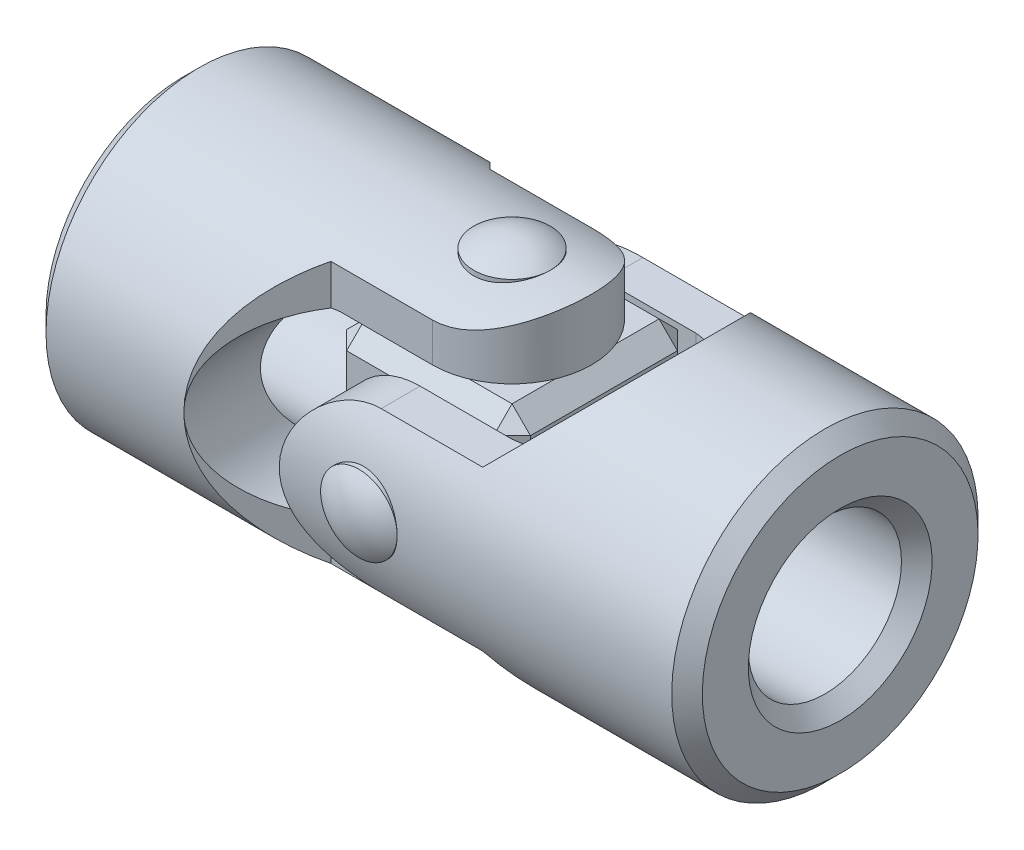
ISO-10303-21;
HEADER;
FILE_DESCRIPTION(('STEP AP214'),'2;1');
FILE_NAME('part.step','',(''),(''),'','','');
FILE_SCHEMA(('AUTOMOTIVE_DESIGN { 1 0 10303 214 1 1 1 1 }'));
ENDSEC;
DATA;
#1=APPLICATION_CONTEXT('core data for automotive mechanical design processes');
#2=APPLICATION_PROTOCOL_DEFINITION('international standard','automotive_design',2000,#1);
#3=PRODUCT_CONTEXT('',#1,'mechanical');
#4=PRODUCT('Part','Part','',(#3));
#5=PRODUCT_RELATED_PRODUCT_CATEGORY('part','',(#4));
#6=PRODUCT_DEFINITION_FORMATION('','',#4);
#7=PRODUCT_DEFINITION_CONTEXT('part definition',#1,'design');
#8=PRODUCT_DEFINITION('design','',#6,#7);
#9=PRODUCT_DEFINITION_SHAPE('','',#8);
#10=(LENGTH_UNIT() NAMED_UNIT(*) SI_UNIT(.MILLI.,.METRE.));
#11=(NAMED_UNIT(*) PLANE_ANGLE_UNIT() SI_UNIT($,.RADIAN.));
#12=(NAMED_UNIT(*) SI_UNIT($,.STERADIAN.) SOLID_ANGLE_UNIT());
#13=UNCERTAINTY_MEASURE_WITH_UNIT(LENGTH_MEASURE(1.E-05),#10,'distance_accuracy_value','');
#14=(GEOMETRIC_REPRESENTATION_CONTEXT(3) GLOBAL_UNCERTAINTY_ASSIGNED_CONTEXT((#13)) GLOBAL_UNIT_ASSIGNED_CONTEXT((#10,
#11,#12)) REPRESENTATION_CONTEXT('',''));
#15=CARTESIAN_POINT('',(0.,0.,0.));
#16=DIRECTION('',(0.,0.,1.));
#17=DIRECTION('',(1.,0.,0.));
#18=AXIS2_PLACEMENT_3D('',#15,#16,#17);
#19=CARTESIAN_POINT('',(0.,14.,0.));
#20=DIRECTION('',(0.,-1.,0.));
#21=DIRECTION('',(-1.,0.,0.));
#22=AXIS2_PLACEMENT_3D('',#19,#20,#21);
#23=CYLINDRICAL_SURFACE('',#22,3.5);
#24=CARTESIAN_POINT('',(0.,14.,0.));
#25=DIRECTION('',(0.,1.,0.));
#26=DIRECTION('',(1.,0.,0.));
#27=AXIS2_PLACEMENT_3D('',#24,#25,#26);
#28=CIRCLE('',#27,3.5);
#29=CARTESIAN_POINT('',(3.5,14.,0.));
#30=VERTEX_POINT('',#29);
#31=EDGE_CURVE('P0_E10',#30,#30,#28,.T.);
#32=ORIENTED_EDGE('',*,*,#31,.F.);
#33=EDGE_LOOP('',(#32));
#34=FACE_BOUND('',#33,.T.);
#35=CARTESIAN_POINT('',(0.,-14.,0.));
#36=DIRECTION('',(0.,-1.,0.));
#37=DIRECTION('',(0.,0.,-1.));
#38=AXIS2_PLACEMENT_3D('',#35,#36,#37);
#39=CIRCLE('',#38,3.5);
#40=CARTESIAN_POINT('',(0.,-14.,-3.5));
#41=VERTEX_POINT('',#40);
#42=EDGE_CURVE('P0_E20',#41,#41,#39,.T.);
#43=ORIENTED_EDGE('',*,*,#42,.F.);
#44=EDGE_LOOP('',(#43));
#45=FACE_BOUND('',#44,.T.);
#46=ADVANCED_FACE('P0_F14',(#34,#45),#23,.T.);
#47=CARTESIAN_POINT('',(0.,9.09125000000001,0.));
#48=DIRECTION('',(0.,-1.,0.));
#49=DIRECTION('',(0.,0.,-1.));
#50=AXIS2_PLACEMENT_3D('',#47,#48,#49);
#51=SPHERICAL_SURFACE('',#50,6.02874999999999);
#52=ORIENTED_EDGE('',*,*,#31,.T.);
#53=EDGE_LOOP('',(#52));
#54=FACE_BOUND('',#53,.T.);
#55=ADVANCED_FACE('P0_F29',(#54),#51,.T.);
#56=CARTESIAN_POINT('',(0.,-9.09125000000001,0.));
#57=DIRECTION('',(0.,1.,0.));
#58=DIRECTION('',(0.,0.,-1.));
#59=AXIS2_PLACEMENT_3D('',#56,#57,#58);
#60=SPHERICAL_SURFACE('',#59,6.02874999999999);
#61=ORIENTED_EDGE('',*,*,#42,.T.);
#62=EDGE_LOOP('',(#61));
#63=FACE_BOUND('',#62,.T.);
#64=ADVANCED_FACE('P0_F26',(#63),#60,.T.);
#65=CLOSED_SHELL('',(#46,#55,#64));
#66=MANIFOLD_SOLID_BREP('P0_B1',#65);
#67=CARTESIAN_POINT('',(0.,0.,14.));
#68=DIRECTION('',(0.,0.,-1.));
#69=DIRECTION('',(-1.,0.,0.));
#70=AXIS2_PLACEMENT_3D('',#67,#68,#69);
#71=CYLINDRICAL_SURFACE('',#70,3.5);
#72=CARTESIAN_POINT('',(0.,0.,14.));
#73=DIRECTION('',(0.,0.,1.));
#74=DIRECTION('',(1.,0.,0.));
#75=AXIS2_PLACEMENT_3D('',#72,#73,#74);
#76=CIRCLE('',#75,3.5);
#77=CARTESIAN_POINT('',(3.5,0.,14.));
#78=VERTEX_POINT('',#77);
#79=EDGE_CURVE('P1_E10',#78,#78,#76,.T.);
#80=ORIENTED_EDGE('',*,*,#79,.F.);
#81=EDGE_LOOP('',(#80));
#82=FACE_BOUND('',#81,.T.);
#83=CARTESIAN_POINT('',(0.,0.,-14.));
#84=DIRECTION('',(0.,0.,-1.));
#85=DIRECTION('',(0.,1.,0.));
#86=AXIS2_PLACEMENT_3D('',#83,#84,#85);
#87=CIRCLE('',#86,3.5);
#88=CARTESIAN_POINT('',(0.,3.5,-14.));
#89=VERTEX_POINT('',#88);
#90=EDGE_CURVE('P1_E20',#89,#89,#87,.T.);
#91=ORIENTED_EDGE('',*,*,#90,.F.);
#92=EDGE_LOOP('',(#91));
#93=FACE_BOUND('',#92,.T.);
#94=ADVANCED_FACE('P1_F14',(#82,#93),#71,.T.);
#95=CARTESIAN_POINT('',(0.,0.,9.09125000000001));
#96=DIRECTION('',(0.,0.,-1.));
#97=DIRECTION('',(0.,1.,0.));
#98=AXIS2_PLACEMENT_3D('',#95,#96,#97);
#99=SPHERICAL_SURFACE('',#98,6.02874999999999);
#100=ORIENTED_EDGE('',*,*,#79,.T.);
#101=EDGE_LOOP('',(#100));
#102=FACE_BOUND('',#101,.T.);
#103=ADVANCED_FACE('P1_F29',(#102),#99,.T.);
#104=CARTESIAN_POINT('',(0.,0.,-9.09125000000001));
#105=DIRECTION('',(0.,0.,1.));
#106=DIRECTION('',(0.,1.,0.));
#107=AXIS2_PLACEMENT_3D('',#104,#105,#106);
#108=SPHERICAL_SURFACE('',#107,6.02874999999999);
#109=ORIENTED_EDGE('',*,*,#90,.T.);
#110=EDGE_LOOP('',(#109));
#111=FACE_BOUND('',#110,.T.);
#112=ADVANCED_FACE('P1_F26',(#111),#108,.T.);
#113=CLOSED_SHELL('',(#94,#103,#112));
#114=MANIFOLD_SOLID_BREP('P1_B1',#113);
#115=CARTESIAN_POINT('',(0.,-14.,-7.28));
#116=DIRECTION('',(0.,0.,1.));
#117=DIRECTION('',(1.,0.,0.));
#118=AXIS2_PLACEMENT_3D('',#115,#116,#117);
#119=PLANE('',#118);
#120=DIRECTION('',(0.,1.,0.));
#121=VECTOR('',#120,1.);
#122=CARTESIAN_POINT('',(0.,-14.,-7.28));
#123=LINE('',#122,#121);
#124=CARTESIAN_POINT('',(0.,8.4,-7.28));
#125=VERTEX_POINT('',#124);
#126=CARTESIAN_POINT('',(0.,11.9583276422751,-7.28));
#127=VERTEX_POINT('',#126);
#128=EDGE_CURVE('P2_E282',#125,#127,#123,.T.);
#129=ORIENTED_EDGE('',*,*,#128,.F.);
#130=DIRECTION('',(-1.,0.,0.));
#131=VECTOR('',#130,1.);
#132=CARTESIAN_POINT('',(0.,8.4,-7.28));
#133=LINE('',#132,#131);
#134=CARTESIAN_POINT('',(-8.4,8.4,-7.28));
#135=VERTEX_POINT('',#134);
#136=EDGE_CURVE('P2_E132',#125,#135,#133,.T.);
#137=ORIENTED_EDGE('',*,*,#136,.T.);
#138=CARTESIAN_POINT('',(-7.55789473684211,0.,-7.28));
#139=DIRECTION('',(0.,0.,1.));
#140=DIRECTION('',(1.,0.,0.));
#141=AXIS2_PLACEMENT_3D('',#138,#139,#140);
#142=CIRCLE('',#141,8.4421052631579);
#143=CARTESIAN_POINT('',(-9.28000000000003,8.26459283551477,-7.28));
#144=VERTEX_POINT('',#143);
#145=EDGE_CURVE('P2_E146',#135,#144,#142,.T.);
#146=ORIENTED_EDGE('',*,*,#145,.T.);
#147=DIRECTION('',(0.,1.,0.));
#148=VECTOR('',#147,1.);
#149=CARTESIAN_POINT('',(-9.28000000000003,-14.,-7.28));
#150=LINE('',#149,#148);
#151=CARTESIAN_POINT('',(-9.28000000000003,11.9583276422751,-7.28));
#152=VERTEX_POINT('',#151);
#153=EDGE_CURVE('P2_E289',#144,#152,#150,.T.);
#154=ORIENTED_EDGE('',*,*,#153,.T.);
#155=DIRECTION('',(1.,0.,0.));
#156=VECTOR('',#155,1.);
#157=CARTESIAN_POINT('',(-30.,11.9583276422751,-7.28));
#158=LINE('',#157,#156);
#159=EDGE_CURVE('P2_E227',#127,#152,#158,.F.);
#160=ORIENTED_EDGE('',*,*,#159,.F.);
#161=EDGE_LOOP('',(#129,#137,#146,#154,#160));
#162=FACE_BOUND('',#161,.T.);
#163=ADVANCED_FACE('P2_F16',(#162),#119,.F.);
#164=CARTESIAN_POINT('',(-9.28000000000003,-14.,-7.28));
#165=DIRECTION('',(-0.707106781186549,0.,0.707106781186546));
#166=DIRECTION('',(0.707106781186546,0.,0.707106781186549));
#167=AXIS2_PLACEMENT_3D('',#164,#165,#166);
#168=PLANE('',#167);
#169=CARTESIAN_POINT('',(-2.00000000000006,0.,0.));
#170=DIRECTION('',(-0.707106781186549,0.,0.707106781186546));
#171=DIRECTION('',(0.707106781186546,0.,0.707106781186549));
#172=AXIS2_PLACEMENT_3D('',#169,#170,#171);
#173=ELLIPSE('',#172,19.7989898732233,14.);
#174=CARTESIAN_POINT('',(-16.,0.,-14.));
#175=VERTEX_POINT('',#174);
#176=CARTESIAN_POINT('',(-9.28000000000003,-11.9583276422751,-7.28));
#177=VERTEX_POINT('',#176);
#178=EDGE_CURVE('P2_E230',#175,#177,#173,.T.);
#179=ORIENTED_EDGE('',*,*,#178,.F.);
#180=CARTESIAN_POINT('',(-7.55789473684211,0.,-5.55789473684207));
#181=DIRECTION('',(-0.707106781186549,0.,0.707106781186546));
#182=DIRECTION('',(-0.707106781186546,0.,-0.707106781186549));
#183=AXIS2_PLACEMENT_3D('',#180,#181,#182);
#184=ELLIPSE('',#183,11.9389397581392,8.4421052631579);
#185=CARTESIAN_POINT('',(-9.28000000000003,-8.26459283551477,-7.28));
#186=VERTEX_POINT('',#185);
#187=EDGE_CURVE('P2_E143',#175,#186,#184,.T.);
#188=ORIENTED_EDGE('',*,*,#187,.T.);
#189=EDGE_CURVE('P2_E286',#177,#186,#150,.T.);
#190=ORIENTED_EDGE('',*,*,#189,.F.);
#191=EDGE_LOOP('',(#179,#188,#190));
#192=FACE_BOUND('',#191,.T.);
#193=ADVANCED_FACE('P2_F181',(#192),#168,.F.);
#194=CARTESIAN_POINT('',(-9.28000000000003,-14.,7.28));
#195=DIRECTION('',(-0.707106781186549,0.,-0.707106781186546));
#196=DIRECTION('',(-0.707106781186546,0.,0.707106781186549));
#197=AXIS2_PLACEMENT_3D('',#194,#195,#196);
#198=PLANE('',#197);
#199=DIRECTION('',(0.,1.,0.));
#200=VECTOR('',#199,1.);
#201=CARTESIAN_POINT('',(-9.28000000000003,-14.,7.28));
#202=LINE('',#201,#200);
#203=CARTESIAN_POINT('',(-9.28000000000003,-11.9583276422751,7.28));
#204=VERTEX_POINT('',#203);
#205=CARTESIAN_POINT('',(-9.28000000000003,-8.26459283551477,7.28));
#206=VERTEX_POINT('',#205);
#207=EDGE_CURVE('P2_E39',#204,#206,#202,.T.);
#208=ORIENTED_EDGE('',*,*,#207,.T.);
#209=CARTESIAN_POINT('',(-7.55789473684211,0.,5.55789473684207));
#210=DIRECTION('',(-0.707106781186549,0.,-0.707106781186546));
#211=DIRECTION('',(0.707106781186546,0.,-0.707106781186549));
#212=AXIS2_PLACEMENT_3D('',#209,#210,#211);
#213=ELLIPSE('',#212,11.9389397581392,8.4421052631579);
#214=CARTESIAN_POINT('',(-16.,0.,14.));
#215=VERTEX_POINT('',#214);
#216=EDGE_CURVE('P2_E107',#206,#215,#213,.T.);
#217=ORIENTED_EDGE('',*,*,#216,.T.);
#218=CARTESIAN_POINT('',(-2.00000000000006,0.,0.));
#219=DIRECTION('',(-0.707106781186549,0.,-0.707106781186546));
#220=DIRECTION('',(0.707106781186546,0.,-0.707106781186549));
#221=AXIS2_PLACEMENT_3D('',#218,#219,#220);
#222=ELLIPSE('',#221,19.7989898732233,14.);
#223=EDGE_CURVE('P2_E241',#204,#215,#222,.T.);
#224=ORIENTED_EDGE('',*,*,#223,.F.);
#225=EDGE_LOOP('',(#208,#217,#224));
#226=FACE_BOUND('',#225,.T.);
#227=ADVANCED_FACE('P2_F185',(#226),#198,.F.);
#228=CARTESIAN_POINT('',(0.,-14.,7.28));
#229=DIRECTION('',(0.,0.,-1.));
#230=DIRECTION('',(-1.,0.,0.));
#231=AXIS2_PLACEMENT_3D('',#228,#229,#230);
#232=PLANE('',#231);
#233=CARTESIAN_POINT('',(-7.55789473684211,0.,7.28));
#234=DIRECTION('',(0.,0.,-1.));
#235=DIRECTION('',(-1.,0.,0.));
#236=AXIS2_PLACEMENT_3D('',#233,#234,#235);
#237=CIRCLE('',#236,8.4421052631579);
#238=CARTESIAN_POINT('',(-9.28000000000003,8.26459283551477,7.28));
#239=VERTEX_POINT('',#238);
#240=CARTESIAN_POINT('',(-8.4,8.4,7.28));
#241=VERTEX_POINT('',#240);
#242=EDGE_CURVE('P2_E108',#239,#241,#237,.T.);
#243=ORIENTED_EDGE('',*,*,#242,.T.);
#244=DIRECTION('',(1.,0.,0.));
#245=VECTOR('',#244,1.);
#246=CARTESIAN_POINT('',(0.,8.4,7.28));
#247=LINE('',#246,#245);
#248=CARTESIAN_POINT('',(0.,8.4,7.28));
#249=VERTEX_POINT('',#248);
#250=EDGE_CURVE('P2_E129',#241,#249,#247,.T.);
#251=ORIENTED_EDGE('',*,*,#250,.T.);
#252=DIRECTION('',(0.,1.,0.));
#253=VECTOR('',#252,1.);
#254=CARTESIAN_POINT('',(0.,-14.,7.28));
#255=LINE('',#254,#253);
#256=CARTESIAN_POINT('',(0.,11.9583276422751,7.28));
#257=VERTEX_POINT('',#256);
#258=EDGE_CURVE('P2_E154',#249,#257,#255,.T.);
#259=ORIENTED_EDGE('',*,*,#258,.T.);
#260=DIRECTION('',(1.,0.,0.));
#261=VECTOR('',#260,1.);
#262=CARTESIAN_POINT('',(-30.,11.9583276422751,7.28));
#263=LINE('',#262,#261);
#264=CARTESIAN_POINT('',(-9.28000000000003,11.9583276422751,7.28));
#265=VERTEX_POINT('',#264);
#266=EDGE_CURVE('P2_E244',#265,#257,#263,.T.);
#267=ORIENTED_EDGE('',*,*,#266,.F.);
#268=EDGE_CURVE('P2_E292',#239,#265,#202,.T.);
#269=ORIENTED_EDGE('',*,*,#268,.F.);
#270=EDGE_LOOP('',(#243,#251,#259,#267,#269));
#271=FACE_BOUND('',#270,.T.);
#272=ADVANCED_FACE('P2_F188',(#271),#232,.F.);
#273=CARTESIAN_POINT('',(0.,-14.,0.));
#274=DIRECTION('',(0.,1.,0.));
#275=DIRECTION('',(0.,0.,-1.));
#276=AXIS2_PLACEMENT_3D('',#273,#274,#275);
#277=CYLINDRICAL_SURFACE('',#276,7.28);
#278=ORIENTED_EDGE('',*,*,#258,.F.);
#279=CARTESIAN_POINT('',(0.,8.4,0.));
#280=DIRECTION('',(0.,1.,0.));
#281=DIRECTION('',(1.,0.,0.));
#282=AXIS2_PLACEMENT_3D('',#279,#280,#281);
#283=CIRCLE('',#282,7.28);
#284=EDGE_CURVE('P2_E109',#249,#125,#283,.T.);
#285=ORIENTED_EDGE('',*,*,#284,.T.);
#286=ORIENTED_EDGE('',*,*,#128,.T.);
#287=CARTESIAN_POINT('',(0.,11.9583276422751,7.28));
#288=CARTESIAN_POINT('',(0.189455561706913,11.9582667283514,7.28003707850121));
#289=CARTESIAN_POINT('',(0.378881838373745,11.9628280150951,7.27260618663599));
#290=CARTESIAN_POINT('',(0.756047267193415,11.9807402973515,7.24309345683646));
#291=CARTESIAN_POINT('',(0.943787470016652,11.994085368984,7.22102149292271));
#292=CARTESIAN_POINT('',(1.31506735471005,12.0290040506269,7.16269067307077));
#293=CARTESIAN_POINT('',(1.49862575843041,12.0505265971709,7.12651982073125));
#294=CARTESIAN_POINT('',(1.86146271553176,12.1010074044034,7.04046311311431));
#295=CARTESIAN_POINT('',(2.04074071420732,12.1299666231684,6.99057549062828));
#296=CARTESIAN_POINT('',(2.39343287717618,12.1942660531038,6.87779517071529));
#297=CARTESIAN_POINT('',(2.56686135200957,12.2295891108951,6.81493736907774));
#298=CARTESIAN_POINT('',(2.90748602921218,12.3055872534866,6.6767311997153));
#299=CARTESIAN_POINT('',(3.07467981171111,12.3462643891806,6.60137804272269));
#300=CARTESIAN_POINT('',(3.56610336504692,12.4747232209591,6.35728938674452));
#301=CARTESIAN_POINT('',(3.8799251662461,12.5688840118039,6.17060560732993));
#302=CARTESIAN_POINT('',(4.50109569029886,12.7737134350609,5.73540708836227));
#303=CARTESIAN_POINT('',(4.80538838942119,12.8851054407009,5.48287080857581));
#304=CARTESIAN_POINT('',(5.2283559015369,13.050690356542,5.06967684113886));
#305=CARTESIAN_POINT('',(5.36382540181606,13.1056617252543,4.92613412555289));
#306=CARTESIAN_POINT('',(5.62300997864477,13.2138548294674,4.62808213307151));
#307=CARTESIAN_POINT('',(5.74672329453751,13.267076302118,4.47357121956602));
#308=CARTESIAN_POINT('',(5.99038152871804,13.3743569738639,4.14235538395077));
#309=CARTESIAN_POINT('',(6.10935056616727,13.4281804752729,3.964854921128));
#310=CARTESIAN_POINT('',(6.3317306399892,13.5308050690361,3.5990791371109));
#311=CARTESIAN_POINT('',(6.43514834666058,13.5796083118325,3.41080848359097));
#312=CARTESIAN_POINT('',(6.62542609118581,13.6708046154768,3.02463985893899));
#313=CARTESIAN_POINT('',(6.71229050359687,13.713199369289,2.82674444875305));
#314=CARTESIAN_POINT('',(6.86846479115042,13.79031521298,2.42270177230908));
#315=CARTESIAN_POINT('',(6.93777671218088,13.8250371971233,2.21655547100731));
#316=CARTESIAN_POINT('',(7.05335454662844,13.8834116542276,1.81359575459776));
#317=CARTESIAN_POINT('',(7.10097059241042,13.9077043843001,1.61726195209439));
#318=CARTESIAN_POINT('',(7.17981086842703,13.948122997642,1.22049788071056));
#319=CARTESIAN_POINT('',(7.21103585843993,13.9642492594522,1.02006780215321));
#320=CARTESIAN_POINT('',(7.25664965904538,13.987858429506,0.616903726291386));
#321=CARTESIAN_POINT('',(7.2710475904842,13.9953460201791,0.414171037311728));
#322=CARTESIAN_POINT('',(7.28282821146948,14.0014698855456,0.00808379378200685));
#323=CARTESIAN_POINT('',(7.2802120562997,14.0001067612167,-0.195270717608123));
#324=CARTESIAN_POINT('',(7.25905610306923,13.9891182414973,-0.58167507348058));
#325=CARTESIAN_POINT('',(7.24203939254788,13.9802831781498,-0.764833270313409));
#326=CARTESIAN_POINT('',(7.19427725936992,13.9556012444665,-1.12893586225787));
#327=CARTESIAN_POINT('',(7.16352722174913,13.9397520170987,-1.30987949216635));
#328=CARTESIAN_POINT('',(7.08865613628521,13.901424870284,-1.66818523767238));
#329=CARTESIAN_POINT('',(7.0445400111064,13.878949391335,-1.84554864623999));
#330=CARTESIAN_POINT('',(6.94337717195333,13.8278769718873,-2.1957101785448));
#331=CARTESIAN_POINT('',(6.88632542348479,13.7992776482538,-2.36850649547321));
#332=CARTESIAN_POINT('',(6.75905507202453,13.7362050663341,-2.71058752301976));
#333=CARTESIAN_POINT('',(6.68868199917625,13.7016633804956,-2.87980213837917));
#334=CARTESIAN_POINT('',(6.53585394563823,13.6277118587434,-3.21160566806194));
#335=CARTESIAN_POINT('',(6.45339490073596,13.5883003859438,-3.37419232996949));
#336=CARTESIAN_POINT('',(6.18885196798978,13.4639938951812,-3.85076934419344));
#337=CARTESIAN_POINT('',(5.9895267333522,13.3729882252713,-4.15377786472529));
#338=CARTESIAN_POINT('',(5.52787648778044,13.1723802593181,-4.75376577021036));
#339=CARTESIAN_POINT('',(5.26124639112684,13.0618283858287,-5.0471168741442));
#340=CARTESIAN_POINT('',(4.82862100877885,12.8957150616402,-5.45178331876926));
#341=CARTESIAN_POINT('',(4.6788234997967,12.840248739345,-5.58087413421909));
#342=CARTESIAN_POINT('',(4.36887226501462,12.7305783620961,-5.8267023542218));
#343=CARTESIAN_POINT('',(4.20871681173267,12.6763745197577,-5.94343768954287));
#344=CARTESIAN_POINT('',(3.86660421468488,12.5667844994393,-6.17196598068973));
#345=CARTESIAN_POINT('',(3.68391044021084,12.5116064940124,-6.28275771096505));
#346=CARTESIAN_POINT('',(3.30844484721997,12.4062471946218,-6.48832554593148));
#347=CARTESIAN_POINT('',(3.1156777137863,12.356063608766,-6.58310901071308));
#348=CARTESIAN_POINT('',(2.7214975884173,12.2626084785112,-6.75559349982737));
#349=CARTESIAN_POINT('',(2.52010250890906,12.2193234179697,-6.83332804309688));
#350=CARTESIAN_POINT('',(2.10973209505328,12.1413368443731,-6.97095504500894));
#351=CARTESIAN_POINT('',(1.90076004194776,12.1066316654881,-7.03085512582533));
#352=CARTESIAN_POINT('',(1.55170178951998,12.0578145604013,-7.11410796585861));
#353=CARTESIAN_POINT('',(1.41329812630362,12.0407557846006,-7.1429007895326));
#354=CARTESIAN_POINT('',(1.13459770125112,12.011233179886,-7.19243411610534));
#355=CARTESIAN_POINT('',(0.99430147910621,11.9987680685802,-7.2131768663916));
#356=CARTESIAN_POINT('',(0.712043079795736,11.9786799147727,-7.24649077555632));
#357=CARTESIAN_POINT('',(0.570077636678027,11.9710689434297,-7.25904156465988));
#358=CARTESIAN_POINT('',(0.285411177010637,11.9608816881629,-7.2758041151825));
#359=CARTESIAN_POINT('',(0.142709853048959,11.9583077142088,-7.28001205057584));
#360=CARTESIAN_POINT('',(0.,11.9583276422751,-7.28));
#361=B_SPLINE_CURVE_WITH_KNOTS('',3,(#287,#288,#289,#290,#291,#292,#293,#294,#295,#296,#297,
#298,#299,#300,#301,#302,#303,#304,#305,#306,#307,#308,#309,#310,#311,#312,#313,#314,#315,#316,
#317,#318,#319,#320,#321,#322,#323,#324,#325,#326,#327,#328,#329,#330,#331,#332,#333,#334,#335,
#336,#337,#338,#339,#340,#341,#342,#343,#344,#345,#346,#347,#348,#349,#350,#351,#352,#353,#354,
#355,#356,#357,#358,#359,#360),.UNSPECIFIED.,.F.,.F.,(4,2,2,2,2,2,2,2,2,2,2,2,2,2,2,2,2,2,2,2,2,
2,2,2,2,2,2,2,2,2,2,2,2,2,2,2,4),(0.,0.568119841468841,1.13585692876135,1.70010559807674,
2.26442699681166,2.82724945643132,3.39028813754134,4.51715867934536,5.74421466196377,
6.35835263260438,6.97258243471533,7.63280689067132,8.29274734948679,8.95251316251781,
9.6122020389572,10.2218082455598,10.8313861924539,11.4406335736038,12.0498395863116,
12.6016633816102,13.1536727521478,13.7054790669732,14.2575005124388,14.8163657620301,
15.3754193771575,16.4928787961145,17.7220050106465,18.3376235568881,18.9533450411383,
19.6145258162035,20.2754017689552,20.9349665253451,21.5942489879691,22.0211451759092,
22.4479220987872,22.8757562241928,23.3037865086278),.UNSPECIFIED.);
#362=EDGE_CURVE('P2_E203',#257,#127,#361,.T.);
#363=ORIENTED_EDGE('',*,*,#362,.F.);
#364=EDGE_LOOP('',(#278,#285,#286,#363));
#365=FACE_BOUND('',#364,.T.);
#366=ADVANCED_FACE('P2_F192',(#365),#277,.T.);
#367=CARTESIAN_POINT('',(-30.,0.,0.));
#368=DIRECTION('',(-1.,0.,0.));
#369=DIRECTION('',(0.,0.,1.));
#370=AXIS2_PLACEMENT_3D('',#367,#368,#369);
#371=PLANE('',#370);
#372=CARTESIAN_POINT('',(-30.,0.,0.));
#373=DIRECTION('',(-1.,0.,0.));
#374=DIRECTION('',(0.,0.,1.));
#375=AXIS2_PLACEMENT_3D('',#372,#373,#374);
#376=CIRCLE('',#375,8.4);
#377=CARTESIAN_POINT('',(-30.,0.,8.40000000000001));
#378=VERTEX_POINT('',#377);
#379=EDGE_CURVE('P2_E24',#378,#378,#376,.F.);
#380=ORIENTED_EDGE('',*,*,#379,.T.);
#381=EDGE_LOOP('',(#380));
#382=FACE_BOUND('',#381,.T.);
#383=CARTESIAN_POINT('',(-30.,0.,0.));
#384=DIRECTION('',(-1.,0.,0.));
#385=DIRECTION('',(0.,0.,1.));
#386=AXIS2_PLACEMENT_3D('',#383,#384,#385);
#387=CIRCLE('',#386,12.6);
#388=CARTESIAN_POINT('',(-30.,0.,12.6));
#389=VERTEX_POINT('',#388);
#390=EDGE_CURVE('P2_E254',#389,#389,#387,.T.);
#391=ORIENTED_EDGE('',*,*,#390,.T.);
#392=EDGE_LOOP('',(#391));
#393=FACE_BOUND('',#392,.T.);
#394=ADVANCED_FACE('P2_F213',(#382,#393),#371,.T.);
#395=CARTESIAN_POINT('',(-30.,0.,0.));
#396=DIRECTION('',(1.,0.,0.));
#397=DIRECTION('',(0.,0.,-1.));
#398=AXIS2_PLACEMENT_3D('',#395,#396,#397);
#399=CYLINDRICAL_SURFACE('',#398,14.);
#400=CARTESIAN_POINT('',(-28.6,0.,0.));
#401=DIRECTION('',(-1.,0.,0.));
#402=DIRECTION('',(0.,0.,1.));
#403=AXIS2_PLACEMENT_3D('',#400,#401,#402);
#404=CIRCLE('',#403,14.);
#405=CARTESIAN_POINT('',(-28.6,0.,14.));
#406=VERTEX_POINT('',#405);
#407=EDGE_CURVE('P2_E11',#406,#406,#404,.F.);
#408=ORIENTED_EDGE('',*,*,#407,.T.);
#409=EDGE_LOOP('',(#408));
#410=FACE_BOUND('',#409,.T.);
#411=CARTESIAN_POINT('',(3.5,-14.,0.));
#412=CARTESIAN_POINT('',(3.49999457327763,-13.9999967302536,-0.193377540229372));
#413=CARTESIAN_POINT('',(3.48391971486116,-13.9959534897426,-0.386815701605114));
#414=CARTESIAN_POINT('',(3.42014131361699,-13.9802159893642,-0.76814808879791));
#415=CARTESIAN_POINT('',(3.37241984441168,-13.9685173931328,-0.956039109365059));
#416=CARTESIAN_POINT('',(3.24697507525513,-13.9387646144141,-1.32071536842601));
#417=CARTESIAN_POINT('',(3.1692878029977,-13.9207180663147,-1.49751364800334));
#418=CARTESIAN_POINT('',(2.9862434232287,-13.8801913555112,-1.835568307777));
#419=CARTESIAN_POINT('',(2.88088538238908,-13.8577110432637,-1.99682416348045));
#420=CARTESIAN_POINT('',(2.64319815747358,-13.8102396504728,-2.3025378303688));
#421=CARTESIAN_POINT('',(2.51040632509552,-13.7852098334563,-2.4466299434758));
#422=CARTESIAN_POINT('',(2.22261152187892,-13.7357178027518,-2.71074749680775));
#423=CARTESIAN_POINT('',(2.06760604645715,-13.7112556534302,-2.83077021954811));
#424=CARTESIAN_POINT('',(1.73694447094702,-13.6652780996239,-3.04506193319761));
#425=CARTESIAN_POINT('',(1.56101579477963,-13.6438118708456,-3.13892183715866));
#426=CARTESIAN_POINT('',(1.19525370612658,-13.6068215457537,-3.2955927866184));
#427=CARTESIAN_POINT('',(1.0054225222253,-13.5912964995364,-3.358408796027));
#428=CARTESIAN_POINT('',(0.621265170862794,-13.5683444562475,-3.44996128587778));
#429=CARTESIAN_POINT('',(0.427105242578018,-13.5607614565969,-3.47935529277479));
#430=CARTESIAN_POINT('',(0.036473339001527,-13.5540851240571,-3.50527747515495));
#431=CARTESIAN_POINT('',(-0.15999825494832,-13.554990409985,-3.50181099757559));
#432=CARTESIAN_POINT('',(-0.544636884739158,-13.5650481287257,-3.46263522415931));
#433=CARTESIAN_POINT('',(-0.732889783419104,-13.5740001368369,-3.42770946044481));
#434=CARTESIAN_POINT('',(-1.10077578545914,-13.5988232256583,-3.32785643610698));
#435=CARTESIAN_POINT('',(-1.28040827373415,-13.6146947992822,-3.26292703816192));
#436=CARTESIAN_POINT('',(-1.62805537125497,-13.6517526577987,-3.10424211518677));
#437=CARTESIAN_POINT('',(-1.79593440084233,-13.6729909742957,-3.01020222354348));
#438=CARTESIAN_POINT('',(-2.11381032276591,-13.7183599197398,-2.79616464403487));
#439=CARTESIAN_POINT('',(-2.26380407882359,-13.7424910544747,-2.67616241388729));
#440=CARTESIAN_POINT('',(-2.54614176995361,-13.7917705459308,-2.40954799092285));
#441=CARTESIAN_POINT('',(-2.67786047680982,-13.81692828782,-2.26227460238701));
#442=CARTESIAN_POINT('',(-2.91484956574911,-13.8648058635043,-1.94742780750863));
#443=CARTESIAN_POINT('',(-3.02011913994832,-13.8875256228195,-1.77985378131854));
#444=CARTESIAN_POINT('',(-3.2014513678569,-13.9280804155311,-1.42827040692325));
#445=CARTESIAN_POINT('',(-3.27741246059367,-13.9458984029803,-1.24420658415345));
#446=CARTESIAN_POINT('',(-3.397140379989,-13.9745180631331,-0.865377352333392));
#447=CARTESIAN_POINT('',(-3.44091336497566,-13.9853210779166,-0.670613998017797));
#448=CARTESIAN_POINT('',(-3.49406765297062,-13.9984949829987,-0.281259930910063));
#449=CARTESIAN_POINT('',(-3.50430039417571,-14.0010745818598,-0.0867923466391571));
#450=CARTESIAN_POINT('',(-3.49241899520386,-13.9981054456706,0.301076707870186));
#451=CARTESIAN_POINT('',(-3.47030776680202,-13.9925574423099,0.494478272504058));
#452=CARTESIAN_POINT('',(-3.39506788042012,-13.9740902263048,0.871766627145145));
#453=CARTESIAN_POINT('',(-3.34240371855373,-13.961281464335,1.05575194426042));
#454=CARTESIAN_POINT('',(-3.20808347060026,-13.9297364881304,1.41226701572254));
#455=CARTESIAN_POINT('',(-3.12642445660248,-13.9109996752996,1.58479561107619));
#456=CARTESIAN_POINT('',(-2.93478236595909,-13.8691771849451,1.9168873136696));
#457=CARTESIAN_POINT('',(-2.82432240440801,-13.8460202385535,2.07616603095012));
#458=CARTESIAN_POINT('',(-2.57882354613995,-13.7980385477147,2.37422876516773));
#459=CARTESIAN_POINT('',(-2.44378040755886,-13.7732135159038,2.51300923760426));
#460=CARTESIAN_POINT('',(-2.14899542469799,-13.7239423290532,2.76964465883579));
#461=CARTESIAN_POINT('',(-1.9887286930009,-13.699520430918,2.88690235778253));
#462=CARTESIAN_POINT('',(-1.65029051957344,-13.6545004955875,3.0928584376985));
#463=CARTESIAN_POINT('',(-1.47211987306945,-13.6339022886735,3.18155808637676));
#464=CARTESIAN_POINT('',(-1.1038866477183,-13.5990888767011,3.32721998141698));
#465=CARTESIAN_POINT('',(-0.913902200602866,-13.5848359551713,3.38437025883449));
#466=CARTESIAN_POINT('',(-0.526610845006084,-13.5642906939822,3.46580653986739));
#467=CARTESIAN_POINT('',(-0.329305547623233,-13.5579966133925,3.49009973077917));
#468=CARTESIAN_POINT('',(0.0609490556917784,-13.5542143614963,3.50475671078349));
#469=CARTESIAN_POINT('',(0.253860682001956,-13.5564784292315,3.49607509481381));
#470=CARTESIAN_POINT('',(0.635375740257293,-13.5689845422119,3.44721364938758));
#471=CARTESIAN_POINT('',(0.823979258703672,-13.5792264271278,3.40703445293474));
#472=CARTESIAN_POINT('',(1.19048640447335,-13.6063960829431,3.29683974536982));
#473=CARTESIAN_POINT('',(1.3684470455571,-13.6232836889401,3.22700327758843));
#474=CARTESIAN_POINT('',(1.71025255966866,-13.6618476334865,3.05961813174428));
#475=CARTESIAN_POINT('',(1.87409547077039,-13.6835246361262,2.96206561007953));
#476=CARTESIAN_POINT('',(2.18762746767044,-13.7299314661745,2.73902474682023));
#477=CARTESIAN_POINT('',(2.33683583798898,-13.7547261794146,2.61287404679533));
#478=CARTESIAN_POINT('',(2.6122764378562,-13.8041873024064,2.33750853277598));
#479=CARTESIAN_POINT('',(2.738503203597,-13.8288536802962,2.18828824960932));
#480=CARTESIAN_POINT('',(2.96662638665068,-13.875811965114,1.86775770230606));
#481=CARTESIAN_POINT('',(3.06804076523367,-13.8980527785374,1.69609631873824));
#482=CARTESIAN_POINT('',(3.24041074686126,-13.9371149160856,1.33762080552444));
#483=CARTESIAN_POINT('',(3.31138817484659,-13.9539401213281,1.15081764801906));
#484=CARTESIAN_POINT('',(3.41033427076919,-13.9777880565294,0.803623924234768));
#485=CARTESIAN_POINT('',(3.44388623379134,-13.9860603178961,0.644887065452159));
#486=CARTESIAN_POINT('',(3.48872053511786,-13.9971674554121,0.324114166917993));
#487=CARTESIAN_POINT('',(3.50000454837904,-14.0000027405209,0.162078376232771));
#488=CARTESIAN_POINT('',(3.5,-14.,0.));
#489=B_SPLINE_CURVE_WITH_KNOTS('',3,(#411,#412,#413,#414,#415,#416,#417,#418,#419,#420,#421,
#422,#423,#424,#425,#426,#427,#428,#429,#430,#431,#432,#433,#434,#435,#436,#437,#438,#439,#440,
#441,#442,#443,#444,#445,#446,#447,#448,#449,#450,#451,#452,#453,#454,#455,#456,#457,#458,#459,
#460,#461,#462,#463,#464,#465,#466,#467,#468,#469,#470,#471,#472,#473,#474,#475,#476,#477,#478,
#479,#480,#481,#482,#483,#484,#485,#486,#487,#488),.UNSPECIFIED.,.T.,.F.,(4,2,2,2,2,2,2,2,2,2,2,
2,2,2,2,2,2,2,2,2,2,2,2,2,2,2,2,2,2,2,2,2,2,2,2,2,2,2,4),(0.,0.579538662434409,1.15940588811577,
1.73857810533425,2.3177698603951,2.90767016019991,3.49763702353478,4.09636844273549,
4.69500409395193,5.28164688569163,5.86819422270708,6.44052493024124,7.01289641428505,
7.591045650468,8.16929611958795,8.76403502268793,9.35879208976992,9.95559201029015,
10.5522777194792,11.1336938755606,11.7150576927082,12.287806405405,12.8606129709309,
13.4435837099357,14.0266551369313,14.6240385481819,15.221395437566,15.8151526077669,
16.4087798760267,16.9853548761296,17.5619182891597,18.1350493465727,18.7082599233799,
19.2964234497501,19.884726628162,20.4836843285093,21.0822118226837,21.5679856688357,
22.0537229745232),.UNSPECIFIED.);
#490=CARTESIAN_POINT('',(3.5,-14.,0.));
#491=VERTEX_POINT('',#490);
#492=EDGE_CURVE('P2_E222',#491,#491,#489,.T.);
#493=ORIENTED_EDGE('',*,*,#492,.T.);
#494=EDGE_LOOP('',(#493));
#495=FACE_BOUND('',#494,.T.);
#496=CARTESIAN_POINT('',(0.,13.555441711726,-3.5));
#497=CARTESIAN_POINT('',(0.193271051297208,13.55544540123,-3.4999945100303));
#498=CARTESIAN_POINT('',(0.386602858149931,13.5596202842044,-3.48393674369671));
#499=CARTESIAN_POINT('',(0.767714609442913,13.5758260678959,-3.42023237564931));
#500=CARTESIAN_POINT('',(0.95549125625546,13.5878615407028,-3.37256738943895));
#501=CARTESIAN_POINT('',(1.31992495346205,13.6183421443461,-3.24728767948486));
#502=CARTESIAN_POINT('',(1.49659601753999,13.6367789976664,-3.16971161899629));
#503=CARTESIAN_POINT('',(1.83443519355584,13.6779746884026,-2.98692959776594));
#504=CARTESIAN_POINT('',(1.99560264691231,13.7007337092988,-2.88172246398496));
#505=CARTESIAN_POINT('',(2.3014063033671,13.7485700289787,-2.64419179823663));
#506=CARTESIAN_POINT('',(2.44565104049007,13.7736843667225,-2.51137164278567));
#507=CARTESIAN_POINT('',(2.71006595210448,13.8230802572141,-2.22345488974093));
#508=CARTESIAN_POINT('',(2.83023387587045,13.8473617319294,-2.06835621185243));
#509=CARTESIAN_POINT('',(3.04468565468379,13.8927658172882,-1.73760328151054));
#510=CARTESIAN_POINT('',(3.13858494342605,13.9138396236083,-1.56169240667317));
#511=CARTESIAN_POINT('',(3.29533350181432,13.9500313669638,-1.19596845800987));
#512=CARTESIAN_POINT('',(3.35818735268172,13.9651501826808,-1.00615744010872));
#513=CARTESIAN_POINT('',(3.44980696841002,13.9874666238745,-0.622102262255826));
#514=CARTESIAN_POINT('',(3.47923750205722,13.9948185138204,-0.428025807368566));
#515=CARTESIAN_POINT('',(3.50526173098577,14.0013103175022,-0.0375603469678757));
#516=CARTESIAN_POINT('',(3.50186028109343,14.000451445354,0.1588283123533));
#517=CARTESIAN_POINT('',(3.46279520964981,13.9907333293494,0.543732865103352));
#518=CARTESIAN_POINT('',(3.42784914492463,13.9820520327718,0.73232675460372));
#519=CARTESIAN_POINT('',(3.32784022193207,13.9578717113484,1.10088386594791));
#520=CARTESIAN_POINT('',(3.26277576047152,13.9423723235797,1.28084662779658));
#521=CARTESIAN_POINT('',(3.10379640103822,13.906025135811,1.62892346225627));
#522=CARTESIAN_POINT('',(3.00962613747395,13.8851302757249,1.79691578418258));
#523=CARTESIAN_POINT('',(2.79530204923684,13.8402586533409,2.1149646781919));
#524=CARTESIAN_POINT('',(2.67514370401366,13.8162813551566,2.26501812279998));
#525=CARTESIAN_POINT('',(2.40840776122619,13.767091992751,2.54720912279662));
#526=CARTESIAN_POINT('',(2.26120315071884,13.7418640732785,2.67875187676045));
#527=CARTESIAN_POINT('',(1.94656003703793,13.6936106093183,2.91541731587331));
#528=CARTESIAN_POINT('',(1.77912058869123,13.6705851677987,3.0205387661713));
#529=CARTESIAN_POINT('',(1.42759395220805,13.6292869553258,3.20175845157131));
#530=CARTESIAN_POINT('',(1.24342997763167,13.6110377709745,3.27771348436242));
#531=CARTESIAN_POINT('',(0.864380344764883,13.5816609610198,3.39739967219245));
#532=CARTESIAN_POINT('',(0.669496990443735,13.5705318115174,3.44113772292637));
#533=CARTESIAN_POINT('',(0.28005669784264,13.5569749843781,3.49416149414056));
#534=CARTESIAN_POINT('',(0.0856270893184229,13.5543252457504,3.50432666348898));
#535=CARTESIAN_POINT('',(-0.302150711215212,13.5574228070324,3.49232378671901));
#536=CARTESIAN_POINT('',(-0.495499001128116,13.5631693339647,3.47015871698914));
#537=CARTESIAN_POINT('',(-0.872359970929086,13.5821991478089,3.39489564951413));
#538=CARTESIAN_POINT('',(-1.05598181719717,13.5953575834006,3.34230969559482));
#539=CARTESIAN_POINT('',(-1.41180404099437,13.6276100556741,3.20826531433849));
#540=CARTESIAN_POINT('',(-1.58400306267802,13.6467047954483,3.12680346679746));
#541=CARTESIAN_POINT('',(-1.91581778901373,13.6891459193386,2.93547893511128));
#542=CARTESIAN_POINT('',(-2.07512037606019,13.7125683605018,2.82509045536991));
#543=CARTESIAN_POINT('',(-2.37326370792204,13.7608391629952,2.57971102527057));
#544=CARTESIAN_POINT('',(-2.51210108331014,13.7856877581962,2.44471603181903));
#545=CARTESIAN_POINT('',(-2.7689354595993,13.8347636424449,2.14991952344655));
#546=CARTESIAN_POINT('',(-2.88632408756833,13.8589598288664,1.98958183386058));
#547=CARTESIAN_POINT('',(-3.09251021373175,13.9033610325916,1.65095938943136));
#548=CARTESIAN_POINT('',(-3.18130920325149,13.9235662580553,1.47267557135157));
#549=CARTESIAN_POINT('',(-3.3270244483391,13.9575816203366,1.10445370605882));
#550=CARTESIAN_POINT('',(-3.38416999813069,13.9714376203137,0.914610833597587));
#551=CARTESIAN_POINT('',(-3.46564446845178,13.991394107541,0.527624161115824));
#552=CARTESIAN_POINT('',(-3.48997972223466,13.9974960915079,0.330481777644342));
#553=CARTESIAN_POINT('',(-3.50478656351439,14.0011959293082,-0.0597923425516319));
#554=CARTESIAN_POINT('',(-3.49615598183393,13.9990192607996,-0.252888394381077));
#555=CARTESIAN_POINT('',(-3.44733260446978,13.9869063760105,-0.63478623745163));
#556=CARTESIAN_POINT('',(-3.40714074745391,13.9769703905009,-0.823588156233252));
#557=CARTESIAN_POINT('',(-3.29681723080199,13.9504901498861,-1.19059862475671));
#558=CARTESIAN_POINT('',(-3.22684791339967,13.9339817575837,-1.36885873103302));
#559=CARTESIAN_POINT('',(-3.0591029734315,13.896095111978,-1.71120968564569));
#560=CARTESIAN_POINT('',(-2.9613238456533,13.8747162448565,-1.87529874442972));
#561=CARTESIAN_POINT('',(-2.73799668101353,13.82875373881,-2.18890674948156));
#562=CARTESIAN_POINT('',(-2.61183949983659,13.8041055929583,-2.33798245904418));
#563=CARTESIAN_POINT('',(-2.33652001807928,13.7546727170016,-2.61315257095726));
#564=CARTESIAN_POINT('',(-2.18735189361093,13.7298879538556,-2.73924113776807));
#565=CARTESIAN_POINT('',(-1.86689505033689,13.6824616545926,-2.96716709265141));
#566=CARTESIAN_POINT('',(-1.69524556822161,13.6598687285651,-3.06850816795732));
#567=CARTESIAN_POINT('',(-1.33680578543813,13.620038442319,-3.24074413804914));
#568=CARTESIAN_POINT('',(-1.15002661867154,13.6027971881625,-3.31166118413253));
#569=CARTESIAN_POINT('',(-0.802980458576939,13.5783168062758,-3.41047884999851));
#570=CARTESIAN_POINT('',(-0.644373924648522,13.5698032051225,-3.44397609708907));
#571=CARTESIAN_POINT('',(-0.323858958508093,13.5583643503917,-3.48873802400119));
#572=CARTESIAN_POINT('',(-0.161950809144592,13.5554386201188,-3.50000460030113));
#573=CARTESIAN_POINT('',(0.,13.555441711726,-3.5));
#574=B_SPLINE_CURVE_WITH_KNOTS('',3,(#496,#497,#498,#499,#500,#501,#502,#503,#504,#505,#506,
#507,#508,#509,#510,#511,#512,#513,#514,#515,#516,#517,#518,#519,#520,#521,#522,#523,#524,#525,
#526,#527,#528,#529,#530,#531,#532,#533,#534,#535,#536,#537,#538,#539,#540,#541,#542,#543,#544,
#545,#546,#547,#548,#549,#550,#551,#552,#553,#554,#555,#556,#557,#558,#559,#560,#561,#562,#563,
#564,#565,#566,#567,#568,#569,#570,#571,#572,#573),.UNSPECIFIED.,.T.,.F.,(4,2,2,2,2,2,2,2,2,2,2,
2,2,2,2,2,2,2,2,2,2,2,2,2,2,2,2,2,2,2,2,2,2,2,2,2,2,2,4),(0.,0.579218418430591,1.15877403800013,
1.73758301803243,2.3164165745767,2.90673535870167,3.49710930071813,4.09572094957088,
4.69424423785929,5.28064251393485,5.86695408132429,6.44025567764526,7.013587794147,
7.59210023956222,8.17071339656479,8.76498653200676,9.35928743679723,9.95647004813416,
10.5535248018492,11.1348100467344,11.716041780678,12.2877636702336,12.8595533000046,
13.4425598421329,14.0256622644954,14.6233546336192,15.2210158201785,15.8142890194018,
16.4074476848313,16.9845682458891,17.5616716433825,18.1356682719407,18.7097372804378,
19.2975593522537,19.8855304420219,20.4844706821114,21.0829740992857,21.5683695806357,
22.0537236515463),.UNSPECIFIED.);
#575=CARTESIAN_POINT('',(0.,13.555441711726,-3.5));
#576=VERTEX_POINT('',#575);
#577=EDGE_CURVE('P2_E217',#576,#576,#574,.T.);
#578=ORIENTED_EDGE('',*,*,#577,.T.);
#579=EDGE_LOOP('',(#578));
#580=FACE_BOUND('',#579,.T.);
#581=ORIENTED_EDGE('',*,*,#266,.T.);
#582=ORIENTED_EDGE('',*,*,#362,.T.);
#583=ORIENTED_EDGE('',*,*,#159,.T.);
#584=EDGE_CURVE('P2_E231',#152,#175,#173,.T.);
#585=ORIENTED_EDGE('',*,*,#584,.T.);
#586=ORIENTED_EDGE('',*,*,#178,.T.);
#587=DIRECTION('',(1.,0.,0.));
#588=VECTOR('',#587,1.);
#589=CARTESIAN_POINT('',(-30.,-11.9583276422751,-7.28));
#590=LINE('',#589,#588);
#591=CARTESIAN_POINT('',(0.,-11.9583276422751,-7.28));
#592=VERTEX_POINT('',#591);
#593=EDGE_CURVE('P2_E234',#177,#592,#590,.T.);
#594=ORIENTED_EDGE('',*,*,#593,.T.);
#595=CARTESIAN_POINT('',(0.,-11.9583276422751,-7.28));
#596=CARTESIAN_POINT('',(0.189455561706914,-11.9582667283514,-7.28003707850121));
#597=CARTESIAN_POINT('',(0.378881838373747,-11.9628280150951,-7.27260618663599));
#598=CARTESIAN_POINT('',(0.756047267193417,-11.9807402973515,-7.24309345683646));
#599=CARTESIAN_POINT('',(0.943787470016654,-11.994085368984,-7.22102149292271));
#600=CARTESIAN_POINT('',(1.31506735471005,-12.0290040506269,-7.16269067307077));
#601=CARTESIAN_POINT('',(1.49862575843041,-12.0505265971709,-7.12651982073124));
#602=CARTESIAN_POINT('',(1.86146271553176,-12.1010074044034,-7.04046311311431));
#603=CARTESIAN_POINT('',(2.04074071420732,-12.1299666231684,-6.99057549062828));
#604=CARTESIAN_POINT('',(2.39343287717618,-12.1942660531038,-6.87779517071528));
#605=CARTESIAN_POINT('',(2.56686135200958,-12.2295891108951,-6.81493736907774));
#606=CARTESIAN_POINT('',(2.90748602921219,-12.3055872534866,-6.6767311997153));
#607=CARTESIAN_POINT('',(3.07467981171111,-12.3462643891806,-6.60137804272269));
#608=CARTESIAN_POINT('',(3.56610336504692,-12.4747232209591,-6.35728938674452));
#609=CARTESIAN_POINT('',(3.8799251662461,-12.5688840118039,-6.17060560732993));
#610=CARTESIAN_POINT('',(4.50109569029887,-12.7737134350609,-5.73540708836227));
#611=CARTESIAN_POINT('',(4.80538838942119,-12.8851054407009,-5.4828708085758));
#612=CARTESIAN_POINT('',(5.2283559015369,-13.050690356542,-5.06967684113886));
#613=CARTESIAN_POINT('',(5.36382540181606,-13.1056617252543,-4.92613412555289));
#614=CARTESIAN_POINT('',(5.62300997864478,-13.2138548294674,-4.62808213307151));
#615=CARTESIAN_POINT('',(5.74672329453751,-13.267076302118,-4.47357121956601));
#616=CARTESIAN_POINT('',(5.99038152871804,-13.3743569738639,-4.14235538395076));
#617=CARTESIAN_POINT('',(6.10935056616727,-13.4281804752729,-3.964854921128));
#618=CARTESIAN_POINT('',(6.3317306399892,-13.5308050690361,-3.5990791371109));
#619=CARTESIAN_POINT('',(6.43514834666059,-13.5796083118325,-3.41080848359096));
#620=CARTESIAN_POINT('',(6.62542609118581,-13.6708046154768,-3.02463985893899));
#621=CARTESIAN_POINT('',(6.71229050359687,-13.713199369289,-2.82674444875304));
#622=CARTESIAN_POINT('',(6.86846479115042,-13.79031521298,-2.42270177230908));
#623=CARTESIAN_POINT('',(6.93777671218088,-13.8250371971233,-2.21655547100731));
#624=CARTESIAN_POINT('',(7.05335454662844,-13.8834116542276,-1.81359575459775));
#625=CARTESIAN_POINT('',(7.10097059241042,-13.9077043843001,-1.61726195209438));
#626=CARTESIAN_POINT('',(7.17981086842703,-13.948122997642,-1.22049788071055));
#627=CARTESIAN_POINT('',(7.21103585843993,-13.9642492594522,-1.02006780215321));
#628=CARTESIAN_POINT('',(7.25664965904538,-13.987858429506,-0.616903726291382));
#629=CARTESIAN_POINT('',(7.2710475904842,-13.9953460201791,-0.414171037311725));
#630=CARTESIAN_POINT('',(7.28282821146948,-14.0014698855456,-0.00808379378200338));
#631=CARTESIAN_POINT('',(7.2802120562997,-14.0001067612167,0.195270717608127));
#632=CARTESIAN_POINT('',(7.25905610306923,-13.9891182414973,0.581675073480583));
#633=CARTESIAN_POINT('',(7.24203939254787,-13.9802831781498,0.764833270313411));
#634=CARTESIAN_POINT('',(7.19427725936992,-13.9556012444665,1.12893586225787));
#635=CARTESIAN_POINT('',(7.16352722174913,-13.9397520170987,1.30987949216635));
#636=CARTESIAN_POINT('',(7.08865613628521,-13.901424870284,1.66818523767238));
#637=CARTESIAN_POINT('',(7.0445400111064,-13.878949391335,1.84554864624));
#638=CARTESIAN_POINT('',(6.94337717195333,-13.8278769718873,2.1957101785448));
#639=CARTESIAN_POINT('',(6.88632542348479,-13.7992776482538,2.36850649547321));
#640=CARTESIAN_POINT('',(6.75905507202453,-13.7362050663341,2.71058752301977));
#641=CARTESIAN_POINT('',(6.68868199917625,-13.7016633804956,2.87980213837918));
#642=CARTESIAN_POINT('',(6.53585394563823,-13.6277118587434,3.21160566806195));
#643=CARTESIAN_POINT('',(6.45339490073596,-13.5883003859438,3.37419232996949));
#644=CARTESIAN_POINT('',(6.18885196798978,-13.4639938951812,3.85076934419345));
#645=CARTESIAN_POINT('',(5.98952673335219,-13.3729882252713,4.15377786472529));
#646=CARTESIAN_POINT('',(5.52787648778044,-13.1723802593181,4.75376577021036));
#647=CARTESIAN_POINT('',(5.26124639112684,-13.0618283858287,5.04711687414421));
#648=CARTESIAN_POINT('',(4.82862100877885,-12.8957150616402,5.45178331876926));
#649=CARTESIAN_POINT('',(4.6788234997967,-12.840248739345,5.58087413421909));
#650=CARTESIAN_POINT('',(4.36887226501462,-12.7305783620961,5.8267023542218));
#651=CARTESIAN_POINT('',(4.20871681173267,-12.6763745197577,5.94343768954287));
#652=CARTESIAN_POINT('',(3.86660421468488,-12.5667844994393,6.17196598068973));
#653=CARTESIAN_POINT('',(3.68391044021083,-12.5116064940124,6.28275771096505));
#654=CARTESIAN_POINT('',(3.30844484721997,-12.4062471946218,6.48832554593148));
#655=CARTESIAN_POINT('',(3.1156777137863,-12.356063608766,6.58310901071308));
#656=CARTESIAN_POINT('',(2.7214975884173,-12.2626084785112,6.75559349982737));
#657=CARTESIAN_POINT('',(2.52010250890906,-12.2193234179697,6.83332804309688));
#658=CARTESIAN_POINT('',(2.10973209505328,-12.1413368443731,6.97095504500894));
#659=CARTESIAN_POINT('',(1.90076004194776,-12.1066316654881,7.03085512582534));
#660=CARTESIAN_POINT('',(1.55170178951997,-12.0578145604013,7.11410796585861));
#661=CARTESIAN_POINT('',(1.41329812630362,-12.0407557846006,7.1429007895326));
#662=CARTESIAN_POINT('',(1.13459770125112,-12.011233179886,7.19243411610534));
#663=CARTESIAN_POINT('',(0.994301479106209,-11.9987680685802,7.2131768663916));
#664=CARTESIAN_POINT('',(0.712043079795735,-11.9786799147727,7.24649077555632));
#665=CARTESIAN_POINT('',(0.570077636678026,-11.9710689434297,7.25904156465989));
#666=CARTESIAN_POINT('',(0.285411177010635,-11.9608816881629,7.2758041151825));
#667=CARTESIAN_POINT('',(0.142709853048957,-11.9583077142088,7.28001205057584));
#668=CARTESIAN_POINT('',(0.,-11.9583276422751,7.28));
#669=B_SPLINE_CURVE_WITH_KNOTS('',3,(#595,#596,#597,#598,#599,#600,#601,#602,#603,#604,#605,
#606,#607,#608,#609,#610,#611,#612,#613,#614,#615,#616,#617,#618,#619,#620,#621,#622,#623,#624,
#625,#626,#627,#628,#629,#630,#631,#632,#633,#634,#635,#636,#637,#638,#639,#640,#641,#642,#643,
#644,#645,#646,#647,#648,#649,#650,#651,#652,#653,#654,#655,#656,#657,#658,#659,#660,#661,#662,
#663,#664,#665,#666,#667,#668),.UNSPECIFIED.,.F.,.F.,(4,2,2,2,2,2,2,2,2,2,2,2,2,2,2,2,2,2,2,2,2,
2,2,2,2,2,2,2,2,2,2,2,2,2,2,2,4),(0.,0.568119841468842,1.13585692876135,1.70010559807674,
2.26442699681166,2.82724945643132,3.39028813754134,4.51715867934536,5.74421466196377,
6.35835263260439,6.97258243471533,7.63280689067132,8.29274734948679,8.95251316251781,
9.6122020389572,10.2218082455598,10.8313861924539,11.4406335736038,12.0498395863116,
12.6016633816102,13.1536727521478,13.7054790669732,14.2575005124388,14.8163657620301,
15.3754193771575,16.4928787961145,17.7220050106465,18.3376235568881,18.9533450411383,
19.6145258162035,20.2754017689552,20.9349665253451,21.5942489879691,22.0211451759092,
22.4479220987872,22.8757562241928,23.3037865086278),.UNSPECIFIED.);
#670=CARTESIAN_POINT('',(0.,-11.9583276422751,7.28));
#671=VERTEX_POINT('',#670);
#672=EDGE_CURVE('P2_E196',#592,#671,#669,.T.);
#673=ORIENTED_EDGE('',*,*,#672,.T.);
#674=DIRECTION('',(1.,0.,0.));
#675=VECTOR('',#674,1.);
#676=CARTESIAN_POINT('',(-30.,-11.9583276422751,7.28));
#677=LINE('',#676,#675);
#678=EDGE_CURVE('P2_E237',#671,#204,#677,.F.);
#679=ORIENTED_EDGE('',*,*,#678,.T.);
#680=ORIENTED_EDGE('',*,*,#223,.T.);
#681=EDGE_CURVE('P2_E240',#215,#265,#222,.T.);
#682=ORIENTED_EDGE('',*,*,#681,.T.);
#683=EDGE_LOOP('',(#581,#582,#583,#585,#586,#594,#673,#679,#680,#682));
#684=FACE_BOUND('',#683,.T.);
#685=ADVANCED_FACE('P2_F210',(#410,#495,#580,#684),#399,.T.);
#686=CARTESIAN_POINT('',(-30.,0.,0.));
#687=DIRECTION('',(1.,0.,0.));
#688=DIRECTION('',(0.,0.,-1.));
#689=AXIS2_PLACEMENT_3D('',#686,#687,#688);
#690=CYLINDRICAL_SURFACE('',#689,7.);
#691=CARTESIAN_POINT('',(-28.6,0.,0.));
#692=DIRECTION('',(-1.,0.,0.));
#693=DIRECTION('',(0.,0.,1.));
#694=AXIS2_PLACEMENT_3D('',#691,#692,#693);
#695=CIRCLE('',#694,7.);
#696=CARTESIAN_POINT('',(-28.6,0.,7.));
#697=VERTEX_POINT('',#696);
#698=EDGE_CURVE('P2_E251',#697,#697,#695,.T.);
#699=ORIENTED_EDGE('',*,*,#698,.T.);
#700=EDGE_LOOP('',(#699));
#701=FACE_BOUND('',#700,.T.);
#702=CARTESIAN_POINT('',(-16.,0.,-7.));
#703=CARTESIAN_POINT('',(-16.0000047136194,-0.166519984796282,-7.00000480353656));
#704=CARTESIAN_POINT('',(-15.9950659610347,-0.332996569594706,-6.99405160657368));
#705=CARTESIAN_POINT('',(-15.9754378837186,-0.664584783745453,-6.97036142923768));
#706=CARTESIAN_POINT('',(-15.9607463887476,-0.829696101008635,-6.95262182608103));
#707=CARTESIAN_POINT('',(-15.9219333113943,-1.15725063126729,-6.90566243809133));
#708=CARTESIAN_POINT('',(-15.897805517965,-1.31969201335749,-6.87643509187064));
#709=CARTESIAN_POINT('',(-15.8406437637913,-1.64067046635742,-6.80699481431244));
#710=CARTESIAN_POINT('',(-15.8076059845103,-1.79920583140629,-6.76677717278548));
#711=CARTESIAN_POINT('',(-15.7335486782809,-2.1102627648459,-6.67629005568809));
#712=CARTESIAN_POINT('',(-15.6925834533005,-2.26281720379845,-6.62608890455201));
#713=CARTESIAN_POINT('',(-15.6032933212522,-2.5622568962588,-6.51615823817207));
#714=CARTESIAN_POINT('',(-15.5549652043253,-2.70913964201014,-6.45642456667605));
#715=CARTESIAN_POINT('',(-15.4001471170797,-3.14026181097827,-6.26399561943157));
#716=CARTESIAN_POINT('',(-15.2837658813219,-3.41520902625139,-6.1180029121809));
#717=CARTESIAN_POINT('',(-15.0715822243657,-3.853950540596,-5.84730570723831));
#718=CARTESIAN_POINT('',(-14.9809470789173,-4.02535621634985,-5.73051778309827));
#719=CARTESIAN_POINT('',(-14.7925764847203,-4.35482256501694,-5.48432076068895));
#720=CARTESIAN_POINT('',(-14.6948386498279,-4.51287871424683,-5.35490741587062));
#721=CARTESIAN_POINT('',(-14.4940922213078,-4.81574694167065,-5.08428526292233));
#722=CARTESIAN_POINT('',(-14.3910708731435,-4.96052436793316,-4.94304733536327));
#723=CARTESIAN_POINT('',(-14.182063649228,-5.23635894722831,-4.64984433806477));
#724=CARTESIAN_POINT('',(-14.0760781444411,-5.36741780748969,-4.49788060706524));
#725=CARTESIAN_POINT('',(-13.8614109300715,-5.61805409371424,-4.18079558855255));
#726=CARTESIAN_POINT('',(-13.7527150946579,-5.73738143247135,-4.01548624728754));
#727=CARTESIAN_POINT('',(-13.5371338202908,-5.9617143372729,-3.67419243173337));
#728=CARTESIAN_POINT('',(-13.4302489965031,-6.06671511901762,-3.49820441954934));
#729=CARTESIAN_POINT('',(-13.2218227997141,-6.26173796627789,-3.13574197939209));
#730=CARTESIAN_POINT('',(-13.1202690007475,-6.35179602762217,-2.94929424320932));
#731=CARTESIAN_POINT('',(-12.9265033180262,-6.51638873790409,-2.5652157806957));
#732=CARTESIAN_POINT('',(-12.8342834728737,-6.59093667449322,-2.36759481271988));
#733=CARTESIAN_POINT('',(-12.6560333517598,-6.72994407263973,-1.93990750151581));
#734=CARTESIAN_POINT('',(-12.5715558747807,-6.79263739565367,-1.70857621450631));
#735=CARTESIAN_POINT('',(-12.465457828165,-6.86927112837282,-1.35199055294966));
#736=CARTESIAN_POINT('',(-12.4335428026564,-6.89190522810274,-1.23161517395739));
#737=CARTESIAN_POINT('',(-12.377786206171,-6.93101335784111,-0.988051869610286));
#738=CARTESIAN_POINT('',(-12.353940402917,-6.94749061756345,-0.864865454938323));
#739=CARTESIAN_POINT('',(-12.3151759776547,-6.97409371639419,-0.614827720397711));
#740=CARTESIAN_POINT('',(-12.3003707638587,-6.98413894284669,-0.487949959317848));
#741=CARTESIAN_POINT('',(-12.2809569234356,-6.99728271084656,-0.233055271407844));
#742=CARTESIAN_POINT('',(-12.2763474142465,-7.00038185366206,-0.105038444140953));
#743=CARTESIAN_POINT('',(-12.2775918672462,-6.99954290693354,0.150937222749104));
#744=CARTESIAN_POINT('',(-12.2834471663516,-6.99560391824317,0.278896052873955));
#745=CARTESIAN_POINT('',(-12.3052836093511,-6.98080292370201,0.533539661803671));
#746=CARTESIAN_POINT('',(-12.3212660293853,-6.9699400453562,0.66022427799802));
#747=CARTESIAN_POINT('',(-12.3644330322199,-6.94025048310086,0.923044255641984));
#748=CARTESIAN_POINT('',(-12.3925253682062,-6.92077409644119,1.05895562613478));
#749=CARTESIAN_POINT('',(-12.4582690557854,-6.8743788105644,1.32720369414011));
#750=CARTESIAN_POINT('',(-12.4959272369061,-6.84745459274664,1.45953776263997));
#751=CARTESIAN_POINT('',(-12.579207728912,-6.78662045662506,1.72039898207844));
#752=CARTESIAN_POINT('',(-12.6248509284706,-6.7526921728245,1.84891508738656));
#753=CARTESIAN_POINT('',(-12.722399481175,-6.67838269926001,2.10155675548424));
#754=CARTESIAN_POINT('',(-12.7743035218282,-6.63800286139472,2.22568323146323));
#755=CARTESIAN_POINT('',(-12.9143404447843,-6.52607321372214,2.54010256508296));
#756=CARTESIAN_POINT('',(-13.0060780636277,-6.449994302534,2.72718645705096));
#757=CARTESIAN_POINT('',(-13.1970099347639,-6.28375520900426,3.09102833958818));
#758=CARTESIAN_POINT('',(-13.2962084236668,-6.19358699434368,3.26778036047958));
#759=CARTESIAN_POINT('',(-13.4986983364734,-5.9996400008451,3.61155212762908));
#760=CARTESIAN_POINT('',(-13.6019950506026,-5.89584320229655,3.77855855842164));
#761=CARTESIAN_POINT('',(-13.8097805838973,-5.67503789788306,4.10273007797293));
#762=CARTESIAN_POINT('',(-13.9142691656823,-5.55803198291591,4.25989708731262));
#763=CARTESIAN_POINT('',(-14.1272085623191,-5.30489624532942,4.57168714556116));
#764=CARTESIAN_POINT('',(-14.2356062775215,-5.1681147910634,4.72581860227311));
#765=CARTESIAN_POINT('',(-14.448889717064,-4.88010736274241,5.02268033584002));
#766=CARTESIAN_POINT('',(-14.5537749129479,-4.72887922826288,5.16540890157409));
#767=CARTESIAN_POINT('',(-14.7575935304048,-4.41235170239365,5.43826486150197));
#768=CARTESIAN_POINT('',(-14.8565381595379,-4.24708032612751,5.56841628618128));
#769=CARTESIAN_POINT('',(-15.0464694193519,-3.90244394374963,5.8151356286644));
#770=CARTESIAN_POINT('',(-15.1374588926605,-3.72308401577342,5.93170840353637));
#771=CARTESIAN_POINT('',(-15.2874992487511,-3.39791324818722,6.12210320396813));
#772=CARTESIAN_POINT('',(-15.3488059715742,-3.25509707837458,6.19927891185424));
#773=CARTESIAN_POINT('',(-15.4647789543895,-2.96228042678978,6.34441340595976));
#774=CARTESIAN_POINT('',(-15.5194468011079,-2.81228167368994,6.41237439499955));
#775=CARTESIAN_POINT('',(-15.6211878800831,-2.50569737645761,6.53826647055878));
#776=CARTESIAN_POINT('',(-15.6682639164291,-2.34911429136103,6.59620126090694));
#777=CARTESIAN_POINT('',(-15.7539402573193,-2.03008708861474,6.70126448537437));
#778=CARTESIAN_POINT('',(-15.7925404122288,-1.86764286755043,6.74839272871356));
#779=CARTESIAN_POINT('',(-15.8606924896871,-1.53669721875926,6.83138893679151));
#780=CARTESIAN_POINT('',(-15.8901753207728,-1.36815985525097,6.86717096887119));
#781=CARTESIAN_POINT('',(-15.9390085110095,-1.02746409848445,6.9263414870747));
#782=CARTESIAN_POINT('',(-15.9583588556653,-0.855305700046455,6.94972995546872));
#783=CARTESIAN_POINT('',(-15.9864351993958,-0.508941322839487,6.98364114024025));
#784=CARTESIAN_POINT('',(-15.9951660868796,-0.334736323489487,6.99416977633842));
#785=CARTESIAN_POINT('',(-16.0017904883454,0.0141705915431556,7.00215965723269));
#786=CARTESIAN_POINT('',(-15.999685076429,0.188872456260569,6.99962219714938));
#787=CARTESIAN_POINT('',(-15.9855592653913,0.51713959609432,6.98257875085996));
#788=CARTESIAN_POINT('',(-15.9747035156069,0.670831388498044,6.96947857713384));
#789=CARTESIAN_POINT('',(-15.944764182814,0.976276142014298,6.93329225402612));
#790=CARTESIAN_POINT('',(-15.9256778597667,1.12802844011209,6.91020277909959));
#791=CARTESIAN_POINT('',(-15.879653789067,1.42848228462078,6.85439866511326));
#792=CARTESIAN_POINT('',(-15.852718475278,1.57718476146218,6.82168700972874));
#793=CARTESIAN_POINT('',(-15.7914765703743,1.87076743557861,6.74708690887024));
#794=CARTESIAN_POINT('',(-15.7571671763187,2.01564615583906,6.70519497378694));
#795=CARTESIAN_POINT('',(-15.6810007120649,2.30367515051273,6.61184194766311));
#796=CARTESIAN_POINT('',(-15.6390055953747,2.44673190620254,6.56020518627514));
#797=CARTESIAN_POINT('',(-15.5486275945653,2.7274737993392,6.44854553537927));
#798=CARTESIAN_POINT('',(-15.5002422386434,2.86515683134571,6.38851940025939));
#799=CARTESIAN_POINT('',(-15.3465535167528,3.26938590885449,6.19676966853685));
#800=CARTESIAN_POINT('',(-15.2326736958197,3.52727300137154,6.05332160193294));
#801=CARTESIAN_POINT('',(-15.0215555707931,3.95000737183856,5.78291637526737));
#802=CARTESIAN_POINT('',(-14.9282997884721,4.12099417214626,5.66220024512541));
#803=CARTESIAN_POINT('',(-14.7349151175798,4.44924376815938,5.40807624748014));
#804=CARTESIAN_POINT('',(-14.6347835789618,4.60650121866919,5.27466347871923));
#805=CARTESIAN_POINT('',(-14.4294931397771,4.90750262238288,4.99586384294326));
#806=CARTESIAN_POINT('',(-14.3243197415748,5.05120358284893,4.85044145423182));
#807=CARTESIAN_POINT('',(-14.1114108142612,5.324524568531,4.5487215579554));
#808=CARTESIAN_POINT('',(-14.0036756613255,5.45414664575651,4.39242564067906));
#809=CARTESIAN_POINT('',(-13.786066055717,5.7014576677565,4.06644576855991));
#810=CARTESIAN_POINT('',(-13.6761873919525,5.81889575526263,3.89657427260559));
#811=CARTESIAN_POINT('',(-13.4590062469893,6.03903360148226,3.54583873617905));
#812=CARTESIAN_POINT('',(-13.3517048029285,6.14172750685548,3.36497037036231));
#813=CARTESIAN_POINT('',(-13.1436276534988,6.33154659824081,2.99250032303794));
#814=CARTESIAN_POINT('',(-13.0428322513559,6.41872033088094,2.80093466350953));
#815=CARTESIAN_POINT('',(-12.8521596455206,6.57686970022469,2.40623728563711));
#816=CARTESIAN_POINT('',(-12.7622712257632,6.64786204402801,2.20311776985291));
#817=CARTESIAN_POINT('',(-12.5942570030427,6.77614187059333,1.77133717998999));
#818=CARTESIAN_POINT('',(-12.517239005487,6.8322743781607,1.54187322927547));
#819=CARTESIAN_POINT('',(-12.4230843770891,6.89931594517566,1.18901915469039));
#820=CARTESIAN_POINT('',(-12.3952742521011,6.91879551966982,1.07004929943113));
#821=CARTESIAN_POINT('',(-12.3478496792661,6.95171263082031,0.829688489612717));
#822=CARTESIAN_POINT('',(-12.3282310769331,6.96515323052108,0.708298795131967));
#823=CARTESIAN_POINT('',(-12.297948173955,6.98579840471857,0.462576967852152));
#824=CARTESIAN_POINT('',(-12.2873790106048,6.99293674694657,0.338227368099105));
#825=CARTESIAN_POINT('',(-12.2761077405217,7.00054678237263,0.0888776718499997));
#826=CARTESIAN_POINT('',(-12.2754050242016,7.00101888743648,-0.0361223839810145));
#827=CARTESIAN_POINT('',(-12.2839081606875,6.99528151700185,-0.285708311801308));
#828=CARTESIAN_POINT('',(-12.2931205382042,6.98906764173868,-0.410293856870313));
#829=CARTESIAN_POINT('',(-12.3209639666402,6.97012132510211,-0.657902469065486));
#830=CARTESIAN_POINT('',(-12.3395964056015,6.95738792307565,-0.780925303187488));
#831=CARTESIAN_POINT('',(-12.3889563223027,6.92322323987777,-1.04363036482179));
#832=CARTESIAN_POINT('',(-12.4211209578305,6.90074213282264,-1.18290446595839));
#833=CARTESIAN_POINT('',(-12.4950732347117,6.84802626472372,-1.45743028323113));
#834=CARTESIAN_POINT('',(-12.5368682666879,6.81778554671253,-1.5926788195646));
#835=CARTESIAN_POINT('',(-12.6283310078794,6.75004138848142,-1.85899793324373));
#836=CARTESIAN_POINT('',(-12.6780189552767,6.71251922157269,-1.99005670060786));
#837=CARTESIAN_POINT('',(-12.7834590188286,6.63076727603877,-2.24747860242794));
#838=CARTESIAN_POINT('',(-12.8392097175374,6.58653906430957,-2.37384282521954));
#839=CARTESIAN_POINT('',(-12.9888261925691,6.46436829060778,-2.69367348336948));
#840=CARTESIAN_POINT('',(-13.086110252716,6.38170605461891,-2.88374828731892));
#841=CARTESIAN_POINT('',(-13.2874226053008,6.20160746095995,-3.25304411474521));
#842=CARTESIAN_POINT('',(-13.3914546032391,6.10416294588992,-3.43225906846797));
#843=CARTESIAN_POINT('',(-13.6028461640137,5.89490095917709,-3.78040101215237));
#844=CARTESIAN_POINT('',(-13.7102098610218,5.78306504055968,-3.94931438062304));
#845=CARTESIAN_POINT('',(-13.9252888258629,5.54537025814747,-4.2766538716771));
#846=CARTESIAN_POINT('',(-14.0330040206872,5.41951414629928,-4.43508204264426));
#847=CARTESIAN_POINT('',(-14.2506432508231,5.14855719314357,-4.74728867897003));
#848=CARTESIAN_POINT('',(-14.3604861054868,5.00289201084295,-4.90063529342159));
#849=CARTESIAN_POINT('',(-14.5755658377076,4.69643324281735,-5.19506129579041));
#850=CARTESIAN_POINT('',(-14.6808019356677,4.53563711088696,-5.33613861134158));
#851=CARTESIAN_POINT('',(-14.8840618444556,4.19939677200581,-5.60457358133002));
#852=CARTESIAN_POINT('',(-14.9821004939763,4.02398439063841,-5.73195972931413));
#853=CARTESIAN_POINT('',(-15.168799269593,3.65859484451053,-5.97179933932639));
#854=CARTESIAN_POINT('',(-15.2574637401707,3.46862449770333,-6.0842597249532));
#855=CARTESIAN_POINT('',(-15.3991747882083,3.1315525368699,-6.26247105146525));
#856=CARTESIAN_POINT('',(-15.4551298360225,2.98784135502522,-6.33235189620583));
#857=CARTESIAN_POINT('',(-15.5601749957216,2.69388166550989,-6.46288251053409));
#858=CARTESIAN_POINT('',(-15.6092667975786,2.5436347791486,-6.52353455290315));
#859=CARTESIAN_POINT('',(-15.6996710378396,2.23742277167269,-6.63478938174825));
#860=CARTESIAN_POINT('',(-15.7409939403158,2.08146568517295,-6.68540569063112));
#861=CARTESIAN_POINT('',(-15.8151334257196,1.76455239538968,-6.77595177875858));
#862=CARTESIAN_POINT('',(-15.8479518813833,1.60359730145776,-6.81588391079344));
#863=CARTESIAN_POINT('',(-15.916760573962,1.20622799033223,-6.8994415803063));
#864=CARTESIAN_POINT('',(-15.947845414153,0.967637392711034,-6.93702578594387));
#865=CARTESIAN_POINT('',(-15.9894630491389,0.486000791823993,-6.98730313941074));
#866=CARTESIAN_POINT('',(-15.9999931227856,0.242954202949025,-6.99999299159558));
#867=CARTESIAN_POINT('',(-16.,0.,-7.));
#868=B_SPLINE_CURVE_WITH_KNOTS('',3,(#702,#703,#704,#705,#706,#707,#708,#709,#710,#711,#712,
#713,#714,#715,#716,#717,#718,#719,#720,#721,#722,#723,#724,#725,#726,#727,#728,#729,#730,#731,
#732,#733,#734,#735,#736,#737,#738,#739,#740,#741,#742,#743,#744,#745,#746,#747,#748,#749,#750,
#751,#752,#753,#754,#755,#756,#757,#758,#759,#760,#761,#762,#763,#764,#765,#766,#767,#768,#769,
#770,#771,#772,#773,#774,#775,#776,#777,#778,#779,#780,#781,#782,#783,#784,#785,#786,#787,#788,
#789,#790,#791,#792,#793,#794,#795,#796,#797,#798,#799,#800,#801,#802,#803,#804,#805,#806,#807,
#808,#809,#810,#811,#812,#813,#814,#815,#816,#817,#818,#819,#820,#821,#822,#823,#824,#825,#826,
#827,#828,#829,#830,#831,#832,#833,#834,#835,#836,#837,#838,#839,#840,#841,#842,#843,#844,#845,
#846,#847,#848,#849,#850,#851,#852,#853,#854,#855,#856,#857,#858,#859,#860,#861,#862,#863,#864,
#865,#866,#867),.UNSPECIFIED.,.T.,.F.,(4,2,2,2,2,2,2,2,2,2,2,2,2,2,2,2,2,2,2,2,2,2,2,2,2,2,2,2,
2,2,2,2,2,2,2,2,2,2,2,2,2,2,2,2,2,2,2,2,2,2,2,2,2,2,2,2,2,2,2,2,2,2,2,2,2,2,2,2,2,2,2,2,2,2,2,2,
2,2,2,2,2,2,4),(0.,0.49930728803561,0.998725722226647,1.4984734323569,1.99843565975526,
2.49508725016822,2.99195597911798,3.98494947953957,4.66324382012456,5.34176709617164,
6.02201344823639,6.7021750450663,7.39461976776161,8.08729516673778,8.7782769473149,
9.46866429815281,10.2284161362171,10.6077793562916,10.9869432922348,11.3707707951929,
11.754565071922,12.1384083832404,12.5223000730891,12.9420890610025,13.3621786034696,
13.7833839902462,14.2045012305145,14.8689396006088,15.5337581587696,16.1994647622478,
16.8650410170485,17.5628420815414,18.2607476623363,18.9572922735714,19.6535869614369,
20.1736954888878,20.6936794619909,21.213470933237,21.7332715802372,22.2569198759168,
22.7805689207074,23.3039768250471,23.827332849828,24.2906749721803,24.7541714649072,
25.2175243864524,25.6810537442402,26.1539150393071,26.6269597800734,27.5725286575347,
28.2591634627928,28.9460644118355,29.6350752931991,30.3239856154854,31.0250492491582,
31.7263904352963,32.4254977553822,33.1238799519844,33.8665619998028,34.2373548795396,
34.6079594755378,34.9824140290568,35.3568454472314,35.7315234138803,36.1062566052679,
36.5396735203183,36.9734241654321,37.4083054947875,37.8430853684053,38.528950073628,
39.2151946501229,39.9023277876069,40.5893262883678,41.3035012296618,42.0177965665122,
42.7305753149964,43.4430222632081,43.9505016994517,44.4578559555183,44.9645218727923,
45.4710761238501,46.1994736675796,46.9279676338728),.UNSPECIFIED.);
#869=CARTESIAN_POINT('',(-16.,0.,-7.));
#870=VERTEX_POINT('',#869);
#871=EDGE_CURVE('P2_E147',#870,#870,#868,.T.);
#872=ORIENTED_EDGE('',*,*,#871,.F.);
#873=EDGE_LOOP('',(#872));
#874=FACE_BOUND('',#873,.T.);
#875=ADVANCED_FACE('P2_F157',(#701,#874),#690,.F.);
#876=CARTESIAN_POINT('',(0.,-14.,0.));
#877=DIRECTION('',(0.,1.,0.));
#878=DIRECTION('',(0.,0.,-1.));
#879=AXIS2_PLACEMENT_3D('',#876,#877,#878);
#880=CYLINDRICAL_SURFACE('',#879,3.5);
#881=CARTESIAN_POINT('',(0.,8.4,0.));
#882=DIRECTION('',(0.,1.,0.));
#883=DIRECTION('',(1.,0.,0.));
#884=AXIS2_PLACEMENT_3D('',#881,#882,#883);
#885=CIRCLE('',#884,3.5);
#886=CARTESIAN_POINT('',(3.5,8.4,0.));
#887=VERTEX_POINT('',#886);
#888=EDGE_CURVE('P2_E135',#887,#887,#885,.F.);
#889=ORIENTED_EDGE('',*,*,#888,.T.);
#890=EDGE_LOOP('',(#889));
#891=FACE_BOUND('',#890,.T.);
#892=ORIENTED_EDGE('',*,*,#577,.F.);
#893=EDGE_LOOP('',(#892));
#894=FACE_BOUND('',#893,.T.);
#895=ADVANCED_FACE('P2_F267',(#891,#894),#880,.F.);
#896=CARTESIAN_POINT('',(0.,-8.4,0.));
#897=DIRECTION('',(0.,-1.,0.));
#898=DIRECTION('',(0.,0.,1.));
#899=AXIS2_PLACEMENT_3D('',#896,#897,#898);
#900=CIRCLE('',#899,3.5);
#901=CARTESIAN_POINT('',(0.,-8.4,3.5));
#902=VERTEX_POINT('',#901);
#903=EDGE_CURVE('P2_E122',#902,#902,#900,.F.);
#904=ORIENTED_EDGE('',*,*,#903,.T.);
#905=EDGE_LOOP('',(#904));
#906=FACE_BOUND('',#905,.T.);
#907=ORIENTED_EDGE('',*,*,#492,.F.);
#908=EDGE_LOOP('',(#907));
#909=FACE_BOUND('',#908,.T.);
#910=ADVANCED_FACE('P2_F175',(#906,#909),#880,.F.);
#911=ORIENTED_EDGE('',*,*,#189,.T.);
#912=CARTESIAN_POINT('',(-8.40000000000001,-8.4,-7.28));
#913=VERTEX_POINT('',#912);
#914=EDGE_CURVE('P2_E144',#186,#913,#142,.T.);
#915=ORIENTED_EDGE('',*,*,#914,.T.);
#916=DIRECTION('',(1.,0.,0.));
#917=VECTOR('',#916,1.);
#918=CARTESIAN_POINT('',(0.,-8.4,-7.28));
#919=LINE('',#918,#917);
#920=CARTESIAN_POINT('',(0.,-8.4,-7.28));
#921=VERTEX_POINT('',#920);
#922=EDGE_CURVE('P2_E114',#913,#921,#919,.T.);
#923=ORIENTED_EDGE('',*,*,#922,.T.);
#924=EDGE_CURVE('P2_E155',#592,#921,#123,.T.);
#925=ORIENTED_EDGE('',*,*,#924,.F.);
#926=ORIENTED_EDGE('',*,*,#593,.F.);
#927=EDGE_LOOP('',(#911,#915,#923,#925,#926));
#928=FACE_BOUND('',#927,.T.);
#929=ADVANCED_FACE('P2_F171',(#928),#119,.F.);
#930=ORIENTED_EDGE('',*,*,#153,.F.);
#931=EDGE_CURVE('P2_E140',#144,#175,#184,.T.);
#932=ORIENTED_EDGE('',*,*,#931,.T.);
#933=ORIENTED_EDGE('',*,*,#584,.F.);
#934=EDGE_LOOP('',(#930,#932,#933));
#935=FACE_BOUND('',#934,.T.);
#936=ADVANCED_FACE('P2_F174',(#935),#168,.F.);
#937=ORIENTED_EDGE('',*,*,#681,.F.);
#938=EDGE_CURVE('P2_E139',#215,#239,#213,.T.);
#939=ORIENTED_EDGE('',*,*,#938,.T.);
#940=ORIENTED_EDGE('',*,*,#268,.T.);
#941=EDGE_LOOP('',(#937,#939,#940));
#942=FACE_BOUND('',#941,.T.);
#943=ADVANCED_FACE('P2_F179',(#942),#198,.F.);
#944=DIRECTION('',(-1.,0.,0.));
#945=VECTOR('',#944,1.);
#946=CARTESIAN_POINT('',(0.,-8.4,7.28));
#947=LINE('',#946,#945);
#948=CARTESIAN_POINT('',(0.,-8.4,7.28));
#949=VERTEX_POINT('',#948);
#950=CARTESIAN_POINT('',(-8.40000000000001,-8.4,7.28));
#951=VERTEX_POINT('',#950);
#952=EDGE_CURVE('P2_E31',#949,#951,#947,.T.);
#953=ORIENTED_EDGE('',*,*,#952,.T.);
#954=EDGE_CURVE('P2_E101',#951,#206,#237,.T.);
#955=ORIENTED_EDGE('',*,*,#954,.T.);
#956=ORIENTED_EDGE('',*,*,#207,.F.);
#957=ORIENTED_EDGE('',*,*,#678,.F.);
#958=EDGE_CURVE('P2_E120',#671,#949,#255,.T.);
#959=ORIENTED_EDGE('',*,*,#958,.T.);
#960=EDGE_LOOP('',(#953,#955,#956,#957,#959));
#961=FACE_BOUND('',#960,.T.);
#962=ADVANCED_FACE('P2_F118',(#961),#232,.F.);
#963=ORIENTED_EDGE('',*,*,#924,.T.);
#964=CARTESIAN_POINT('',(0.,-8.4,0.));
#965=DIRECTION('',(0.,-1.,0.));
#966=DIRECTION('',(0.,0.,1.));
#967=AXIS2_PLACEMENT_3D('',#964,#965,#966);
#968=CIRCLE('',#967,7.28);
#969=EDGE_CURVE('P2_E247',#921,#949,#968,.T.);
#970=ORIENTED_EDGE('',*,*,#969,.T.);
#971=ORIENTED_EDGE('',*,*,#958,.F.);
#972=ORIENTED_EDGE('',*,*,#672,.F.);
#973=EDGE_LOOP('',(#963,#970,#971,#972));
#974=FACE_BOUND('',#973,.T.);
#975=ADVANCED_FACE('P2_F166',(#974),#277,.T.);
#976=CARTESIAN_POINT('',(-7.55789473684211,0.,14.));
#977=DIRECTION('',(0.,0.,-1.));
#978=DIRECTION('',(-1.,0.,0.));
#979=AXIS2_PLACEMENT_3D('',#976,#977,#978);
#980=CYLINDRICAL_SURFACE('',#979,8.4421052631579);
#981=ORIENTED_EDGE('',*,*,#871,.T.);
#982=EDGE_LOOP('',(#981));
#983=FACE_BOUND('',#982,.T.);
#984=DIRECTION('',(0.,0.,-1.));
#985=VECTOR('',#984,1.);
#986=CARTESIAN_POINT('',(-8.4,8.4,14.));
#987=LINE('',#986,#985);
#988=EDGE_CURVE('P2_E115',#241,#135,#987,.T.);
#989=ORIENTED_EDGE('',*,*,#988,.F.);
#990=ORIENTED_EDGE('',*,*,#242,.F.);
#991=ORIENTED_EDGE('',*,*,#938,.F.);
#992=ORIENTED_EDGE('',*,*,#216,.F.);
#993=ORIENTED_EDGE('',*,*,#954,.F.);
#994=DIRECTION('',(0.,0.,-1.));
#995=VECTOR('',#994,1.);
#996=CARTESIAN_POINT('',(-8.40000000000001,-8.4,14.));
#997=LINE('',#996,#995);
#998=EDGE_CURVE('P2_E104',#951,#913,#997,.T.);
#999=ORIENTED_EDGE('',*,*,#998,.T.);
#1000=ORIENTED_EDGE('',*,*,#914,.F.);
#1001=ORIENTED_EDGE('',*,*,#187,.F.);
#1002=ORIENTED_EDGE('',*,*,#931,.F.);
#1003=ORIENTED_EDGE('',*,*,#145,.F.);
#1004=EDGE_LOOP('',(#989,#990,#991,#992,#993,#999,#1000,#1001,#1002,#1003));
#1005=FACE_BOUND('',#1004,.T.);
#1006=ADVANCED_FACE('P2_F103',(#983,#1005),#980,.F.);
#1007=CARTESIAN_POINT('',(-8.4,8.4,14.));
#1008=DIRECTION('',(0.,1.,0.));
#1009=DIRECTION('',(1.,0.,0.));
#1010=AXIS2_PLACEMENT_3D('',#1007,#1008,#1009);
#1011=PLANE('',#1010);
#1012=ORIENTED_EDGE('',*,*,#284,.F.);
#1013=ORIENTED_EDGE('',*,*,#250,.F.);
#1014=ORIENTED_EDGE('',*,*,#988,.T.);
#1015=ORIENTED_EDGE('',*,*,#136,.F.);
#1016=EDGE_LOOP('',(#1012,#1013,#1014,#1015));
#1017=FACE_BOUND('',#1016,.T.);
#1018=ORIENTED_EDGE('',*,*,#888,.F.);
#1019=EDGE_LOOP('',(#1018));
#1020=FACE_BOUND('',#1019,.T.);
#1021=ADVANCED_FACE('P2_F165',(#1017,#1020),#1011,.F.);
#1022=CARTESIAN_POINT('',(16.8,-8.4,14.));
#1023=DIRECTION('',(0.,-1.,0.));
#1024=DIRECTION('',(0.,0.,1.));
#1025=AXIS2_PLACEMENT_3D('',#1022,#1023,#1024);
#1026=PLANE('',#1025);
#1027=ORIENTED_EDGE('',*,*,#998,.F.);
#1028=ORIENTED_EDGE('',*,*,#952,.F.);
#1029=ORIENTED_EDGE('',*,*,#969,.F.);
#1030=ORIENTED_EDGE('',*,*,#922,.F.);
#1031=EDGE_LOOP('',(#1027,#1028,#1029,#1030));
#1032=FACE_BOUND('',#1031,.T.);
#1033=ORIENTED_EDGE('',*,*,#903,.F.);
#1034=EDGE_LOOP('',(#1033));
#1035=FACE_BOUND('',#1034,.T.);
#1036=ADVANCED_FACE('P2_F111',(#1032,#1035),#1026,.F.);
#1037=CARTESIAN_POINT('',(-28.6,0.,0.));
#1038=DIRECTION('',(-1.,0.,0.));
#1039=DIRECTION('',(0.,0.,1.));
#1040=AXIS2_PLACEMENT_3D('',#1037,#1038,#1039);
#1041=CONICAL_SURFACE('',#1040,7.,0.785398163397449);
#1042=ORIENTED_EDGE('',*,*,#379,.F.);
#1043=EDGE_LOOP('',(#1042));
#1044=FACE_BOUND('',#1043,.T.);
#1045=ORIENTED_EDGE('',*,*,#698,.F.);
#1046=EDGE_LOOP('',(#1045));
#1047=FACE_BOUND('',#1046,.T.);
#1048=ADVANCED_FACE('P2_F170',(#1044,#1047),#1041,.F.);
#1049=CARTESIAN_POINT('',(-30.,0.,0.));
#1050=DIRECTION('',(1.,0.,0.));
#1051=DIRECTION('',(0.,0.,-1.));
#1052=AXIS2_PLACEMENT_3D('',#1049,#1050,#1051);
#1053=CONICAL_SURFACE('',#1052,12.6,0.785398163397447);
#1054=ORIENTED_EDGE('',*,*,#407,.F.);
#1055=EDGE_LOOP('',(#1054));
#1056=FACE_BOUND('',#1055,.T.);
#1057=ORIENTED_EDGE('',*,*,#390,.F.);
#1058=EDGE_LOOP('',(#1057));
#1059=FACE_BOUND('',#1058,.T.);
#1060=ADVANCED_FACE('P2_F18',(#1056,#1059),#1053,.T.);
#1061=CLOSED_SHELL('',(#163,#193,#227,#272,#366,#394,#685,#875,#895,#910,#929,#936,#943,#962,
#975,#1006,#1021,#1036,#1048,#1060));
#1062=MANIFOLD_SOLID_BREP('P2_B1',#1061);
#1063=CARTESIAN_POINT('',(0.,0.,8.4));
#1064=DIRECTION('',(0.,0.,-1.));
#1065=DIRECTION('',(-1.,0.,0.));
#1066=AXIS2_PLACEMENT_3D('',#1063,#1064,#1065);
#1067=CYLINDRICAL_SURFACE('',#1066,3.5);
#1068=CARTESIAN_POINT('',(0.,0.,0.));
#1069=DIRECTION('',(0.,0.707106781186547,-0.707106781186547));
#1070=DIRECTION('',(0.,-0.707106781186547,-0.707106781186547));
#1071=AXIS2_PLACEMENT_3D('',#1068,#1069,#1070);
#1072=ELLIPSE('',#1071,4.94974746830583,3.5);
#1073=CARTESIAN_POINT('',(3.5,0.,0.));
#1074=VERTEX_POINT('',#1073);
#1075=CARTESIAN_POINT('',(-3.5,0.,0.));
#1076=VERTEX_POINT('',#1075);
#1077=EDGE_CURVE('P3_E119',#1074,#1076,#1072,.F.);
#1078=ORIENTED_EDGE('',*,*,#1077,.F.);
#1079=CARTESIAN_POINT('',(0.,0.,0.));
#1080=DIRECTION('',(0.,-0.707106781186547,-0.707106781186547));
#1081=DIRECTION('',(0.,0.707106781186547,-0.707106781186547));
#1082=AXIS2_PLACEMENT_3D('',#1079,#1080,#1081);
#1083=ELLIPSE('',#1082,4.94974746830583,3.5);
#1084=EDGE_CURVE('P3_E123',#1076,#1074,#1083,.F.);
#1085=ORIENTED_EDGE('',*,*,#1084,.F.);
#1086=EDGE_LOOP('',(#1078,#1085));
#1087=FACE_BOUND('',#1086,.T.);
#1088=CARTESIAN_POINT('',(0.,0.,8.4));
#1089=DIRECTION('',(0.,0.,1.));
#1090=DIRECTION('',(1.,0.,0.));
#1091=AXIS2_PLACEMENT_3D('',#1088,#1089,#1090);
#1092=CIRCLE('',#1091,3.5);
#1093=CARTESIAN_POINT('',(3.5,0.,8.4));
#1094=VERTEX_POINT('',#1093);
#1095=EDGE_CURVE('P3_E130',#1094,#1094,#1092,.T.);
#1096=ORIENTED_EDGE('',*,*,#1095,.T.);
#1097=EDGE_LOOP('',(#1096));
#1098=FACE_BOUND('',#1097,.T.);
#1099=ADVANCED_FACE('P3_F16',(#1087,#1098),#1067,.F.);
#1100=CARTESIAN_POINT('',(8.4,8.4,8.4));
#1101=DIRECTION('',(0.,0.,-1.));
#1102=DIRECTION('',(-1.,0.,0.));
#1103=AXIS2_PLACEMENT_3D('',#1100,#1101,#1102);
#1104=PLANE('',#1103);
#1105=DIRECTION('',(0.,-1.,0.));
#1106=VECTOR('',#1105,1.);
#1107=CARTESIAN_POINT('',(-6.72,8.4,8.4));
#1108=LINE('',#1107,#1106);
#1109=CARTESIAN_POINT('',(-6.72,6.72,8.4));
#1110=VERTEX_POINT('',#1109);
#1111=CARTESIAN_POINT('',(-6.72,-6.72,8.4));
#1112=VERTEX_POINT('',#1111);
#1113=EDGE_CURVE('P3_E142',#1110,#1112,#1108,.T.);
#1114=ORIENTED_EDGE('',*,*,#1113,.T.);
#1115=DIRECTION('',(1.,0.,0.));
#1116=VECTOR('',#1115,1.);
#1117=CARTESIAN_POINT('',(8.4,-6.72,8.4));
#1118=LINE('',#1117,#1116);
#1119=CARTESIAN_POINT('',(6.72,-6.72,8.4));
#1120=VERTEX_POINT('',#1119);
#1121=EDGE_CURVE('P3_E144',#1112,#1120,#1118,.T.);
#1122=ORIENTED_EDGE('',*,*,#1121,.T.);
#1123=DIRECTION('',(0.,1.,0.));
#1124=VECTOR('',#1123,1.);
#1125=CARTESIAN_POINT('',(6.72,8.4,8.4));
#1126=LINE('',#1125,#1124);
#1127=CARTESIAN_POINT('',(6.72,6.72,8.4));
#1128=VERTEX_POINT('',#1127);
#1129=EDGE_CURVE('P3_E133',#1120,#1128,#1126,.T.);
#1130=ORIENTED_EDGE('',*,*,#1129,.T.);
#1131=DIRECTION('',(-1.,0.,0.));
#1132=VECTOR('',#1131,1.);
#1133=CARTESIAN_POINT('',(8.4,6.72,8.4));
#1134=LINE('',#1133,#1132);
#1135=EDGE_CURVE('P3_E140',#1128,#1110,#1134,.T.);
#1136=ORIENTED_EDGE('',*,*,#1135,.T.);
#1137=EDGE_LOOP('',(#1114,#1122,#1130,#1136));
#1138=FACE_BOUND('',#1137,.T.);
#1139=ORIENTED_EDGE('',*,*,#1095,.F.);
#1140=EDGE_LOOP('',(#1139));
#1141=FACE_BOUND('',#1140,.T.);
#1142=ADVANCED_FACE('P3_F285',(#1138,#1141),#1104,.F.);
#1143=CARTESIAN_POINT('',(8.4,8.4,-8.4));
#1144=DIRECTION('',(0.,0.,-1.));
#1145=DIRECTION('',(-1.,0.,0.));
#1146=AXIS2_PLACEMENT_3D('',#1143,#1144,#1145);
#1147=PLANE('',#1146);
#1148=DIRECTION('',(0.,-1.,0.));
#1149=VECTOR('',#1148,1.);
#1150=CARTESIAN_POINT('',(6.72,-8.4,-8.4));
#1151=LINE('',#1150,#1149);
#1152=CARTESIAN_POINT('',(6.72,6.72,-8.4));
#1153=VERTEX_POINT('',#1152);
#1154=CARTESIAN_POINT('',(6.72,-6.72,-8.4));
#1155=VERTEX_POINT('',#1154);
#1156=EDGE_CURVE('P3_E183',#1153,#1155,#1151,.T.);
#1157=ORIENTED_EDGE('',*,*,#1156,.T.);
#1158=DIRECTION('',(-1.,0.,0.));
#1159=VECTOR('',#1158,1.);
#1160=CARTESIAN_POINT('',(-8.4,-6.72,-8.4));
#1161=LINE('',#1160,#1159);
#1162=CARTESIAN_POINT('',(-6.72,-6.72,-8.4));
#1163=VERTEX_POINT('',#1162);
#1164=EDGE_CURVE('P3_E11',#1155,#1163,#1161,.T.);
#1165=ORIENTED_EDGE('',*,*,#1164,.T.);
#1166=DIRECTION('',(0.,1.,0.));
#1167=VECTOR('',#1166,1.);
#1168=CARTESIAN_POINT('',(-6.72,8.4,-8.4));
#1169=LINE('',#1168,#1167);
#1170=CARTESIAN_POINT('',(-6.72,6.72,-8.4));
#1171=VERTEX_POINT('',#1170);
#1172=EDGE_CURVE('P3_E25',#1163,#1171,#1169,.T.);
#1173=ORIENTED_EDGE('',*,*,#1172,.T.);
#1174=DIRECTION('',(1.,0.,0.));
#1175=VECTOR('',#1174,1.);
#1176=CARTESIAN_POINT('',(8.4,6.72,-8.4));
#1177=LINE('',#1176,#1175);
#1178=EDGE_CURVE('P3_E185',#1171,#1153,#1177,.T.);
#1179=ORIENTED_EDGE('',*,*,#1178,.T.);
#1180=EDGE_LOOP('',(#1157,#1165,#1173,#1179));
#1181=FACE_BOUND('',#1180,.T.);
#1182=CARTESIAN_POINT('',(0.,0.,-8.4));
#1183=DIRECTION('',(0.,0.,1.));
#1184=DIRECTION('',(1.,0.,0.));
#1185=AXIS2_PLACEMENT_3D('',#1182,#1183,#1184);
#1186=CIRCLE('',#1185,3.5);
#1187=CARTESIAN_POINT('',(3.5,0.,-8.4));
#1188=VERTEX_POINT('',#1187);
#1189=EDGE_CURVE('P3_E262',#1188,#1188,#1186,.T.);
#1190=ORIENTED_EDGE('',*,*,#1189,.T.);
#1191=EDGE_LOOP('',(#1190));
#1192=FACE_BOUND('',#1191,.T.);
#1193=ADVANCED_FACE('P3_F270',(#1181,#1192),#1147,.T.);
#1194=CARTESIAN_POINT('',(8.4,-8.4,8.4));
#1195=DIRECTION('',(-1.,0.,0.));
#1196=DIRECTION('',(0.,0.,1.));
#1197=AXIS2_PLACEMENT_3D('',#1194,#1195,#1196);
#1198=PLANE('',#1197);
#1199=DIRECTION('',(0.,0.,1.));
#1200=VECTOR('',#1199,1.);
#1201=CARTESIAN_POINT('',(8.4,6.72,8.4));
#1202=LINE('',#1201,#1200);
#1203=CARTESIAN_POINT('',(8.4,6.72,-6.72));
#1204=VERTEX_POINT('',#1203);
#1205=CARTESIAN_POINT('',(8.4,6.72,6.72));
#1206=VERTEX_POINT('',#1205);
#1207=EDGE_CURVE('P3_E174',#1204,#1206,#1202,.T.);
#1208=ORIENTED_EDGE('',*,*,#1207,.T.);
#1209=DIRECTION('',(0.,-1.,0.));
#1210=VECTOR('',#1209,1.);
#1211=CARTESIAN_POINT('',(8.4,-8.4,6.72));
#1212=LINE('',#1211,#1210);
#1213=CARTESIAN_POINT('',(8.4,-6.72,6.72));
#1214=VERTEX_POINT('',#1213);
#1215=EDGE_CURVE('P3_E180',#1206,#1214,#1212,.T.);
#1216=ORIENTED_EDGE('',*,*,#1215,.T.);
#1217=DIRECTION('',(0.,0.,-1.));
#1218=VECTOR('',#1217,1.);
#1219=CARTESIAN_POINT('',(8.4,-6.72,8.4));
#1220=LINE('',#1219,#1218);
#1221=CARTESIAN_POINT('',(8.4,-6.72,-6.72));
#1222=VERTEX_POINT('',#1221);
#1223=EDGE_CURVE('P3_E178',#1214,#1222,#1220,.T.);
#1224=ORIENTED_EDGE('',*,*,#1223,.T.);
#1225=DIRECTION('',(0.,1.,0.));
#1226=VECTOR('',#1225,1.);
#1227=CARTESIAN_POINT('',(8.4,8.4,-6.72));
#1228=LINE('',#1227,#1226);
#1229=EDGE_CURVE('P3_E176',#1222,#1204,#1228,.T.);
#1230=ORIENTED_EDGE('',*,*,#1229,.T.);
#1231=EDGE_LOOP('',(#1208,#1216,#1224,#1230));
#1232=FACE_BOUND('',#1231,.T.);
#1233=ADVANCED_FACE('P3_F293',(#1232),#1198,.F.);
#1234=CARTESIAN_POINT('',(-8.4,8.4,8.4));
#1235=DIRECTION('',(0.,-1.,0.));
#1236=DIRECTION('',(0.,0.,-1.));
#1237=AXIS2_PLACEMENT_3D('',#1234,#1235,#1236);
#1238=PLANE('',#1237);
#1239=DIRECTION('',(0.,0.,1.));
#1240=VECTOR('',#1239,1.);
#1241=CARTESIAN_POINT('',(-6.72,8.4,8.4));
#1242=LINE('',#1241,#1240);
#1243=CARTESIAN_POINT('',(-6.72,8.4,-6.72));
#1244=VERTEX_POINT('',#1243);
#1245=CARTESIAN_POINT('',(-6.72,8.4,6.72));
#1246=VERTEX_POINT('',#1245);
#1247=EDGE_CURVE('P3_E169',#1244,#1246,#1242,.T.);
#1248=ORIENTED_EDGE('',*,*,#1247,.T.);
#1249=DIRECTION('',(1.,0.,0.));
#1250=VECTOR('',#1249,1.);
#1251=CARTESIAN_POINT('',(-8.4,8.4,6.72));
#1252=LINE('',#1251,#1250);
#1253=CARTESIAN_POINT('',(6.72,8.4,6.72));
#1254=VERTEX_POINT('',#1253);
#1255=EDGE_CURVE('P3_E171',#1246,#1254,#1252,.T.);
#1256=ORIENTED_EDGE('',*,*,#1255,.T.);
#1257=DIRECTION('',(0.,0.,-1.));
#1258=VECTOR('',#1257,1.);
#1259=CARTESIAN_POINT('',(6.72,8.4,8.4));
#1260=LINE('',#1259,#1258);
#1261=CARTESIAN_POINT('',(6.72,8.4,-6.72));
#1262=VERTEX_POINT('',#1261);
#1263=EDGE_CURVE('P3_E165',#1254,#1262,#1260,.T.);
#1264=ORIENTED_EDGE('',*,*,#1263,.T.);
#1265=DIRECTION('',(-1.,0.,0.));
#1266=VECTOR('',#1265,1.);
#1267=CARTESIAN_POINT('',(-8.4,8.4,-6.72));
#1268=LINE('',#1267,#1266);
#1269=EDGE_CURVE('P3_E167',#1262,#1244,#1268,.T.);
#1270=ORIENTED_EDGE('',*,*,#1269,.T.);
#1271=EDGE_LOOP('',(#1248,#1256,#1264,#1270));
#1272=FACE_BOUND('',#1271,.T.);
#1273=CARTESIAN_POINT('',(0.,8.4,0.));
#1274=DIRECTION('',(0.,1.,0.));
#1275=DIRECTION('',(0.,0.,1.));
#1276=AXIS2_PLACEMENT_3D('',#1273,#1274,#1275);
#1277=CIRCLE('',#1276,3.5);
#1278=CARTESIAN_POINT('',(0.,8.4,3.5));
#1279=VERTEX_POINT('',#1278);
#1280=EDGE_CURVE('P3_E252',#1279,#1279,#1277,.T.);
#1281=ORIENTED_EDGE('',*,*,#1280,.F.);
#1282=EDGE_LOOP('',(#1281));
#1283=FACE_BOUND('',#1282,.T.);
#1284=ADVANCED_FACE('P3_F299',(#1272,#1283),#1238,.F.);
#1285=CARTESIAN_POINT('',(-8.4,-8.4,8.4));
#1286=DIRECTION('',(1.,0.,0.));
#1287=DIRECTION('',(0.,0.,-1.));
#1288=AXIS2_PLACEMENT_3D('',#1285,#1286,#1287);
#1289=PLANE('',#1288);
#1290=DIRECTION('',(0.,0.,1.));
#1291=VECTOR('',#1290,1.);
#1292=CARTESIAN_POINT('',(-8.4,-6.72,8.4));
#1293=LINE('',#1292,#1291);
#1294=CARTESIAN_POINT('',(-8.4,-6.72,-6.72));
#1295=VERTEX_POINT('',#1294);
#1296=CARTESIAN_POINT('',(-8.4,-6.72,6.72));
#1297=VERTEX_POINT('',#1296);
#1298=EDGE_CURVE('P3_E160',#1295,#1297,#1293,.T.);
#1299=ORIENTED_EDGE('',*,*,#1298,.T.);
#1300=DIRECTION('',(0.,1.,0.));
#1301=VECTOR('',#1300,1.);
#1302=CARTESIAN_POINT('',(-8.4,-8.4,6.72));
#1303=LINE('',#1302,#1301);
#1304=CARTESIAN_POINT('',(-8.4,6.72,6.72));
#1305=VERTEX_POINT('',#1304);
#1306=EDGE_CURVE('P3_E162',#1297,#1305,#1303,.T.);
#1307=ORIENTED_EDGE('',*,*,#1306,.T.);
#1308=DIRECTION('',(0.,0.,-1.));
#1309=VECTOR('',#1308,1.);
#1310=CARTESIAN_POINT('',(-8.4,6.72,8.4));
#1311=LINE('',#1310,#1309);
#1312=CARTESIAN_POINT('',(-8.4,6.72,-6.72));
#1313=VERTEX_POINT('',#1312);
#1314=EDGE_CURVE('P3_E156',#1305,#1313,#1311,.T.);
#1315=ORIENTED_EDGE('',*,*,#1314,.T.);
#1316=DIRECTION('',(0.,-1.,0.));
#1317=VECTOR('',#1316,1.);
#1318=CARTESIAN_POINT('',(-8.4,-8.4,-6.72));
#1319=LINE('',#1318,#1317);
#1320=EDGE_CURVE('P3_E158',#1313,#1295,#1319,.T.);
#1321=ORIENTED_EDGE('',*,*,#1320,.T.);
#1322=EDGE_LOOP('',(#1299,#1307,#1315,#1321));
#1323=FACE_BOUND('',#1322,.T.);
#1324=ADVANCED_FACE('P3_F280',(#1323),#1289,.F.);
#1325=CARTESIAN_POINT('',(-8.4,-8.4,8.4));
#1326=DIRECTION('',(0.,1.,0.));
#1327=DIRECTION('',(0.,0.,1.));
#1328=AXIS2_PLACEMENT_3D('',#1325,#1326,#1327);
#1329=PLANE('',#1328);
#1330=DIRECTION('',(1.,0.,0.));
#1331=VECTOR('',#1330,1.);
#1332=CARTESIAN_POINT('',(8.4,-8.4,-6.72));
#1333=LINE('',#1332,#1331);
#1334=CARTESIAN_POINT('',(-6.72,-8.4,-6.72));
#1335=VERTEX_POINT('',#1334);
#1336=CARTESIAN_POINT('',(6.72,-8.4,-6.72));
#1337=VERTEX_POINT('',#1336);
#1338=EDGE_CURVE('P3_E149',#1335,#1337,#1333,.T.);
#1339=ORIENTED_EDGE('',*,*,#1338,.T.);
#1340=DIRECTION('',(0.,0.,1.));
#1341=VECTOR('',#1340,1.);
#1342=CARTESIAN_POINT('',(6.72,-8.4,8.4));
#1343=LINE('',#1342,#1341);
#1344=CARTESIAN_POINT('',(6.72,-8.4,6.72));
#1345=VERTEX_POINT('',#1344);
#1346=EDGE_CURVE('P3_E154',#1337,#1345,#1343,.T.);
#1347=ORIENTED_EDGE('',*,*,#1346,.T.);
#1348=DIRECTION('',(-1.,0.,0.));
#1349=VECTOR('',#1348,1.);
#1350=CARTESIAN_POINT('',(-8.4,-8.4,6.72));
#1351=LINE('',#1350,#1349);
#1352=CARTESIAN_POINT('',(-6.72,-8.4,6.72));
#1353=VERTEX_POINT('',#1352);
#1354=EDGE_CURVE('P3_E151',#1345,#1353,#1351,.T.);
#1355=ORIENTED_EDGE('',*,*,#1354,.T.);
#1356=DIRECTION('',(0.,0.,-1.));
#1357=VECTOR('',#1356,1.);
#1358=CARTESIAN_POINT('',(-6.72,-8.4,8.4));
#1359=LINE('',#1358,#1357);
#1360=EDGE_CURVE('P3_E147',#1353,#1335,#1359,.T.);
#1361=ORIENTED_EDGE('',*,*,#1360,.T.);
#1362=EDGE_LOOP('',(#1339,#1347,#1355,#1361));
#1363=FACE_BOUND('',#1362,.T.);
#1364=CARTESIAN_POINT('',(0.,-8.4,0.));
#1365=DIRECTION('',(0.,1.,0.));
#1366=DIRECTION('',(0.,0.,1.));
#1367=AXIS2_PLACEMENT_3D('',#1364,#1365,#1366);
#1368=CIRCLE('',#1367,3.5);
#1369=CARTESIAN_POINT('',(0.,-8.4,3.5));
#1370=VERTEX_POINT('',#1369);
#1371=EDGE_CURVE('P3_E258',#1370,#1370,#1368,.T.);
#1372=ORIENTED_EDGE('',*,*,#1371,.T.);
#1373=EDGE_LOOP('',(#1372));
#1374=FACE_BOUND('',#1373,.T.);
#1375=ADVANCED_FACE('P3_F272',(#1363,#1374),#1329,.F.);
#1376=CARTESIAN_POINT('',(0.,0.,0.));
#1377=DIRECTION('',(0.,0.707106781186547,-0.707106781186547));
#1378=DIRECTION('',(0.,-0.707106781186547,-0.707106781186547));
#1379=AXIS2_PLACEMENT_3D('',#1376,#1377,#1378);
#1380=ELLIPSE('',#1379,4.94974746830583,3.5);
#1381=EDGE_CURVE('P3_E122',#1074,#1076,#1380,.T.);
#1382=ORIENTED_EDGE('',*,*,#1381,.F.);
#1383=CARTESIAN_POINT('',(0.,0.,0.));
#1384=DIRECTION('',(0.,-0.707106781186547,-0.707106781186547));
#1385=DIRECTION('',(0.,0.707106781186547,-0.707106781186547));
#1386=AXIS2_PLACEMENT_3D('',#1383,#1384,#1385);
#1387=ELLIPSE('',#1386,4.94974746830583,3.5);
#1388=EDGE_CURVE('P3_E114',#1076,#1074,#1387,.T.);
#1389=ORIENTED_EDGE('',*,*,#1388,.F.);
#1390=EDGE_LOOP('',(#1382,#1389));
#1391=FACE_BOUND('',#1390,.T.);
#1392=ORIENTED_EDGE('',*,*,#1189,.F.);
#1393=EDGE_LOOP('',(#1392));
#1394=FACE_BOUND('',#1393,.T.);
#1395=ADVANCED_FACE('P3_F135',(#1391,#1394),#1067,.F.);
#1396=CARTESIAN_POINT('',(0.,-8.4,0.));
#1397=DIRECTION('',(0.,1.,0.));
#1398=DIRECTION('',(0.,0.,1.));
#1399=AXIS2_PLACEMENT_3D('',#1396,#1397,#1398);
#1400=CYLINDRICAL_SURFACE('',#1399,3.5);
#1401=ORIENTED_EDGE('',*,*,#1381,.T.);
#1402=ORIENTED_EDGE('',*,*,#1084,.T.);
#1403=EDGE_LOOP('',(#1401,#1402));
#1404=FACE_BOUND('',#1403,.T.);
#1405=ORIENTED_EDGE('',*,*,#1371,.F.);
#1406=EDGE_LOOP('',(#1405));
#1407=FACE_BOUND('',#1406,.T.);
#1408=ADVANCED_FACE('P3_F127',(#1404,#1407),#1400,.F.);
#1409=ORIENTED_EDGE('',*,*,#1077,.T.);
#1410=ORIENTED_EDGE('',*,*,#1388,.T.);
#1411=EDGE_LOOP('',(#1409,#1410));
#1412=FACE_BOUND('',#1411,.T.);
#1413=ORIENTED_EDGE('',*,*,#1280,.T.);
#1414=EDGE_LOOP('',(#1413));
#1415=FACE_BOUND('',#1414,.T.);
#1416=ADVANCED_FACE('P3_F116',(#1412,#1415),#1400,.F.);
#1417=CARTESIAN_POINT('',(-8.4,8.4,-6.72));
#1418=DIRECTION('',(0.,0.707106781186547,-0.707106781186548));
#1419=DIRECTION('',(0.,0.707106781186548,0.707106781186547));
#1420=AXIS2_PLACEMENT_3D('',#1417,#1418,#1419);
#1421=PLANE('',#1420);
#1422=DIRECTION('',(0.,-0.707106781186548,-0.707106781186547));
#1423=VECTOR('',#1422,1.);
#1424=CARTESIAN_POINT('',(-6.72,6.72,-8.4));
#1425=LINE('',#1424,#1423);
#1426=EDGE_CURVE('P3_E20',#1244,#1171,#1425,.T.);
#1427=ORIENTED_EDGE('',*,*,#1426,.F.);
#1428=ORIENTED_EDGE('',*,*,#1269,.F.);
#1429=DIRECTION('',(0.,0.707106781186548,0.707106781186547));
#1430=VECTOR('',#1429,1.);
#1431=CARTESIAN_POINT('',(6.72,6.72,-8.4));
#1432=LINE('',#1431,#1430);
#1433=EDGE_CURVE('P3_E245',#1153,#1262,#1432,.T.);
#1434=ORIENTED_EDGE('',*,*,#1433,.F.);
#1435=ORIENTED_EDGE('',*,*,#1178,.F.);
#1436=EDGE_LOOP('',(#1427,#1428,#1434,#1435));
#1437=FACE_BOUND('',#1436,.T.);
#1438=ADVANCED_FACE('P3_F18',(#1437),#1421,.T.);
#1439=CARTESIAN_POINT('',(-6.72,6.72,-8.4));
#1440=DIRECTION('',(-0.577350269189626,0.577350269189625,-0.577350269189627));
#1441=DIRECTION('',(-0.707106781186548,0.,0.707106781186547));
#1442=AXIS2_PLACEMENT_3D('',#1439,#1440,#1441);
#1443=PLANE('',#1442);
#1444=DIRECTION('',(-0.707106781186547,-0.707106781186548,0.));
#1445=VECTOR('',#1444,1.);
#1446=CARTESIAN_POINT('',(-7.56,7.56,-6.72));
#1447=LINE('',#1446,#1445);
#1448=EDGE_CURVE('P3_E240',#1244,#1313,#1447,.T.);
#1449=ORIENTED_EDGE('',*,*,#1448,.F.);
#1450=ORIENTED_EDGE('',*,*,#1426,.T.);
#1451=DIRECTION('',(-0.707106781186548,0.,0.707106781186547));
#1452=VECTOR('',#1451,1.);
#1453=CARTESIAN_POINT('',(-6.72,6.72,-8.4));
#1454=LINE('',#1453,#1452);
#1455=EDGE_CURVE('P3_E243',#1313,#1171,#1454,.F.);
#1456=ORIENTED_EDGE('',*,*,#1455,.F.);
#1457=EDGE_LOOP('',(#1449,#1450,#1456));
#1458=FACE_BOUND('',#1457,.T.);
#1459=ADVANCED_FACE('P3_F376',(#1458),#1443,.T.);
#1460=CARTESIAN_POINT('',(6.72,6.72,-8.4));
#1461=DIRECTION('',(0.577350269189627,0.577350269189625,-0.577350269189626));
#1462=DIRECTION('',(-0.707106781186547,0.,-0.707106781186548));
#1463=AXIS2_PLACEMENT_3D('',#1460,#1461,#1462);
#1464=PLANE('',#1463);
#1465=DIRECTION('',(-0.707106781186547,0.,-0.707106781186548));
#1466=VECTOR('',#1465,1.);
#1467=CARTESIAN_POINT('',(6.72,6.72,-8.4));
#1468=LINE('',#1467,#1466);
#1469=EDGE_CURVE('P3_E234',#1153,#1204,#1468,.F.);
#1470=ORIENTED_EDGE('',*,*,#1469,.F.);
#1471=ORIENTED_EDGE('',*,*,#1433,.T.);
#1472=DIRECTION('',(-0.707106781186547,0.707106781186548,0.));
#1473=VECTOR('',#1472,1.);
#1474=CARTESIAN_POINT('',(7.56,7.56,-6.72));
#1475=LINE('',#1474,#1473);
#1476=EDGE_CURVE('P3_E237',#1204,#1262,#1475,.T.);
#1477=ORIENTED_EDGE('',*,*,#1476,.F.);
#1478=EDGE_LOOP('',(#1470,#1471,#1477));
#1479=FACE_BOUND('',#1478,.T.);
#1480=ADVANCED_FACE('P3_F373',(#1479),#1464,.T.);
#1481=CARTESIAN_POINT('',(-8.4,-8.4,-6.72));
#1482=DIRECTION('',(-0.707106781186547,0.,-0.707106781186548));
#1483=DIRECTION('',(-0.707106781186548,0.,0.707106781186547));
#1484=AXIS2_PLACEMENT_3D('',#1481,#1482,#1483);
#1485=PLANE('',#1484);
#1486=ORIENTED_EDGE('',*,*,#1455,.T.);
#1487=ORIENTED_EDGE('',*,*,#1172,.F.);
#1488=DIRECTION('',(0.707106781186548,0.,-0.707106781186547));
#1489=VECTOR('',#1488,1.);
#1490=CARTESIAN_POINT('',(-6.72,-6.72,-8.4));
#1491=LINE('',#1490,#1489);
#1492=EDGE_CURVE('P3_E33',#1295,#1163,#1491,.T.);
#1493=ORIENTED_EDGE('',*,*,#1492,.F.);
#1494=ORIENTED_EDGE('',*,*,#1320,.F.);
#1495=EDGE_LOOP('',(#1486,#1487,#1493,#1494));
#1496=FACE_BOUND('',#1495,.T.);
#1497=ADVANCED_FACE('P3_F369',(#1496),#1485,.T.);
#1498=CARTESIAN_POINT('',(-8.4,6.72,8.4));
#1499=DIRECTION('',(0.707106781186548,-0.707106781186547,0.));
#1500=DIRECTION('',(0.707106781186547,0.707106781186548,0.));
#1501=AXIS2_PLACEMENT_3D('',#1498,#1499,#1500);
#1502=PLANE('',#1501);
#1503=ORIENTED_EDGE('',*,*,#1448,.T.);
#1504=ORIENTED_EDGE('',*,*,#1314,.F.);
#1505=DIRECTION('',(0.707106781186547,0.707106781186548,0.));
#1506=VECTOR('',#1505,1.);
#1507=CARTESIAN_POINT('',(-8.4,6.72,6.72));
#1508=LINE('',#1507,#1506);
#1509=EDGE_CURVE('P3_E228',#1246,#1305,#1508,.F.);
#1510=ORIENTED_EDGE('',*,*,#1509,.F.);
#1511=ORIENTED_EDGE('',*,*,#1247,.F.);
#1512=EDGE_LOOP('',(#1503,#1504,#1510,#1511));
#1513=FACE_BOUND('',#1512,.T.);
#1514=ADVANCED_FACE('P3_F365',(#1513),#1502,.F.);
#1515=CARTESIAN_POINT('',(8.4,6.72,8.4));
#1516=DIRECTION('',(0.,-0.707106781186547,-0.707106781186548));
#1517=DIRECTION('',(0.,0.707106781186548,-0.707106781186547));
#1518=AXIS2_PLACEMENT_3D('',#1515,#1516,#1517);
#1519=PLANE('',#1518);
#1520=DIRECTION('',(0.,0.707106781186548,-0.707106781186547));
#1521=VECTOR('',#1520,1.);
#1522=CARTESIAN_POINT('',(6.72,8.4,6.72));
#1523=LINE('',#1522,#1521);
#1524=EDGE_CURVE('P3_E222',#1254,#1128,#1523,.F.);
#1525=ORIENTED_EDGE('',*,*,#1524,.F.);
#1526=ORIENTED_EDGE('',*,*,#1255,.F.);
#1527=DIRECTION('',(0.,-0.707106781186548,0.707106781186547));
#1528=VECTOR('',#1527,1.);
#1529=CARTESIAN_POINT('',(-6.72,7.56,7.56));
#1530=LINE('',#1529,#1528);
#1531=EDGE_CURVE('P3_E225',#1110,#1246,#1530,.F.);
#1532=ORIENTED_EDGE('',*,*,#1531,.F.);
#1533=ORIENTED_EDGE('',*,*,#1135,.F.);
#1534=EDGE_LOOP('',(#1525,#1526,#1532,#1533));
#1535=FACE_BOUND('',#1534,.T.);
#1536=ADVANCED_FACE('P3_F361',(#1535),#1519,.F.);
#1537=CARTESIAN_POINT('',(6.72,8.4,8.4));
#1538=DIRECTION('',(-0.707106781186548,-0.707106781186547,0.));
#1539=DIRECTION('',(0.707106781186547,-0.707106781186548,0.));
#1540=AXIS2_PLACEMENT_3D('',#1537,#1538,#1539);
#1541=PLANE('',#1540);
#1542=ORIENTED_EDGE('',*,*,#1476,.T.);
#1543=ORIENTED_EDGE('',*,*,#1263,.F.);
#1544=DIRECTION('',(0.707106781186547,-0.707106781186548,0.));
#1545=VECTOR('',#1544,1.);
#1546=CARTESIAN_POINT('',(6.72,8.4,6.72));
#1547=LINE('',#1546,#1545);
#1548=EDGE_CURVE('P3_E220',#1206,#1254,#1547,.F.);
#1549=ORIENTED_EDGE('',*,*,#1548,.F.);
#1550=ORIENTED_EDGE('',*,*,#1207,.F.);
#1551=EDGE_LOOP('',(#1542,#1543,#1549,#1550));
#1552=FACE_BOUND('',#1551,.T.);
#1553=ADVANCED_FACE('P3_F357',(#1552),#1541,.F.);
#1554=CARTESIAN_POINT('',(8.4,-8.4,-6.72));
#1555=DIRECTION('',(0.707106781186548,0.,-0.707106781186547));
#1556=DIRECTION('',(-0.707106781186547,0.,-0.707106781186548));
#1557=AXIS2_PLACEMENT_3D('',#1554,#1555,#1556);
#1558=PLANE('',#1557);
#1559=ORIENTED_EDGE('',*,*,#1469,.T.);
#1560=ORIENTED_EDGE('',*,*,#1229,.F.);
#1561=DIRECTION('',(0.707106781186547,0.,0.707106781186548));
#1562=VECTOR('',#1561,1.);
#1563=CARTESIAN_POINT('',(7.56,-6.72,-7.56));
#1564=LINE('',#1563,#1562);
#1565=EDGE_CURVE('P3_E217',#1155,#1222,#1564,.T.);
#1566=ORIENTED_EDGE('',*,*,#1565,.F.);
#1567=ORIENTED_EDGE('',*,*,#1156,.F.);
#1568=EDGE_LOOP('',(#1559,#1560,#1566,#1567));
#1569=FACE_BOUND('',#1568,.T.);
#1570=ADVANCED_FACE('P3_F353',(#1569),#1558,.T.);
#1571=CARTESIAN_POINT('',(-8.4,-8.4,-6.72));
#1572=DIRECTION('',(0.,-0.707106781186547,-0.707106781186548));
#1573=DIRECTION('',(0.,0.707106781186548,-0.707106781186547));
#1574=AXIS2_PLACEMENT_3D('',#1571,#1572,#1573);
#1575=PLANE('',#1574);
#1576=DIRECTION('',(0.,-0.707106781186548,0.707106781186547));
#1577=VECTOR('',#1576,1.);
#1578=CARTESIAN_POINT('',(-6.72,-6.72,-8.4));
#1579=LINE('',#1578,#1577);
#1580=EDGE_CURVE('P3_E232',#1163,#1335,#1579,.T.);
#1581=ORIENTED_EDGE('',*,*,#1580,.F.);
#1582=ORIENTED_EDGE('',*,*,#1164,.F.);
#1583=DIRECTION('',(0.,0.707106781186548,-0.707106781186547));
#1584=VECTOR('',#1583,1.);
#1585=CARTESIAN_POINT('',(6.72,-8.4,-6.72));
#1586=LINE('',#1585,#1584);
#1587=EDGE_CURVE('P3_E214',#1337,#1155,#1586,.T.);
#1588=ORIENTED_EDGE('',*,*,#1587,.F.);
#1589=ORIENTED_EDGE('',*,*,#1338,.F.);
#1590=EDGE_LOOP('',(#1581,#1582,#1588,#1589));
#1591=FACE_BOUND('',#1590,.T.);
#1592=ADVANCED_FACE('P3_F350',(#1591),#1575,.T.);
#1593=CARTESIAN_POINT('',(-6.72,-6.72,-8.4));
#1594=DIRECTION('',(-0.577350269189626,-0.577350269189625,-0.577350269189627));
#1595=DIRECTION('',(-0.707106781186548,0.,0.707106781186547));
#1596=AXIS2_PLACEMENT_3D('',#1593,#1594,#1595);
#1597=PLANE('',#1596);
#1598=ORIENTED_EDGE('',*,*,#1492,.T.);
#1599=ORIENTED_EDGE('',*,*,#1580,.T.);
#1600=DIRECTION('',(0.707106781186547,-0.707106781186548,0.));
#1601=VECTOR('',#1600,1.);
#1602=CARTESIAN_POINT('',(-7.56,-7.56,-6.72));
#1603=LINE('',#1602,#1601);
#1604=EDGE_CURVE('P3_E211',#1295,#1335,#1603,.T.);
#1605=ORIENTED_EDGE('',*,*,#1604,.F.);
#1606=EDGE_LOOP('',(#1598,#1599,#1605));
#1607=FACE_BOUND('',#1606,.T.);
#1608=ADVANCED_FACE('P3_F346',(#1607),#1597,.T.);
#1609=CARTESIAN_POINT('',(-8.4,6.72,6.72));
#1610=DIRECTION('',(-0.577350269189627,0.577350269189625,0.577350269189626));
#1611=DIRECTION('',(0.707106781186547,0.,0.707106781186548));
#1612=AXIS2_PLACEMENT_3D('',#1609,#1610,#1611);
#1613=PLANE('',#1612);
#1614=ORIENTED_EDGE('',*,*,#1531,.T.);
#1615=ORIENTED_EDGE('',*,*,#1509,.T.);
#1616=DIRECTION('',(-0.707106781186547,0.,-0.707106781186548));
#1617=VECTOR('',#1616,1.);
#1618=CARTESIAN_POINT('',(-8.4,6.72,6.72));
#1619=LINE('',#1618,#1617);
#1620=EDGE_CURVE('P3_E209',#1110,#1305,#1619,.T.);
#1621=ORIENTED_EDGE('',*,*,#1620,.F.);
#1622=EDGE_LOOP('',(#1614,#1615,#1621));
#1623=FACE_BOUND('',#1622,.T.);
#1624=ADVANCED_FACE('P3_F342',(#1623),#1613,.T.);
#1625=CARTESIAN_POINT('',(6.72,8.4,6.72));
#1626=DIRECTION('',(0.577350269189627,0.577350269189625,0.577350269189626));
#1627=DIRECTION('',(0.707106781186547,0.,-0.707106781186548));
#1628=AXIS2_PLACEMENT_3D('',#1625,#1626,#1627);
#1629=PLANE('',#1628);
#1630=ORIENTED_EDGE('',*,*,#1548,.T.);
#1631=ORIENTED_EDGE('',*,*,#1524,.T.);
#1632=DIRECTION('',(-0.707106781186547,0.,0.707106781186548));
#1633=VECTOR('',#1632,1.);
#1634=CARTESIAN_POINT('',(7.56,6.72,7.56));
#1635=LINE('',#1634,#1633);
#1636=EDGE_CURVE('P3_E206',#1206,#1128,#1635,.T.);
#1637=ORIENTED_EDGE('',*,*,#1636,.F.);
#1638=EDGE_LOOP('',(#1630,#1631,#1637));
#1639=FACE_BOUND('',#1638,.T.);
#1640=ADVANCED_FACE('P3_F338',(#1639),#1629,.T.);
#1641=CARTESIAN_POINT('',(6.72,-8.4,-6.72));
#1642=DIRECTION('',(0.577350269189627,-0.577350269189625,-0.577350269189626));
#1643=DIRECTION('',(-0.707106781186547,0.,-0.707106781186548));
#1644=AXIS2_PLACEMENT_3D('',#1641,#1642,#1643);
#1645=PLANE('',#1644);
#1646=ORIENTED_EDGE('',*,*,#1587,.T.);
#1647=ORIENTED_EDGE('',*,*,#1565,.T.);
#1648=DIRECTION('',(0.707106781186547,0.707106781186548,0.));
#1649=VECTOR('',#1648,1.);
#1650=CARTESIAN_POINT('',(6.72,-8.4,-6.72));
#1651=LINE('',#1650,#1649);
#1652=EDGE_CURVE('P3_E203',#1337,#1222,#1651,.T.);
#1653=ORIENTED_EDGE('',*,*,#1652,.F.);
#1654=EDGE_LOOP('',(#1646,#1647,#1653));
#1655=FACE_BOUND('',#1654,.T.);
#1656=ADVANCED_FACE('P3_F334',(#1655),#1645,.T.);
#1657=CARTESIAN_POINT('',(-6.72,-8.4,8.4));
#1658=DIRECTION('',(0.707106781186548,0.707106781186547,0.));
#1659=DIRECTION('',(-0.707106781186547,0.707106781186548,0.));
#1660=AXIS2_PLACEMENT_3D('',#1657,#1658,#1659);
#1661=PLANE('',#1660);
#1662=ORIENTED_EDGE('',*,*,#1604,.T.);
#1663=ORIENTED_EDGE('',*,*,#1360,.F.);
#1664=DIRECTION('',(-0.707106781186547,0.707106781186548,0.));
#1665=VECTOR('',#1664,1.);
#1666=CARTESIAN_POINT('',(-6.72,-8.4,6.72));
#1667=LINE('',#1666,#1665);
#1668=EDGE_CURVE('P3_E200',#1297,#1353,#1667,.F.);
#1669=ORIENTED_EDGE('',*,*,#1668,.F.);
#1670=ORIENTED_EDGE('',*,*,#1298,.F.);
#1671=EDGE_LOOP('',(#1662,#1663,#1669,#1670));
#1672=FACE_BOUND('',#1671,.T.);
#1673=ADVANCED_FACE('P3_F330',(#1672),#1661,.F.);
#1674=CARTESIAN_POINT('',(-6.72,8.4,8.4));
#1675=DIRECTION('',(0.707106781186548,0.,-0.707106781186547));
#1676=DIRECTION('',(-0.707106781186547,0.,-0.707106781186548));
#1677=AXIS2_PLACEMENT_3D('',#1674,#1675,#1676);
#1678=PLANE('',#1677);
#1679=ORIENTED_EDGE('',*,*,#1620,.T.);
#1680=ORIENTED_EDGE('',*,*,#1306,.F.);
#1681=DIRECTION('',(0.707106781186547,0.,0.707106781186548));
#1682=VECTOR('',#1681,1.);
#1683=CARTESIAN_POINT('',(-7.56,-6.72,7.56));
#1684=LINE('',#1683,#1682);
#1685=EDGE_CURVE('P3_E197',#1112,#1297,#1684,.F.);
#1686=ORIENTED_EDGE('',*,*,#1685,.F.);
#1687=ORIENTED_EDGE('',*,*,#1113,.F.);
#1688=EDGE_LOOP('',(#1679,#1680,#1686,#1687));
#1689=FACE_BOUND('',#1688,.T.);
#1690=ADVANCED_FACE('P3_F326',(#1689),#1678,.F.);
#1691=CARTESIAN_POINT('',(6.72,8.4,8.4));
#1692=DIRECTION('',(-0.707106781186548,0.,-0.707106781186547));
#1693=DIRECTION('',(-0.707106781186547,0.,0.707106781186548));
#1694=AXIS2_PLACEMENT_3D('',#1691,#1692,#1693);
#1695=PLANE('',#1694);
#1696=ORIENTED_EDGE('',*,*,#1636,.T.);
#1697=ORIENTED_EDGE('',*,*,#1129,.F.);
#1698=DIRECTION('',(0.707106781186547,0.,-0.707106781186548));
#1699=VECTOR('',#1698,1.);
#1700=CARTESIAN_POINT('',(6.72,-6.72,8.4));
#1701=LINE('',#1700,#1699);
#1702=EDGE_CURVE('P3_E194',#1214,#1120,#1701,.F.);
#1703=ORIENTED_EDGE('',*,*,#1702,.F.);
#1704=ORIENTED_EDGE('',*,*,#1215,.F.);
#1705=EDGE_LOOP('',(#1696,#1697,#1703,#1704));
#1706=FACE_BOUND('',#1705,.T.);
#1707=ADVANCED_FACE('P3_F322',(#1706),#1695,.F.);
#1708=CARTESIAN_POINT('',(8.4,-6.72,8.4));
#1709=DIRECTION('',(-0.707106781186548,0.707106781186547,0.));
#1710=DIRECTION('',(-0.707106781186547,-0.707106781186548,0.));
#1711=AXIS2_PLACEMENT_3D('',#1708,#1709,#1710);
#1712=PLANE('',#1711);
#1713=ORIENTED_EDGE('',*,*,#1652,.T.);
#1714=ORIENTED_EDGE('',*,*,#1223,.F.);
#1715=DIRECTION('',(-0.707106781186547,-0.707106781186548,0.));
#1716=VECTOR('',#1715,1.);
#1717=CARTESIAN_POINT('',(7.56,-7.56,6.72));
#1718=LINE('',#1717,#1716);
#1719=EDGE_CURVE('P3_E192',#1345,#1214,#1718,.F.);
#1720=ORIENTED_EDGE('',*,*,#1719,.F.);
#1721=ORIENTED_EDGE('',*,*,#1346,.F.);
#1722=EDGE_LOOP('',(#1713,#1714,#1720,#1721));
#1723=FACE_BOUND('',#1722,.T.);
#1724=ADVANCED_FACE('P3_F318',(#1723),#1712,.F.);
#1725=CARTESIAN_POINT('',(-6.72,-8.4,6.72));
#1726=DIRECTION('',(-0.577350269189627,-0.577350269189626,0.577350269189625));
#1727=DIRECTION('',(0.707106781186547,-0.707106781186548,0.));
#1728=AXIS2_PLACEMENT_3D('',#1725,#1726,#1727);
#1729=PLANE('',#1728);
#1730=ORIENTED_EDGE('',*,*,#1685,.T.);
#1731=ORIENTED_EDGE('',*,*,#1668,.T.);
#1732=DIRECTION('',(0.,-0.707106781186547,-0.707106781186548));
#1733=VECTOR('',#1732,1.);
#1734=CARTESIAN_POINT('',(-6.72,-8.4,6.72));
#1735=LINE('',#1734,#1733);
#1736=EDGE_CURVE('P3_E190',#1112,#1353,#1735,.T.);
#1737=ORIENTED_EDGE('',*,*,#1736,.F.);
#1738=EDGE_LOOP('',(#1730,#1731,#1737));
#1739=FACE_BOUND('',#1738,.T.);
#1740=ADVANCED_FACE('P3_F314',(#1739),#1729,.T.);
#1741=CARTESIAN_POINT('',(6.72,-6.72,8.4));
#1742=DIRECTION('',(0.577350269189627,-0.577350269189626,0.577350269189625));
#1743=DIRECTION('',(0.707106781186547,0.707106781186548,0.));
#1744=AXIS2_PLACEMENT_3D('',#1741,#1742,#1743);
#1745=PLANE('',#1744);
#1746=ORIENTED_EDGE('',*,*,#1719,.T.);
#1747=ORIENTED_EDGE('',*,*,#1702,.T.);
#1748=DIRECTION('',(0.,0.707106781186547,0.707106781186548));
#1749=VECTOR('',#1748,1.);
#1750=CARTESIAN_POINT('',(6.72,-6.72,8.4));
#1751=LINE('',#1750,#1749);
#1752=EDGE_CURVE('P3_E188',#1345,#1120,#1751,.T.);
#1753=ORIENTED_EDGE('',*,*,#1752,.F.);
#1754=EDGE_LOOP('',(#1746,#1747,#1753));
#1755=FACE_BOUND('',#1754,.T.);
#1756=ADVANCED_FACE('P3_F310',(#1755),#1745,.T.);
#1757=CARTESIAN_POINT('',(8.4,-6.72,8.4));
#1758=DIRECTION('',(0.,0.707106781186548,-0.707106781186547));
#1759=DIRECTION('',(0.,0.707106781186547,0.707106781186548));
#1760=AXIS2_PLACEMENT_3D('',#1757,#1758,#1759);
#1761=PLANE('',#1760);
#1762=ORIENTED_EDGE('',*,*,#1736,.T.);
#1763=ORIENTED_EDGE('',*,*,#1354,.F.);
#1764=ORIENTED_EDGE('',*,*,#1752,.T.);
#1765=ORIENTED_EDGE('',*,*,#1121,.F.);
#1766=EDGE_LOOP('',(#1762,#1763,#1764,#1765));
#1767=FACE_BOUND('',#1766,.T.);
#1768=ADVANCED_FACE('P3_F307',(#1767),#1761,.F.);
#1769=CLOSED_SHELL('',(#1099,#1142,#1193,#1233,#1284,#1324,#1375,#1395,#1408,#1416,#1438,#1459,
#1480,#1497,#1514,#1536,#1553,#1570,#1592,#1608,#1624,#1640,#1656,#1673,#1690,#1707,#1724,#1740,
#1756,#1768));
#1770=MANIFOLD_SOLID_BREP('P3_B1',#1769);
#1771=CARTESIAN_POINT('',(0.,-7.28,-14.));
#1772=DIRECTION('',(0.,1.,0.));
#1773=DIRECTION('',(-1.,0.,0.));
#1774=AXIS2_PLACEMENT_3D('',#1771,#1772,#1773);
#1775=PLANE('',#1774);
#1776=DIRECTION('',(0.,0.,1.));
#1777=VECTOR('',#1776,1.);
#1778=CARTESIAN_POINT('',(0.,-7.28,-14.));
#1779=LINE('',#1778,#1777);
#1780=CARTESIAN_POINT('',(0.,-7.28,8.4));
#1781=VERTEX_POINT('',#1780);
#1782=CARTESIAN_POINT('',(0.,-7.28,11.9583276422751));
#1783=VERTEX_POINT('',#1782);
#1784=EDGE_CURVE('P4_E281',#1781,#1783,#1779,.T.);
#1785=ORIENTED_EDGE('',*,*,#1784,.F.);
#1786=DIRECTION('',(1.,0.,0.));
#1787=VECTOR('',#1786,1.);
#1788=CARTESIAN_POINT('',(0.,-7.28,8.4));
#1789=LINE('',#1788,#1787);
#1790=CARTESIAN_POINT('',(8.4,-7.28,8.4));
#1791=VERTEX_POINT('',#1790);
#1792=EDGE_CURVE('P4_E131',#1781,#1791,#1789,.T.);
#1793=ORIENTED_EDGE('',*,*,#1792,.T.);
#1794=CARTESIAN_POINT('',(7.55789473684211,-7.28,0.));
#1795=DIRECTION('',(0.,1.,0.));
#1796=DIRECTION('',(-1.,0.,0.));
#1797=AXIS2_PLACEMENT_3D('',#1794,#1795,#1796);
#1798=CIRCLE('',#1797,8.4421052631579);
#1799=CARTESIAN_POINT('',(9.28000000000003,-7.28,8.26459283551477));
#1800=VERTEX_POINT('',#1799);
#1801=EDGE_CURVE('P4_E145',#1791,#1800,#1798,.T.);
#1802=ORIENTED_EDGE('',*,*,#1801,.T.);
#1803=DIRECTION('',(0.,0.,1.));
#1804=VECTOR('',#1803,1.);
#1805=CARTESIAN_POINT('',(9.28000000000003,-7.28,-14.));
#1806=LINE('',#1805,#1804);
#1807=CARTESIAN_POINT('',(9.28000000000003,-7.28,11.9583276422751));
#1808=VERTEX_POINT('',#1807);
#1809=EDGE_CURVE('P4_E288',#1800,#1808,#1806,.T.);
#1810=ORIENTED_EDGE('',*,*,#1809,.T.);
#1811=DIRECTION('',(-1.,0.,0.));
#1812=VECTOR('',#1811,1.);
#1813=CARTESIAN_POINT('',(30.,-7.27999999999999,11.9583276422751));
#1814=LINE('',#1813,#1812);
#1815=EDGE_CURVE('P4_E226',#1783,#1808,#1814,.F.);
#1816=ORIENTED_EDGE('',*,*,#1815,.F.);
#1817=EDGE_LOOP('',(#1785,#1793,#1802,#1810,#1816));
#1818=FACE_BOUND('',#1817,.T.);
#1819=ADVANCED_FACE('P4_F15',(#1818),#1775,.F.);
#1820=CARTESIAN_POINT('',(9.28000000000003,-7.28,-14.));
#1821=DIRECTION('',(0.707106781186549,0.707106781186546,0.));
#1822=DIRECTION('',(-0.707106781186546,0.707106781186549,0.));
#1823=AXIS2_PLACEMENT_3D('',#1820,#1821,#1822);
#1824=PLANE('',#1823);
#1825=CARTESIAN_POINT('',(2.00000000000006,0.,0.));
#1826=DIRECTION('',(0.707106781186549,0.707106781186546,0.));
#1827=DIRECTION('',(-0.707106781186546,0.707106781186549,0.));
#1828=AXIS2_PLACEMENT_3D('',#1825,#1826,#1827);
#1829=ELLIPSE('',#1828,19.7989898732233,14.);
#1830=CARTESIAN_POINT('',(16.,-14.,0.));
#1831=VERTEX_POINT('',#1830);
#1832=CARTESIAN_POINT('',(9.28000000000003,-7.28,-11.9583276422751));
#1833=VERTEX_POINT('',#1832);
#1834=EDGE_CURVE('P4_E229',#1831,#1833,#1829,.T.);
#1835=ORIENTED_EDGE('',*,*,#1834,.F.);
#1836=CARTESIAN_POINT('',(7.55789473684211,-5.55789473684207,0.));
#1837=DIRECTION('',(0.707106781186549,0.707106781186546,0.));
#1838=DIRECTION('',(0.707106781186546,-0.707106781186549,0.));
#1839=AXIS2_PLACEMENT_3D('',#1836,#1837,#1838);
#1840=ELLIPSE('',#1839,11.9389397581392,8.4421052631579);
#1841=CARTESIAN_POINT('',(9.28000000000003,-7.28,-8.26459283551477));
#1842=VERTEX_POINT('',#1841);
#1843=EDGE_CURVE('P4_E142',#1831,#1842,#1840,.T.);
#1844=ORIENTED_EDGE('',*,*,#1843,.T.);
#1845=EDGE_CURVE('P4_E285',#1833,#1842,#1806,.T.);
#1846=ORIENTED_EDGE('',*,*,#1845,.F.);
#1847=EDGE_LOOP('',(#1835,#1844,#1846));
#1848=FACE_BOUND('',#1847,.T.);
#1849=ADVANCED_FACE('P4_F180',(#1848),#1824,.F.);
#1850=CARTESIAN_POINT('',(9.28000000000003,7.28,-14.));
#1851=DIRECTION('',(0.707106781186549,-0.707106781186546,0.));
#1852=DIRECTION('',(0.707106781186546,0.707106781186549,0.));
#1853=AXIS2_PLACEMENT_3D('',#1850,#1851,#1852);
#1854=PLANE('',#1853);
#1855=DIRECTION('',(0.,0.,1.));
#1856=VECTOR('',#1855,1.);
#1857=CARTESIAN_POINT('',(9.28000000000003,7.28,-14.));
#1858=LINE('',#1857,#1856);
#1859=CARTESIAN_POINT('',(9.28000000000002,7.28,-11.9583276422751));
#1860=VERTEX_POINT('',#1859);
#1861=CARTESIAN_POINT('',(9.28000000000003,7.28,-8.26459283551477));
#1862=VERTEX_POINT('',#1861);
#1863=EDGE_CURVE('P4_E38',#1860,#1862,#1858,.T.);
#1864=ORIENTED_EDGE('',*,*,#1863,.T.);
#1865=CARTESIAN_POINT('',(7.55789473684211,5.55789473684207,0.));
#1866=DIRECTION('',(0.707106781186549,-0.707106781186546,0.));
#1867=DIRECTION('',(-0.707106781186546,-0.707106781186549,0.));
#1868=AXIS2_PLACEMENT_3D('',#1865,#1866,#1867);
#1869=ELLIPSE('',#1868,11.9389397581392,8.4421052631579);
#1870=CARTESIAN_POINT('',(16.,14.,0.));
#1871=VERTEX_POINT('',#1870);
#1872=EDGE_CURVE('P4_E106',#1862,#1871,#1869,.T.);
#1873=ORIENTED_EDGE('',*,*,#1872,.T.);
#1874=CARTESIAN_POINT('',(2.00000000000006,0.,0.));
#1875=DIRECTION('',(0.707106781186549,-0.707106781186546,0.));
#1876=DIRECTION('',(-0.707106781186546,-0.707106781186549,0.));
#1877=AXIS2_PLACEMENT_3D('',#1874,#1875,#1876);
#1878=ELLIPSE('',#1877,19.7989898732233,14.);
#1879=EDGE_CURVE('P4_E240',#1860,#1871,#1878,.T.);
#1880=ORIENTED_EDGE('',*,*,#1879,.F.);
#1881=EDGE_LOOP('',(#1864,#1873,#1880));
#1882=FACE_BOUND('',#1881,.T.);
#1883=ADVANCED_FACE('P4_F184',(#1882),#1854,.F.);
#1884=CARTESIAN_POINT('',(0.,7.28,-14.));
#1885=DIRECTION('',(0.,-1.,0.));
#1886=DIRECTION('',(1.,0.,0.));
#1887=AXIS2_PLACEMENT_3D('',#1884,#1885,#1886);
#1888=PLANE('',#1887);
#1889=CARTESIAN_POINT('',(7.55789473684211,7.28,0.));
#1890=DIRECTION('',(0.,-1.,0.));
#1891=DIRECTION('',(1.,0.,0.));
#1892=AXIS2_PLACEMENT_3D('',#1889,#1890,#1891);
#1893=CIRCLE('',#1892,8.4421052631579);
#1894=CARTESIAN_POINT('',(9.28000000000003,7.28,8.26459283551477));
#1895=VERTEX_POINT('',#1894);
#1896=CARTESIAN_POINT('',(8.4,7.28,8.4));
#1897=VERTEX_POINT('',#1896);
#1898=EDGE_CURVE('P4_E107',#1895,#1897,#1893,.T.);
#1899=ORIENTED_EDGE('',*,*,#1898,.T.);
#1900=DIRECTION('',(-1.,0.,0.));
#1901=VECTOR('',#1900,1.);
#1902=CARTESIAN_POINT('',(0.,7.28,8.4));
#1903=LINE('',#1902,#1901);
#1904=CARTESIAN_POINT('',(0.,7.28,8.4));
#1905=VERTEX_POINT('',#1904);
#1906=EDGE_CURVE('P4_E128',#1897,#1905,#1903,.T.);
#1907=ORIENTED_EDGE('',*,*,#1906,.T.);
#1908=DIRECTION('',(0.,0.,1.));
#1909=VECTOR('',#1908,1.);
#1910=CARTESIAN_POINT('',(0.,7.28,-14.));
#1911=LINE('',#1910,#1909);
#1912=CARTESIAN_POINT('',(0.,7.28,11.9583276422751));
#1913=VERTEX_POINT('',#1912);
#1914=EDGE_CURVE('P4_E153',#1905,#1913,#1911,.T.);
#1915=ORIENTED_EDGE('',*,*,#1914,.T.);
#1916=DIRECTION('',(-1.,0.,0.));
#1917=VECTOR('',#1916,1.);
#1918=CARTESIAN_POINT('',(30.,7.28,11.9583276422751));
#1919=LINE('',#1918,#1917);
#1920=CARTESIAN_POINT('',(9.28000000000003,7.28,11.9583276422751));
#1921=VERTEX_POINT('',#1920);
#1922=EDGE_CURVE('P4_E243',#1921,#1913,#1919,.T.);
#1923=ORIENTED_EDGE('',*,*,#1922,.F.);
#1924=EDGE_CURVE('P4_E291',#1895,#1921,#1858,.T.);
#1925=ORIENTED_EDGE('',*,*,#1924,.F.);
#1926=EDGE_LOOP('',(#1899,#1907,#1915,#1923,#1925));
#1927=FACE_BOUND('',#1926,.T.);
#1928=ADVANCED_FACE('P4_F187',(#1927),#1888,.F.);
#1929=CARTESIAN_POINT('',(0.,0.,-14.));
#1930=DIRECTION('',(0.,0.,1.));
#1931=DIRECTION('',(0.,-1.,0.));
#1932=AXIS2_PLACEMENT_3D('',#1929,#1930,#1931);
#1933=CYLINDRICAL_SURFACE('',#1932,7.28);
#1934=ORIENTED_EDGE('',*,*,#1914,.F.);
#1935=CARTESIAN_POINT('',(0.,0.,8.4));
#1936=DIRECTION('',(0.,0.,1.));
#1937=DIRECTION('',(-1.,0.,0.));
#1938=AXIS2_PLACEMENT_3D('',#1935,#1936,#1937);
#1939=CIRCLE('',#1938,7.28);
#1940=EDGE_CURVE('P4_E108',#1905,#1781,#1939,.T.);
#1941=ORIENTED_EDGE('',*,*,#1940,.T.);
#1942=ORIENTED_EDGE('',*,*,#1784,.T.);
#1943=CARTESIAN_POINT('',(0.,7.28,11.9583276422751));
#1944=CARTESIAN_POINT('',(-0.189455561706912,7.28003707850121,11.9582667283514));
#1945=CARTESIAN_POINT('',(-0.378881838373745,7.27260618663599,11.9628280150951));
#1946=CARTESIAN_POINT('',(-0.756047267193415,7.24309345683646,11.9807402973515));
#1947=CARTESIAN_POINT('',(-0.943787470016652,7.22102149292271,11.994085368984));
#1948=CARTESIAN_POINT('',(-1.31506735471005,7.16269067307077,12.0290040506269));
#1949=CARTESIAN_POINT('',(-1.49862575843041,7.12651982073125,12.0505265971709));
#1950=CARTESIAN_POINT('',(-1.86146271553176,7.04046311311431,12.1010074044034));
#1951=CARTESIAN_POINT('',(-2.04074071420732,6.99057549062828,12.1299666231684));
#1952=CARTESIAN_POINT('',(-2.39343287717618,6.87779517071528,12.1942660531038));
#1953=CARTESIAN_POINT('',(-2.56686135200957,6.81493736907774,12.2295891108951));
#1954=CARTESIAN_POINT('',(-2.90748602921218,6.6767311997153,12.3055872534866));
#1955=CARTESIAN_POINT('',(-3.07467981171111,6.60137804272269,12.3462643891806));
#1956=CARTESIAN_POINT('',(-3.56610336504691,6.35728938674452,12.4747232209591));
#1957=CARTESIAN_POINT('',(-3.8799251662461,6.17060560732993,12.5688840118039));
#1958=CARTESIAN_POINT('',(-4.50109569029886,5.73540708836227,12.7737134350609));
#1959=CARTESIAN_POINT('',(-4.80538838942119,5.4828708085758,12.8851054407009));
#1960=CARTESIAN_POINT('',(-5.2283559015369,5.06967684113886,13.050690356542));
#1961=CARTESIAN_POINT('',(-5.36382540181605,4.92613412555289,13.1056617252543));
#1962=CARTESIAN_POINT('',(-5.62300997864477,4.62808213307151,13.2138548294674));
#1963=CARTESIAN_POINT('',(-5.74672329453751,4.47357121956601,13.267076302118));
#1964=CARTESIAN_POINT('',(-5.99038152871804,4.14235538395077,13.3743569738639));
#1965=CARTESIAN_POINT('',(-6.10935056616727,3.964854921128,13.4281804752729));
#1966=CARTESIAN_POINT('',(-6.3317306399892,3.5990791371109,13.5308050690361));
#1967=CARTESIAN_POINT('',(-6.43514834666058,3.41080848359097,13.5796083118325));
#1968=CARTESIAN_POINT('',(-6.62542609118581,3.02463985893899,13.6708046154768));
#1969=CARTESIAN_POINT('',(-6.71229050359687,2.82674444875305,13.713199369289));
#1970=CARTESIAN_POINT('',(-6.86846479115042,2.42270177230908,13.79031521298));
#1971=CARTESIAN_POINT('',(-6.93777671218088,2.21655547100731,13.8250371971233));
#1972=CARTESIAN_POINT('',(-7.05335454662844,1.81359575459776,13.8834116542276));
#1973=CARTESIAN_POINT('',(-7.10097059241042,1.61726195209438,13.9077043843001));
#1974=CARTESIAN_POINT('',(-7.17981086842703,1.22049788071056,13.948122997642));
#1975=CARTESIAN_POINT('',(-7.21103585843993,1.02006780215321,13.9642492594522));
#1976=CARTESIAN_POINT('',(-7.25664965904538,0.616903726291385,13.987858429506));
#1977=CARTESIAN_POINT('',(-7.2710475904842,0.414171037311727,13.9953460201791));
#1978=CARTESIAN_POINT('',(-7.28282821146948,0.00808379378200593,14.0014698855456));
#1979=CARTESIAN_POINT('',(-7.2802120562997,-0.195270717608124,14.0001067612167));
#1980=CARTESIAN_POINT('',(-7.25905610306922,-0.58167507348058,13.9891182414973));
#1981=CARTESIAN_POINT('',(-7.24203939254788,-0.764833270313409,13.9802831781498));
#1982=CARTESIAN_POINT('',(-7.19427725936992,-1.12893586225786,13.9556012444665));
#1983=CARTESIAN_POINT('',(-7.16352722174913,-1.30987949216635,13.9397520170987));
#1984=CARTESIAN_POINT('',(-7.08865613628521,-1.66818523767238,13.901424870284));
#1985=CARTESIAN_POINT('',(-7.0445400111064,-1.84554864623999,13.878949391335));
#1986=CARTESIAN_POINT('',(-6.94337717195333,-2.1957101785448,13.8278769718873));
#1987=CARTESIAN_POINT('',(-6.88632542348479,-2.36850649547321,13.7992776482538));
#1988=CARTESIAN_POINT('',(-6.75905507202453,-2.71058752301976,13.7362050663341));
#1989=CARTESIAN_POINT('',(-6.68868199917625,-2.87980213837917,13.7016633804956));
#1990=CARTESIAN_POINT('',(-6.53585394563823,-3.21160566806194,13.6277118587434));
#1991=CARTESIAN_POINT('',(-6.45339490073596,-3.37419232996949,13.5883003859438));
#1992=CARTESIAN_POINT('',(-6.18885196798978,-3.85076934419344,13.4639938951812));
#1993=CARTESIAN_POINT('',(-5.9895267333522,-4.15377786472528,13.3729882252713));
#1994=CARTESIAN_POINT('',(-5.52787648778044,-4.75376577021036,13.1723802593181));
#1995=CARTESIAN_POINT('',(-5.26124639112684,-5.0471168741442,13.0618283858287));
#1996=CARTESIAN_POINT('',(-4.82862100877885,-5.45178331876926,12.8957150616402));
#1997=CARTESIAN_POINT('',(-4.6788234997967,-5.58087413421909,12.840248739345));
#1998=CARTESIAN_POINT('',(-4.36887226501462,-5.8267023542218,12.7305783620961));
#1999=CARTESIAN_POINT('',(-4.20871681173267,-5.94343768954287,12.6763745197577));
#2000=CARTESIAN_POINT('',(-3.86660421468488,-6.17196598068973,12.5667844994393));
#2001=CARTESIAN_POINT('',(-3.68391044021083,-6.28275771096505,12.5116064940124));
#2002=CARTESIAN_POINT('',(-3.30844484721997,-6.48832554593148,12.4062471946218));
#2003=CARTESIAN_POINT('',(-3.1156777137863,-6.58310901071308,12.356063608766));
#2004=CARTESIAN_POINT('',(-2.7214975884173,-6.75559349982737,12.2626084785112));
#2005=CARTESIAN_POINT('',(-2.52010250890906,-6.83332804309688,12.2193234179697));
#2006=CARTESIAN_POINT('',(-2.10973209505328,-6.97095504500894,12.1413368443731));
#2007=CARTESIAN_POINT('',(-1.90076004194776,-7.03085512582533,12.1066316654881));
#2008=CARTESIAN_POINT('',(-1.55170178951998,-7.11410796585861,12.0578145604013));
#2009=CARTESIAN_POINT('',(-1.41329812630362,-7.1429007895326,12.0407557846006));
#2010=CARTESIAN_POINT('',(-1.13459770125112,-7.19243411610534,12.011233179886));
#2011=CARTESIAN_POINT('',(-0.99430147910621,-7.2131768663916,11.9987680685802));
#2012=CARTESIAN_POINT('',(-0.712043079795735,-7.24649077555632,11.9786799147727));
#2013=CARTESIAN_POINT('',(-0.570077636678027,-7.25904156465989,11.9710689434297));
#2014=CARTESIAN_POINT('',(-0.285411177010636,-7.2758041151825,11.9608816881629));
#2015=CARTESIAN_POINT('',(-0.142709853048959,-7.28001205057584,11.9583077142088));
#2016=CARTESIAN_POINT('',(0.,-7.28,11.9583276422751));
#2017=B_SPLINE_CURVE_WITH_KNOTS('',3,(#1943,#1944,#1945,#1946,#1947,#1948,#1949,#1950,#1951,
#1952,#1953,#1954,#1955,#1956,#1957,#1958,#1959,#1960,#1961,#1962,#1963,#1964,#1965,#1966,#1967,
#1968,#1969,#1970,#1971,#1972,#1973,#1974,#1975,#1976,#1977,#1978,#1979,#1980,#1981,#1982,#1983,
#1984,#1985,#1986,#1987,#1988,#1989,#1990,#1991,#1992,#1993,#1994,#1995,#1996,#1997,#1998,#1999,
#2000,#2001,#2002,#2003,#2004,#2005,#2006,#2007,#2008,#2009,#2010,#2011,#2012,#2013,#2014,#2015,
#2016),.UNSPECIFIED.,.F.,.F.,(4,2,2,2,2,2,2,2,2,2,2,2,2,2,2,2,2,2,2,2,2,2,2,2,2,2,2,2,2,2,2,2,2,
2,2,2,4),(0.,0.568119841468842,1.13585692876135,1.70010559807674,2.26442699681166,
2.82724945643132,3.39028813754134,4.51715867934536,5.74421466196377,6.35835263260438,
6.97258243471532,7.63280689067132,8.29274734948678,8.95251316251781,9.6122020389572,
10.2218082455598,10.8313861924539,11.4406335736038,12.0498395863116,12.6016633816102,
13.1536727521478,13.7054790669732,14.2575005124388,14.8163657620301,15.3754193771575,
16.4928787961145,17.7220050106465,18.3376235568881,18.9533450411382,19.6145258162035,
20.2754017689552,20.9349665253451,21.5942489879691,22.0211451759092,22.4479220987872,
22.8757562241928,23.3037865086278),.UNSPECIFIED.);
#2018=EDGE_CURVE('P4_E202',#1913,#1783,#2017,.T.);
#2019=ORIENTED_EDGE('',*,*,#2018,.F.);
#2020=EDGE_LOOP('',(#1934,#1941,#1942,#2019));
#2021=FACE_BOUND('',#2020,.T.);
#2022=ADVANCED_FACE('P4_F191',(#2021),#1933,.T.);
#2023=CARTESIAN_POINT('',(30.,0.,0.));
#2024=DIRECTION('',(1.,0.,0.));
#2025=DIRECTION('',(0.,1.,0.));
#2026=AXIS2_PLACEMENT_3D('',#2023,#2024,#2025);
#2027=PLANE('',#2026);
#2028=CARTESIAN_POINT('',(30.,0.,0.));
#2029=DIRECTION('',(1.,0.,0.));
#2030=DIRECTION('',(0.,1.,0.));
#2031=AXIS2_PLACEMENT_3D('',#2028,#2029,#2030);
#2032=CIRCLE('',#2031,8.4);
#2033=CARTESIAN_POINT('',(30.,8.4,0.));
#2034=VERTEX_POINT('',#2033);
#2035=EDGE_CURVE('P4_E23',#2034,#2034,#2032,.F.);
#2036=ORIENTED_EDGE('',*,*,#2035,.T.);
#2037=EDGE_LOOP('',(#2036));
#2038=FACE_BOUND('',#2037,.T.);
#2039=CARTESIAN_POINT('',(30.,0.,0.));
#2040=DIRECTION('',(1.,0.,0.));
#2041=DIRECTION('',(0.,1.,0.));
#2042=AXIS2_PLACEMENT_3D('',#2039,#2040,#2041);
#2043=CIRCLE('',#2042,12.6);
#2044=CARTESIAN_POINT('',(30.,12.6,0.));
#2045=VERTEX_POINT('',#2044);
#2046=EDGE_CURVE('P4_E253',#2045,#2045,#2043,.T.);
#2047=ORIENTED_EDGE('',*,*,#2046,.T.);
#2048=EDGE_LOOP('',(#2047));
#2049=FACE_BOUND('',#2048,.T.);
#2050=ADVANCED_FACE('P4_F212',(#2038,#2049),#2027,.T.);
#2051=CARTESIAN_POINT('',(30.,0.,0.));
#2052=DIRECTION('',(-1.,0.,0.));
#2053=DIRECTION('',(0.,-1.,0.));
#2054=AXIS2_PLACEMENT_3D('',#2051,#2052,#2053);
#2055=CYLINDRICAL_SURFACE('',#2054,14.);
#2056=CARTESIAN_POINT('',(28.6,0.,0.));
#2057=DIRECTION('',(1.,0.,0.));
#2058=DIRECTION('',(0.,1.,0.));
#2059=AXIS2_PLACEMENT_3D('',#2056,#2057,#2058);
#2060=CIRCLE('',#2059,14.);
#2061=CARTESIAN_POINT('',(28.6,14.,0.));
#2062=VERTEX_POINT('',#2061);
#2063=EDGE_CURVE('P4_E10',#2062,#2062,#2060,.F.);
#2064=ORIENTED_EDGE('',*,*,#2063,.T.);
#2065=EDGE_LOOP('',(#2064));
#2066=FACE_BOUND('',#2065,.T.);
#2067=CARTESIAN_POINT('',(-3.5,0.,-14.));
#2068=CARTESIAN_POINT('',(-3.49999457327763,-0.193377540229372,-13.9999967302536));
#2069=CARTESIAN_POINT('',(-3.48391971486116,-0.386815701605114,-13.9959534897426));
#2070=CARTESIAN_POINT('',(-3.42014131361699,-0.76814808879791,-13.9802159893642));
#2071=CARTESIAN_POINT('',(-3.37241984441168,-0.956039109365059,-13.9685173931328));
#2072=CARTESIAN_POINT('',(-3.24697507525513,-1.32071536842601,-13.9387646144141));
#2073=CARTESIAN_POINT('',(-3.1692878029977,-1.49751364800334,-13.9207180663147));
#2074=CARTESIAN_POINT('',(-2.9862434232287,-1.835568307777,-13.8801913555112));
#2075=CARTESIAN_POINT('',(-2.88088538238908,-1.99682416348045,-13.8577110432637));
#2076=CARTESIAN_POINT('',(-2.64319815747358,-2.3025378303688,-13.8102396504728));
#2077=CARTESIAN_POINT('',(-2.51040632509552,-2.4466299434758,-13.7852098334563));
#2078=CARTESIAN_POINT('',(-2.22261152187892,-2.71074749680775,-13.7357178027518));
#2079=CARTESIAN_POINT('',(-2.06760604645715,-2.83077021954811,-13.7112556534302));
#2080=CARTESIAN_POINT('',(-1.73694447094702,-3.04506193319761,-13.6652780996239));
#2081=CARTESIAN_POINT('',(-1.56101579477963,-3.13892183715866,-13.6438118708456));
#2082=CARTESIAN_POINT('',(-1.19525370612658,-3.2955927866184,-13.6068215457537));
#2083=CARTESIAN_POINT('',(-1.0054225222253,-3.35840879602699,-13.5912964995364));
#2084=CARTESIAN_POINT('',(-0.621265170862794,-3.44996128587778,-13.5683444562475));
#2085=CARTESIAN_POINT('',(-0.427105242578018,-3.47935529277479,-13.5607614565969));
#2086=CARTESIAN_POINT('',(-0.0364733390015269,-3.50527747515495,-13.5540851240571));
#2087=CARTESIAN_POINT('',(0.15999825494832,-3.50181099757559,-13.554990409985));
#2088=CARTESIAN_POINT('',(0.544636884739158,-3.46263522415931,-13.5650481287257));
#2089=CARTESIAN_POINT('',(0.732889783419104,-3.42770946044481,-13.5740001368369));
#2090=CARTESIAN_POINT('',(1.10077578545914,-3.32785643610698,-13.5988232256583));
#2091=CARTESIAN_POINT('',(1.28040827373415,-3.26292703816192,-13.6146947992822));
#2092=CARTESIAN_POINT('',(1.62805537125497,-3.10424211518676,-13.6517526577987));
#2093=CARTESIAN_POINT('',(1.79593440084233,-3.01020222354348,-13.6729909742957));
#2094=CARTESIAN_POINT('',(2.11381032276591,-2.79616464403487,-13.7183599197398));
#2095=CARTESIAN_POINT('',(2.26380407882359,-2.67616241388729,-13.7424910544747));
#2096=CARTESIAN_POINT('',(2.54614176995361,-2.40954799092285,-13.7917705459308));
#2097=CARTESIAN_POINT('',(2.67786047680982,-2.26227460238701,-13.81692828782));
#2098=CARTESIAN_POINT('',(2.91484956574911,-1.94742780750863,-13.8648058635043));
#2099=CARTESIAN_POINT('',(3.02011913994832,-1.77985378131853,-13.8875256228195));
#2100=CARTESIAN_POINT('',(3.2014513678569,-1.42827040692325,-13.9280804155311));
#2101=CARTESIAN_POINT('',(3.27741246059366,-1.24420658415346,-13.9458984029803));
#2102=CARTESIAN_POINT('',(3.397140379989,-0.865377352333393,-13.9745180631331));
#2103=CARTESIAN_POINT('',(3.44091336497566,-0.670613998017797,-13.9853210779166));
#2104=CARTESIAN_POINT('',(3.49406765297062,-0.281259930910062,-13.9984949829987));
#2105=CARTESIAN_POINT('',(3.50430039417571,-0.0867923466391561,-14.0010745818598));
#2106=CARTESIAN_POINT('',(3.49241899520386,0.301076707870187,-13.9981054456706));
#2107=CARTESIAN_POINT('',(3.47030776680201,0.494478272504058,-13.9925574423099));
#2108=CARTESIAN_POINT('',(3.39506788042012,0.871766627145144,-13.9740902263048));
#2109=CARTESIAN_POINT('',(3.34240371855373,1.05575194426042,-13.961281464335));
#2110=CARTESIAN_POINT('',(3.20808347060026,1.41226701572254,-13.9297364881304));
#2111=CARTESIAN_POINT('',(3.12642445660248,1.58479561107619,-13.9109996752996));
#2112=CARTESIAN_POINT('',(2.93478236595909,1.9168873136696,-13.8691771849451));
#2113=CARTESIAN_POINT('',(2.82432240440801,2.07616603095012,-13.8460202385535));
#2114=CARTESIAN_POINT('',(2.57882354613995,2.37422876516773,-13.7980385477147));
#2115=CARTESIAN_POINT('',(2.44378040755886,2.51300923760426,-13.7732135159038));
#2116=CARTESIAN_POINT('',(2.14899542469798,2.76964465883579,-13.7239423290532));
#2117=CARTESIAN_POINT('',(1.9887286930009,2.88690235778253,-13.699520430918));
#2118=CARTESIAN_POINT('',(1.65029051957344,3.0928584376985,-13.6545004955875));
#2119=CARTESIAN_POINT('',(1.47211987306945,3.18155808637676,-13.6339022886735));
#2120=CARTESIAN_POINT('',(1.1038866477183,3.32721998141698,-13.5990888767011));
#2121=CARTESIAN_POINT('',(0.913902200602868,3.38437025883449,-13.5848359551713));
#2122=CARTESIAN_POINT('',(0.526610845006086,3.46580653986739,-13.5642906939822));
#2123=CARTESIAN_POINT('',(0.329305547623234,3.49009973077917,-13.5579966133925));
#2124=CARTESIAN_POINT('',(-0.0609490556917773,3.50475671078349,-13.5542143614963));
#2125=CARTESIAN_POINT('',(-0.253860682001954,3.49607509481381,-13.5564784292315));
#2126=CARTESIAN_POINT('',(-0.635375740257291,3.44721364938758,-13.5689845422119));
#2127=CARTESIAN_POINT('',(-0.823979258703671,3.40703445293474,-13.5792264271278));
#2128=CARTESIAN_POINT('',(-1.19048640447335,3.29683974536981,-13.6063960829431));
#2129=CARTESIAN_POINT('',(-1.3684470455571,3.22700327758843,-13.6232836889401));
#2130=CARTESIAN_POINT('',(-1.71025255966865,3.05961813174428,-13.6618476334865));
#2131=CARTESIAN_POINT('',(-1.87409547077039,2.96206561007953,-13.6835246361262));
#2132=CARTESIAN_POINT('',(-2.18762746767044,2.73902474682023,-13.7299314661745));
#2133=CARTESIAN_POINT('',(-2.33683583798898,2.61287404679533,-13.7547261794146));
#2134=CARTESIAN_POINT('',(-2.6122764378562,2.33750853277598,-13.8041873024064));
#2135=CARTESIAN_POINT('',(-2.73850320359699,2.18828824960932,-13.8288536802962));
#2136=CARTESIAN_POINT('',(-2.96662638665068,1.86775770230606,-13.875811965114));
#2137=CARTESIAN_POINT('',(-3.06804076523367,1.69609631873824,-13.8980527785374));
#2138=CARTESIAN_POINT('',(-3.24041074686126,1.33762080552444,-13.9371149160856));
#2139=CARTESIAN_POINT('',(-3.31138817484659,1.15081764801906,-13.9539401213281));
#2140=CARTESIAN_POINT('',(-3.41033427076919,0.803623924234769,-13.9777880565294));
#2141=CARTESIAN_POINT('',(-3.44388623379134,0.644887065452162,-13.9860603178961));
#2142=CARTESIAN_POINT('',(-3.48872053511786,0.324114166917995,-13.9971674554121));
#2143=CARTESIAN_POINT('',(-3.50000454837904,0.162078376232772,-14.0000027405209));
#2144=CARTESIAN_POINT('',(-3.5,0.,-14.));
#2145=B_SPLINE_CURVE_WITH_KNOTS('',3,(#2067,#2068,#2069,#2070,#2071,#2072,#2073,#2074,#2075,
#2076,#2077,#2078,#2079,#2080,#2081,#2082,#2083,#2084,#2085,#2086,#2087,#2088,#2089,#2090,#2091,
#2092,#2093,#2094,#2095,#2096,#2097,#2098,#2099,#2100,#2101,#2102,#2103,#2104,#2105,#2106,#2107,
#2108,#2109,#2110,#2111,#2112,#2113,#2114,#2115,#2116,#2117,#2118,#2119,#2120,#2121,#2122,#2123,
#2124,#2125,#2126,#2127,#2128,#2129,#2130,#2131,#2132,#2133,#2134,#2135,#2136,#2137,#2138,#2139,
#2140,#2141,#2142,#2143,#2144),.UNSPECIFIED.,.T.,.F.,(4,2,2,2,2,2,2,2,2,2,2,2,2,2,2,2,2,2,2,2,2,
2,2,2,2,2,2,2,2,2,2,2,2,2,2,2,2,2,4),(0.,0.579538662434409,1.15940588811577,1.73857810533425,
2.3177698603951,2.90767016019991,3.49763702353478,4.09636844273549,4.69500409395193,
5.28164688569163,5.86819422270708,6.44052493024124,7.01289641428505,7.591045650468,
8.16929611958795,8.76403502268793,9.35879208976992,9.95559201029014,10.5522777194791,
11.1336938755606,11.7150576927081,12.287806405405,12.8606129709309,13.4435837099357,
14.0266551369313,14.6240385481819,15.221395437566,15.8151526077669,16.4087798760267,
16.9853548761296,17.5619182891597,18.1350493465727,18.7082599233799,19.2964234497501,
19.884726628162,20.4836843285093,21.0822118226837,21.5679856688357,22.0537229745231),.UNSPECIFIED.);
#2146=CARTESIAN_POINT('',(-3.5,0.,-14.));
#2147=VERTEX_POINT('',#2146);
#2148=EDGE_CURVE('P4_E221',#2147,#2147,#2145,.T.);
#2149=ORIENTED_EDGE('',*,*,#2148,.T.);
#2150=EDGE_LOOP('',(#2149));
#2151=FACE_BOUND('',#2150,.T.);
#2152=CARTESIAN_POINT('',(0.,-3.5,13.555441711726));
#2153=CARTESIAN_POINT('',(-0.193271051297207,-3.4999945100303,13.55544540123));
#2154=CARTESIAN_POINT('',(-0.386602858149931,-3.48393674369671,13.5596202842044));
#2155=CARTESIAN_POINT('',(-0.767714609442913,-3.42023237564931,13.5758260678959));
#2156=CARTESIAN_POINT('',(-0.955491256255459,-3.37256738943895,13.5878615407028));
#2157=CARTESIAN_POINT('',(-1.31992495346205,-3.24728767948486,13.6183421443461));
#2158=CARTESIAN_POINT('',(-1.49659601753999,-3.16971161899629,13.6367789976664));
#2159=CARTESIAN_POINT('',(-1.83443519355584,-2.98692959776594,13.6779746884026));
#2160=CARTESIAN_POINT('',(-1.9956026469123,-2.88172246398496,13.7007337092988));
#2161=CARTESIAN_POINT('',(-2.3014063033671,-2.64419179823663,13.7485700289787));
#2162=CARTESIAN_POINT('',(-2.44565104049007,-2.51137164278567,13.7736843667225));
#2163=CARTESIAN_POINT('',(-2.71006595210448,-2.22345488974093,13.8230802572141));
#2164=CARTESIAN_POINT('',(-2.83023387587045,-2.06835621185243,13.8473617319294));
#2165=CARTESIAN_POINT('',(-3.04468565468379,-1.73760328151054,13.8927658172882));
#2166=CARTESIAN_POINT('',(-3.13858494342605,-1.56169240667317,13.9138396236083));
#2167=CARTESIAN_POINT('',(-3.29533350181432,-1.19596845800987,13.9500313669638));
#2168=CARTESIAN_POINT('',(-3.35818735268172,-1.00615744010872,13.9651501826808));
#2169=CARTESIAN_POINT('',(-3.44980696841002,-0.622102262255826,13.9874666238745));
#2170=CARTESIAN_POINT('',(-3.47923750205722,-0.428025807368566,13.9948185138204));
#2171=CARTESIAN_POINT('',(-3.50526173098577,-0.0375603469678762,14.0013103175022));
#2172=CARTESIAN_POINT('',(-3.50186028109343,0.158828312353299,14.000451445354));
#2173=CARTESIAN_POINT('',(-3.46279520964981,0.543732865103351,13.9907333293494));
#2174=CARTESIAN_POINT('',(-3.42784914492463,0.73232675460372,13.9820520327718));
#2175=CARTESIAN_POINT('',(-3.32784022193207,1.10088386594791,13.9578717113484));
#2176=CARTESIAN_POINT('',(-3.26277576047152,1.28084662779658,13.9423723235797));
#2177=CARTESIAN_POINT('',(-3.10379640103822,1.62892346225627,13.906025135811));
#2178=CARTESIAN_POINT('',(-3.00962613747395,1.79691578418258,13.8851302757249));
#2179=CARTESIAN_POINT('',(-2.79530204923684,2.1149646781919,13.8402586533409));
#2180=CARTESIAN_POINT('',(-2.67514370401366,2.26501812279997,13.8162813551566));
#2181=CARTESIAN_POINT('',(-2.40840776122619,2.54720912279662,13.767091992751));
#2182=CARTESIAN_POINT('',(-2.26120315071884,2.67875187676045,13.7418640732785));
#2183=CARTESIAN_POINT('',(-1.94656003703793,2.91541731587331,13.6936106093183));
#2184=CARTESIAN_POINT('',(-1.77912058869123,3.0205387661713,13.6705851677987));
#2185=CARTESIAN_POINT('',(-1.42759395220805,3.20175845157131,13.6292869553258));
#2186=CARTESIAN_POINT('',(-1.24342997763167,3.27771348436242,13.6110377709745));
#2187=CARTESIAN_POINT('',(-0.864380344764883,3.39739967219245,13.5816609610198));
#2188=CARTESIAN_POINT('',(-0.669496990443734,3.44113772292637,13.5705318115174));
#2189=CARTESIAN_POINT('',(-0.28005669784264,3.49416149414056,13.5569749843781));
#2190=CARTESIAN_POINT('',(-0.0856270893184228,3.50432666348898,13.5543252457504));
#2191=CARTESIAN_POINT('',(0.302150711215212,3.49232378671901,13.5574228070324));
#2192=CARTESIAN_POINT('',(0.495499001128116,3.47015871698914,13.5631693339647));
#2193=CARTESIAN_POINT('',(0.872359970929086,3.39489564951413,13.5821991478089));
#2194=CARTESIAN_POINT('',(1.05598181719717,3.34230969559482,13.5953575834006));
#2195=CARTESIAN_POINT('',(1.41180404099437,3.20826531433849,13.6276100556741));
#2196=CARTESIAN_POINT('',(1.58400306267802,3.12680346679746,13.6467047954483));
#2197=CARTESIAN_POINT('',(1.91581778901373,2.93547893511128,13.6891459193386));
#2198=CARTESIAN_POINT('',(2.07512037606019,2.82509045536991,13.7125683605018));
#2199=CARTESIAN_POINT('',(2.37326370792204,2.57971102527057,13.7608391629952));
#2200=CARTESIAN_POINT('',(2.51210108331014,2.44471603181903,13.7856877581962));
#2201=CARTESIAN_POINT('',(2.7689354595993,2.14991952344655,13.8347636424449));
#2202=CARTESIAN_POINT('',(2.88632408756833,1.98958183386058,13.8589598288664));
#2203=CARTESIAN_POINT('',(3.09251021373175,1.65095938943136,13.9033610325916));
#2204=CARTESIAN_POINT('',(3.18130920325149,1.47267557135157,13.9235662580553));
#2205=CARTESIAN_POINT('',(3.3270244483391,1.10445370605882,13.9575816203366));
#2206=CARTESIAN_POINT('',(3.38416999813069,0.914610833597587,13.9714376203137));
#2207=CARTESIAN_POINT('',(3.46564446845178,0.527624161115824,13.991394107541));
#2208=CARTESIAN_POINT('',(3.48997972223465,0.330481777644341,13.9974960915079));
#2209=CARTESIAN_POINT('',(3.50478656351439,-0.0597923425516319,14.0011959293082));
#2210=CARTESIAN_POINT('',(3.49615598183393,-0.252888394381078,13.9990192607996));
#2211=CARTESIAN_POINT('',(3.44733260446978,-0.63478623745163,13.9869063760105));
#2212=CARTESIAN_POINT('',(3.40714074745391,-0.823588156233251,13.9769703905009));
#2213=CARTESIAN_POINT('',(3.29681723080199,-1.19059862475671,13.9504901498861));
#2214=CARTESIAN_POINT('',(3.22684791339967,-1.36885873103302,13.9339817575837));
#2215=CARTESIAN_POINT('',(3.0591029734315,-1.71120968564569,13.896095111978));
#2216=CARTESIAN_POINT('',(2.9613238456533,-1.87529874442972,13.8747162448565));
#2217=CARTESIAN_POINT('',(2.73799668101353,-2.18890674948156,13.82875373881));
#2218=CARTESIAN_POINT('',(2.6118394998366,-2.33798245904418,13.8041055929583));
#2219=CARTESIAN_POINT('',(2.33652001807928,-2.61315257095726,13.7546727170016));
#2220=CARTESIAN_POINT('',(2.18735189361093,-2.73924113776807,13.7298879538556));
#2221=CARTESIAN_POINT('',(1.86689505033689,-2.96716709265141,13.6824616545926));
#2222=CARTESIAN_POINT('',(1.69524556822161,-3.06850816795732,13.6598687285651));
#2223=CARTESIAN_POINT('',(1.33680578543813,-3.24074413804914,13.620038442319));
#2224=CARTESIAN_POINT('',(1.15002661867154,-3.31166118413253,13.6027971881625));
#2225=CARTESIAN_POINT('',(0.802980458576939,-3.41047884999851,13.5783168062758));
#2226=CARTESIAN_POINT('',(0.644373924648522,-3.44397609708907,13.5698032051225));
#2227=CARTESIAN_POINT('',(0.323858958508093,-3.48873802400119,13.5583643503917));
#2228=CARTESIAN_POINT('',(0.161950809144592,-3.50000460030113,13.5554386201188));
#2229=CARTESIAN_POINT('',(0.,-3.5,13.555441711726));
#2230=B_SPLINE_CURVE_WITH_KNOTS('',3,(#2152,#2153,#2154,#2155,#2156,#2157,#2158,#2159,#2160,
#2161,#2162,#2163,#2164,#2165,#2166,#2167,#2168,#2169,#2170,#2171,#2172,#2173,#2174,#2175,#2176,
#2177,#2178,#2179,#2180,#2181,#2182,#2183,#2184,#2185,#2186,#2187,#2188,#2189,#2190,#2191,#2192,
#2193,#2194,#2195,#2196,#2197,#2198,#2199,#2200,#2201,#2202,#2203,#2204,#2205,#2206,#2207,#2208,
#2209,#2210,#2211,#2212,#2213,#2214,#2215,#2216,#2217,#2218,#2219,#2220,#2221,#2222,#2223,#2224,
#2225,#2226,#2227,#2228,#2229),.UNSPECIFIED.,.T.,.F.,(4,2,2,2,2,2,2,2,2,2,2,2,2,2,2,2,2,2,2,2,2,
2,2,2,2,2,2,2,2,2,2,2,2,2,2,2,2,2,4),(0.,0.579218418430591,1.15877403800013,1.73758301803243,
2.3164165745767,2.90673535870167,3.49710930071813,4.09572094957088,4.69424423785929,
5.28064251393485,5.86695408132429,6.44025567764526,7.013587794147,7.59210023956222,
8.17071339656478,8.76498653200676,9.35928743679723,9.95647004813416,10.5535248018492,
11.1348100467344,11.716041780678,12.2877636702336,12.8595533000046,13.4425598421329,
14.0256622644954,14.6233546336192,15.2210158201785,15.8142890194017,16.4074476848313,
16.9845682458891,17.5616716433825,18.1356682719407,18.7097372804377,19.2975593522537,
19.8855304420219,20.4844706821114,21.0829740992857,21.5683695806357,22.0537236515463),.UNSPECIFIED.);
#2231=CARTESIAN_POINT('',(0.,-3.5,13.555441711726));
#2232=VERTEX_POINT('',#2231);
#2233=EDGE_CURVE('P4_E216',#2232,#2232,#2230,.T.);
#2234=ORIENTED_EDGE('',*,*,#2233,.T.);
#2235=EDGE_LOOP('',(#2234));
#2236=FACE_BOUND('',#2235,.T.);
#2237=ORIENTED_EDGE('',*,*,#1922,.T.);
#2238=ORIENTED_EDGE('',*,*,#2018,.T.);
#2239=ORIENTED_EDGE('',*,*,#1815,.T.);
#2240=EDGE_CURVE('P4_E230',#1808,#1831,#1829,.T.);
#2241=ORIENTED_EDGE('',*,*,#2240,.T.);
#2242=ORIENTED_EDGE('',*,*,#1834,.T.);
#2243=DIRECTION('',(-1.,0.,0.));
#2244=VECTOR('',#2243,1.);
#2245=CARTESIAN_POINT('',(30.,-7.27999999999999,-11.9583276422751));
#2246=LINE('',#2245,#2244);
#2247=CARTESIAN_POINT('',(0.,-7.28,-11.9583276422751));
#2248=VERTEX_POINT('',#2247);
#2249=EDGE_CURVE('P4_E233',#1833,#2248,#2246,.T.);
#2250=ORIENTED_EDGE('',*,*,#2249,.T.);
#2251=CARTESIAN_POINT('',(0.,-7.28,-11.9583276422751));
#2252=CARTESIAN_POINT('',(-0.189455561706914,-7.28003707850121,-11.9582667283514));
#2253=CARTESIAN_POINT('',(-0.378881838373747,-7.27260618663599,-11.9628280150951));
#2254=CARTESIAN_POINT('',(-0.756047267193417,-7.24309345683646,-11.9807402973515));
#2255=CARTESIAN_POINT('',(-0.943787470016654,-7.22102149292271,-11.994085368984));
#2256=CARTESIAN_POINT('',(-1.31506735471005,-7.16269067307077,-12.0290040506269));
#2257=CARTESIAN_POINT('',(-1.49862575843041,-7.12651982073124,-12.0505265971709));
#2258=CARTESIAN_POINT('',(-1.86146271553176,-7.04046311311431,-12.1010074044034));
#2259=CARTESIAN_POINT('',(-2.04074071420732,-6.99057549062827,-12.1299666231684));
#2260=CARTESIAN_POINT('',(-2.39343287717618,-6.87779517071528,-12.1942660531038));
#2261=CARTESIAN_POINT('',(-2.56686135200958,-6.81493736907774,-12.2295891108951));
#2262=CARTESIAN_POINT('',(-2.90748602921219,-6.6767311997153,-12.3055872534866));
#2263=CARTESIAN_POINT('',(-3.07467981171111,-6.60137804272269,-12.3462643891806));
#2264=CARTESIAN_POINT('',(-3.56610336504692,-6.35728938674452,-12.4747232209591));
#2265=CARTESIAN_POINT('',(-3.8799251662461,-6.17060560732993,-12.5688840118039));
#2266=CARTESIAN_POINT('',(-4.50109569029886,-5.73540708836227,-12.7737134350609));
#2267=CARTESIAN_POINT('',(-4.80538838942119,-5.4828708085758,-12.8851054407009));
#2268=CARTESIAN_POINT('',(-5.2283559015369,-5.06967684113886,-13.050690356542));
#2269=CARTESIAN_POINT('',(-5.36382540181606,-4.92613412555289,-13.1056617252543));
#2270=CARTESIAN_POINT('',(-5.62300997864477,-4.62808213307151,-13.2138548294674));
#2271=CARTESIAN_POINT('',(-5.74672329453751,-4.47357121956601,-13.267076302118));
#2272=CARTESIAN_POINT('',(-5.99038152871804,-4.14235538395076,-13.3743569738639));
#2273=CARTESIAN_POINT('',(-6.10935056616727,-3.964854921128,-13.4281804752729));
#2274=CARTESIAN_POINT('',(-6.3317306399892,-3.5990791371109,-13.5308050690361));
#2275=CARTESIAN_POINT('',(-6.43514834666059,-3.41080848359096,-13.5796083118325));
#2276=CARTESIAN_POINT('',(-6.62542609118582,-3.02463985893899,-13.6708046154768));
#2277=CARTESIAN_POINT('',(-6.71229050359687,-2.82674444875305,-13.713199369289));
#2278=CARTESIAN_POINT('',(-6.86846479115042,-2.42270177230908,-13.79031521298));
#2279=CARTESIAN_POINT('',(-6.93777671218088,-2.21655547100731,-13.8250371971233));
#2280=CARTESIAN_POINT('',(-7.05335454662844,-1.81359575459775,-13.8834116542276));
#2281=CARTESIAN_POINT('',(-7.10097059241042,-1.61726195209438,-13.9077043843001));
#2282=CARTESIAN_POINT('',(-7.17981086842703,-1.22049788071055,-13.948122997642));
#2283=CARTESIAN_POINT('',(-7.21103585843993,-1.02006780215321,-13.9642492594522));
#2284=CARTESIAN_POINT('',(-7.25664965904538,-0.616903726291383,-13.987858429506));
#2285=CARTESIAN_POINT('',(-7.2710475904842,-0.414171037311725,-13.9953460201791));
#2286=CARTESIAN_POINT('',(-7.28282821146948,-0.00808379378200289,-14.0014698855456));
#2287=CARTESIAN_POINT('',(-7.2802120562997,0.195270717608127,-14.0001067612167));
#2288=CARTESIAN_POINT('',(-7.25905610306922,0.581675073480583,-13.9891182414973));
#2289=CARTESIAN_POINT('',(-7.24203939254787,0.764833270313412,-13.9802831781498));
#2290=CARTESIAN_POINT('',(-7.19427725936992,1.12893586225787,-13.9556012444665));
#2291=CARTESIAN_POINT('',(-7.16352722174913,1.30987949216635,-13.9397520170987));
#2292=CARTESIAN_POINT('',(-7.08865613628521,1.66818523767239,-13.901424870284));
#2293=CARTESIAN_POINT('',(-7.0445400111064,1.84554864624,-13.878949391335));
#2294=CARTESIAN_POINT('',(-6.94337717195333,2.19571017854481,-13.8278769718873));
#2295=CARTESIAN_POINT('',(-6.88632542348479,2.36850649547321,-13.7992776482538));
#2296=CARTESIAN_POINT('',(-6.75905507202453,2.71058752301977,-13.7362050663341));
#2297=CARTESIAN_POINT('',(-6.68868199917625,2.87980213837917,-13.7016633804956));
#2298=CARTESIAN_POINT('',(-6.53585394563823,3.21160566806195,-13.6277118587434));
#2299=CARTESIAN_POINT('',(-6.45339490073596,3.37419232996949,-13.5883003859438));
#2300=CARTESIAN_POINT('',(-6.18885196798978,3.85076934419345,-13.4639938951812));
#2301=CARTESIAN_POINT('',(-5.98952673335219,4.15377786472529,-13.3729882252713));
#2302=CARTESIAN_POINT('',(-5.52787648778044,4.75376577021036,-13.1723802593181));
#2303=CARTESIAN_POINT('',(-5.26124639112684,5.0471168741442,-13.0618283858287));
#2304=CARTESIAN_POINT('',(-4.82862100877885,5.45178331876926,-12.8957150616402));
#2305=CARTESIAN_POINT('',(-4.6788234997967,5.58087413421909,-12.840248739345));
#2306=CARTESIAN_POINT('',(-4.36887226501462,5.8267023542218,-12.7305783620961));
#2307=CARTESIAN_POINT('',(-4.20871681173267,5.94343768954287,-12.6763745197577));
#2308=CARTESIAN_POINT('',(-3.86660421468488,6.17196598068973,-12.5667844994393));
#2309=CARTESIAN_POINT('',(-3.68391044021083,6.28275771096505,-12.5116064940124));
#2310=CARTESIAN_POINT('',(-3.30844484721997,6.48832554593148,-12.4062471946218));
#2311=CARTESIAN_POINT('',(-3.1156777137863,6.58310901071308,-12.356063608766));
#2312=CARTESIAN_POINT('',(-2.7214975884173,6.75559349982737,-12.2626084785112));
#2313=CARTESIAN_POINT('',(-2.52010250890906,6.83332804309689,-12.2193234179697));
#2314=CARTESIAN_POINT('',(-2.10973209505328,6.97095504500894,-12.1413368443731));
#2315=CARTESIAN_POINT('',(-1.90076004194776,7.03085512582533,-12.1066316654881));
#2316=CARTESIAN_POINT('',(-1.55170178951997,7.11410796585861,-12.0578145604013));
#2317=CARTESIAN_POINT('',(-1.41329812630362,7.1429007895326,-12.0407557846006));
#2318=CARTESIAN_POINT('',(-1.13459770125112,7.19243411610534,-12.011233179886));
#2319=CARTESIAN_POINT('',(-0.994301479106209,7.2131768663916,-11.9987680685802));
#2320=CARTESIAN_POINT('',(-0.712043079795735,7.24649077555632,-11.9786799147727));
#2321=CARTESIAN_POINT('',(-0.570077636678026,7.25904156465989,-11.9710689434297));
#2322=CARTESIAN_POINT('',(-0.285411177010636,7.2758041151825,-11.9608816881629));
#2323=CARTESIAN_POINT('',(-0.142709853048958,7.28001205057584,-11.9583077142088));
#2324=CARTESIAN_POINT('',(0.,7.28,-11.9583276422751));
#2325=B_SPLINE_CURVE_WITH_KNOTS('',3,(#2251,#2252,#2253,#2254,#2255,#2256,#2257,#2258,#2259,
#2260,#2261,#2262,#2263,#2264,#2265,#2266,#2267,#2268,#2269,#2270,#2271,#2272,#2273,#2274,#2275,
#2276,#2277,#2278,#2279,#2280,#2281,#2282,#2283,#2284,#2285,#2286,#2287,#2288,#2289,#2290,#2291,
#2292,#2293,#2294,#2295,#2296,#2297,#2298,#2299,#2300,#2301,#2302,#2303,#2304,#2305,#2306,#2307,
#2308,#2309,#2310,#2311,#2312,#2313,#2314,#2315,#2316,#2317,#2318,#2319,#2320,#2321,#2322,#2323,
#2324),.UNSPECIFIED.,.F.,.F.,(4,2,2,2,2,2,2,2,2,2,2,2,2,2,2,2,2,2,2,2,2,2,2,2,2,2,2,2,2,2,2,2,2,
2,2,2,4),(0.,0.568119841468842,1.13585692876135,1.70010559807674,2.26442699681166,
2.82724945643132,3.39028813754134,4.51715867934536,5.74421466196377,6.35835263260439,
6.97258243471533,7.63280689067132,8.29274734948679,8.95251316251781,9.6122020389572,
10.2218082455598,10.8313861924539,11.4406335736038,12.0498395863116,12.6016633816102,
13.1536727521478,13.7054790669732,14.2575005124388,14.8163657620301,15.3754193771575,
16.4928787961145,17.7220050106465,18.3376235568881,18.9533450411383,19.6145258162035,
20.2754017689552,20.9349665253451,21.5942489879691,22.0211451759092,22.4479220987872,
22.8757562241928,23.3037865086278),.UNSPECIFIED.);
#2326=CARTESIAN_POINT('',(0.,7.28,-11.9583276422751));
#2327=VERTEX_POINT('',#2326);
#2328=EDGE_CURVE('P4_E195',#2248,#2327,#2325,.T.);
#2329=ORIENTED_EDGE('',*,*,#2328,.T.);
#2330=DIRECTION('',(-1.,0.,0.));
#2331=VECTOR('',#2330,1.);
#2332=CARTESIAN_POINT('',(30.,7.28,-11.9583276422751));
#2333=LINE('',#2332,#2331);
#2334=EDGE_CURVE('P4_E236',#2327,#1860,#2333,.F.);
#2335=ORIENTED_EDGE('',*,*,#2334,.T.);
#2336=ORIENTED_EDGE('',*,*,#1879,.T.);
#2337=EDGE_CURVE('P4_E239',#1871,#1921,#1878,.T.);
#2338=ORIENTED_EDGE('',*,*,#2337,.T.);
#2339=EDGE_LOOP('',(#2237,#2238,#2239,#2241,#2242,#2250,#2329,#2335,#2336,#2338));
#2340=FACE_BOUND('',#2339,.T.);
#2341=ADVANCED_FACE('P4_F209',(#2066,#2151,#2236,#2340),#2055,.T.);
#2342=CARTESIAN_POINT('',(30.,0.,0.));
#2343=DIRECTION('',(-1.,0.,0.));
#2344=DIRECTION('',(0.,-1.,0.));
#2345=AXIS2_PLACEMENT_3D('',#2342,#2343,#2344);
#2346=CYLINDRICAL_SURFACE('',#2345,7.);
#2347=CARTESIAN_POINT('',(28.6,0.,0.));
#2348=DIRECTION('',(1.,0.,0.));
#2349=DIRECTION('',(0.,1.,0.));
#2350=AXIS2_PLACEMENT_3D('',#2347,#2348,#2349);
#2351=CIRCLE('',#2350,7.);
#2352=CARTESIAN_POINT('',(28.6,7.,0.));
#2353=VERTEX_POINT('',#2352);
#2354=EDGE_CURVE('P4_E250',#2353,#2353,#2351,.T.);
#2355=ORIENTED_EDGE('',*,*,#2354,.T.);
#2356=EDGE_LOOP('',(#2355));
#2357=FACE_BOUND('',#2356,.T.);
#2358=CARTESIAN_POINT('',(16.,-7.,0.));
#2359=CARTESIAN_POINT('',(16.0000047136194,-7.00000480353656,-0.166519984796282));
#2360=CARTESIAN_POINT('',(15.9950659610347,-6.99405160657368,-0.332996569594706));
#2361=CARTESIAN_POINT('',(15.9754378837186,-6.97036142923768,-0.664584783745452));
#2362=CARTESIAN_POINT('',(15.9607463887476,-6.95262182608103,-0.829696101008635));
#2363=CARTESIAN_POINT('',(15.9219333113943,-6.90566243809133,-1.15725063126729));
#2364=CARTESIAN_POINT('',(15.897805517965,-6.87643509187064,-1.31969201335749));
#2365=CARTESIAN_POINT('',(15.8406437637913,-6.80699481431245,-1.64067046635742));
#2366=CARTESIAN_POINT('',(15.8076059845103,-6.76677717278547,-1.79920583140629));
#2367=CARTESIAN_POINT('',(15.7335486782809,-6.67629005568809,-2.1102627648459));
#2368=CARTESIAN_POINT('',(15.6925834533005,-6.62608890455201,-2.26281720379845));
#2369=CARTESIAN_POINT('',(15.6032933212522,-6.51615823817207,-2.5622568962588));
#2370=CARTESIAN_POINT('',(15.5549652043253,-6.45642456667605,-2.70913964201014));
#2371=CARTESIAN_POINT('',(15.4001471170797,-6.26399561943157,-3.14026181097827));
#2372=CARTESIAN_POINT('',(15.2837658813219,-6.1180029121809,-3.41520902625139));
#2373=CARTESIAN_POINT('',(15.0715822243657,-5.8473057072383,-3.853950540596));
#2374=CARTESIAN_POINT('',(14.9809470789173,-5.73051778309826,-4.02535621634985));
#2375=CARTESIAN_POINT('',(14.7925764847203,-5.48432076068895,-4.35482256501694));
#2376=CARTESIAN_POINT('',(14.6948386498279,-5.35490741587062,-4.51287871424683));
#2377=CARTESIAN_POINT('',(14.4940922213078,-5.08428526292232,-4.81574694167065));
#2378=CARTESIAN_POINT('',(14.3910708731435,-4.94304733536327,-4.96052436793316));
#2379=CARTESIAN_POINT('',(14.182063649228,-4.64984433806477,-5.23635894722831));
#2380=CARTESIAN_POINT('',(14.0760781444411,-4.49788060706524,-5.36741780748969));
#2381=CARTESIAN_POINT('',(13.8614109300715,-4.18079558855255,-5.61805409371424));
#2382=CARTESIAN_POINT('',(13.7527150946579,-4.01548624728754,-5.73738143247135));
#2383=CARTESIAN_POINT('',(13.5371338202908,-3.67419243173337,-5.9617143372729));
#2384=CARTESIAN_POINT('',(13.4302489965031,-3.49820441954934,-6.06671511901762));
#2385=CARTESIAN_POINT('',(13.2218227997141,-3.13574197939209,-6.26173796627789));
#2386=CARTESIAN_POINT('',(13.1202690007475,-2.94929424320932,-6.35179602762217));
#2387=CARTESIAN_POINT('',(12.9265033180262,-2.5652157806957,-6.51638873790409));
#2388=CARTESIAN_POINT('',(12.8342834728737,-2.36759481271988,-6.59093667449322));
#2389=CARTESIAN_POINT('',(12.6560333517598,-1.93990750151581,-6.72994407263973));
#2390=CARTESIAN_POINT('',(12.5715558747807,-1.70857621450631,-6.79263739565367));
#2391=CARTESIAN_POINT('',(12.465457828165,-1.35199055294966,-6.86927112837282));
#2392=CARTESIAN_POINT('',(12.4335428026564,-1.23161517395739,-6.89190522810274));
#2393=CARTESIAN_POINT('',(12.377786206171,-0.988051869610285,-6.93101335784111));
#2394=CARTESIAN_POINT('',(12.353940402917,-0.864865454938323,-6.94749061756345));
#2395=CARTESIAN_POINT('',(12.3151759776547,-0.614827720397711,-6.97409371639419));
#2396=CARTESIAN_POINT('',(12.3003707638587,-0.487949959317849,-6.98413894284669));
#2397=CARTESIAN_POINT('',(12.2809569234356,-0.233055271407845,-6.99728271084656));
#2398=CARTESIAN_POINT('',(12.2763474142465,-0.105038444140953,-7.00038185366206));
#2399=CARTESIAN_POINT('',(12.2775918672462,0.150937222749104,-6.99954290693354));
#2400=CARTESIAN_POINT('',(12.2834471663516,0.278896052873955,-6.99560391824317));
#2401=CARTESIAN_POINT('',(12.3052836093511,0.533539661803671,-6.98080292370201));
#2402=CARTESIAN_POINT('',(12.3212660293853,0.66022427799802,-6.9699400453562));
#2403=CARTESIAN_POINT('',(12.3644330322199,0.923044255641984,-6.94025048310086));
#2404=CARTESIAN_POINT('',(12.3925253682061,1.05895562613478,-6.92077409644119));
#2405=CARTESIAN_POINT('',(12.4582690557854,1.32720369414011,-6.8743788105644));
#2406=CARTESIAN_POINT('',(12.4959272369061,1.45953776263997,-6.84745459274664));
#2407=CARTESIAN_POINT('',(12.579207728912,1.72039898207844,-6.78662045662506));
#2408=CARTESIAN_POINT('',(12.6248509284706,1.84891508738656,-6.7526921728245));
#2409=CARTESIAN_POINT('',(12.722399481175,2.10155675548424,-6.67838269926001));
#2410=CARTESIAN_POINT('',(12.7743035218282,2.22568323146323,-6.63800286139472));
#2411=CARTESIAN_POINT('',(12.9143404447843,2.54010256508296,-6.52607321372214));
#2412=CARTESIAN_POINT('',(13.0060780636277,2.72718645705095,-6.449994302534));
#2413=CARTESIAN_POINT('',(13.1970099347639,3.09102833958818,-6.28375520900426));
#2414=CARTESIAN_POINT('',(13.2962084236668,3.26778036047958,-6.19358699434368));
#2415=CARTESIAN_POINT('',(13.4986983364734,3.61155212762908,-5.9996400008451));
#2416=CARTESIAN_POINT('',(13.6019950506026,3.77855855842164,-5.89584320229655));
#2417=CARTESIAN_POINT('',(13.8097805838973,4.10273007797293,-5.67503789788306));
#2418=CARTESIAN_POINT('',(13.9142691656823,4.25989708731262,-5.55803198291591));
#2419=CARTESIAN_POINT('',(14.1272085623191,4.57168714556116,-5.30489624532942));
#2420=CARTESIAN_POINT('',(14.2356062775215,4.72581860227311,-5.1681147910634));
#2421=CARTESIAN_POINT('',(14.448889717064,5.02268033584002,-4.88010736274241));
#2422=CARTESIAN_POINT('',(14.5537749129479,5.16540890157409,-4.72887922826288));
#2423=CARTESIAN_POINT('',(14.7575935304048,5.43826486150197,-4.41235170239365));
#2424=CARTESIAN_POINT('',(14.8565381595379,5.56841628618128,-4.24708032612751));
#2425=CARTESIAN_POINT('',(15.0464694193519,5.8151356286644,-3.90244394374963));
#2426=CARTESIAN_POINT('',(15.1374588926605,5.93170840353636,-3.72308401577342));
#2427=CARTESIAN_POINT('',(15.2874992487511,6.12210320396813,-3.39791324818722));
#2428=CARTESIAN_POINT('',(15.3488059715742,6.19927891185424,-3.25509707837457));
#2429=CARTESIAN_POINT('',(15.4647789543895,6.34441340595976,-2.96228042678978));
#2430=CARTESIAN_POINT('',(15.5194468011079,6.41237439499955,-2.81228167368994));
#2431=CARTESIAN_POINT('',(15.6211878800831,6.53826647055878,-2.50569737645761));
#2432=CARTESIAN_POINT('',(15.6682639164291,6.59620126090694,-2.34911429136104));
#2433=CARTESIAN_POINT('',(15.7539402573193,6.70126448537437,-2.03008708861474));
#2434=CARTESIAN_POINT('',(15.7925404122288,6.74839272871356,-1.86764286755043));
#2435=CARTESIAN_POINT('',(15.8606924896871,6.83138893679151,-1.53669721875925));
#2436=CARTESIAN_POINT('',(15.8901753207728,6.86717096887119,-1.36815985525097));
#2437=CARTESIAN_POINT('',(15.9390085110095,6.9263414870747,-1.02746409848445));
#2438=CARTESIAN_POINT('',(15.9583588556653,6.94972995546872,-0.855305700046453));
#2439=CARTESIAN_POINT('',(15.9864351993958,6.98364114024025,-0.508941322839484));
#2440=CARTESIAN_POINT('',(15.9951660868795,6.99416977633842,-0.334736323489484));
#2441=CARTESIAN_POINT('',(16.0017904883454,7.00215965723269,0.0141705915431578));
#2442=CARTESIAN_POINT('',(15.999685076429,6.99962219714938,0.18887245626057));
#2443=CARTESIAN_POINT('',(15.9855592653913,6.98257875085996,0.51713959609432));
#2444=CARTESIAN_POINT('',(15.9747035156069,6.96947857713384,0.670831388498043));
#2445=CARTESIAN_POINT('',(15.944764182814,6.93329225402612,0.976276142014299));
#2446=CARTESIAN_POINT('',(15.9256778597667,6.91020277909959,1.12802844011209));
#2447=CARTESIAN_POINT('',(15.879653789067,6.85439866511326,1.42848228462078));
#2448=CARTESIAN_POINT('',(15.852718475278,6.82168700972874,1.57718476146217));
#2449=CARTESIAN_POINT('',(15.7914765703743,6.74708690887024,1.87076743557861));
#2450=CARTESIAN_POINT('',(15.7571671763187,6.70519497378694,2.01564615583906));
#2451=CARTESIAN_POINT('',(15.6810007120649,6.61184194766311,2.30367515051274));
#2452=CARTESIAN_POINT('',(15.6390055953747,6.56020518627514,2.44673190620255));
#2453=CARTESIAN_POINT('',(15.5486275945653,6.44854553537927,2.7274737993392));
#2454=CARTESIAN_POINT('',(15.5002422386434,6.38851940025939,2.86515683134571));
#2455=CARTESIAN_POINT('',(15.3465535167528,6.19676966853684,3.26938590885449));
#2456=CARTESIAN_POINT('',(15.2326736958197,6.05332160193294,3.52727300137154));
#2457=CARTESIAN_POINT('',(15.0215555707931,5.78291637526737,3.95000737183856));
#2458=CARTESIAN_POINT('',(14.9282997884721,5.6622002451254,4.12099417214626));
#2459=CARTESIAN_POINT('',(14.7349151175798,5.40807624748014,4.44924376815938));
#2460=CARTESIAN_POINT('',(14.6347835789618,5.27466347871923,4.60650121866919));
#2461=CARTESIAN_POINT('',(14.4294931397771,4.99586384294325,4.90750262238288));
#2462=CARTESIAN_POINT('',(14.3243197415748,4.85044145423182,5.05120358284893));
#2463=CARTESIAN_POINT('',(14.1114108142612,4.5487215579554,5.32452456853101));
#2464=CARTESIAN_POINT('',(14.0036756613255,4.39242564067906,5.45414664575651));
#2465=CARTESIAN_POINT('',(13.786066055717,4.06644576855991,5.7014576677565));
#2466=CARTESIAN_POINT('',(13.6761873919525,3.89657427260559,5.81889575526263));
#2467=CARTESIAN_POINT('',(13.4590062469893,3.54583873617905,6.03903360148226));
#2468=CARTESIAN_POINT('',(13.3517048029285,3.36497037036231,6.14172750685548));
#2469=CARTESIAN_POINT('',(13.1436276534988,2.99250032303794,6.33154659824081));
#2470=CARTESIAN_POINT('',(13.0428322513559,2.80093466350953,6.41872033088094));
#2471=CARTESIAN_POINT('',(12.8521596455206,2.40623728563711,6.57686970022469));
#2472=CARTESIAN_POINT('',(12.7622712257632,2.2031177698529,6.64786204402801));
#2473=CARTESIAN_POINT('',(12.5942570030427,1.77133717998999,6.77614187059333));
#2474=CARTESIAN_POINT('',(12.517239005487,1.54187322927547,6.8322743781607));
#2475=CARTESIAN_POINT('',(12.4230843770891,1.1890191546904,6.89931594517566));
#2476=CARTESIAN_POINT('',(12.3952742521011,1.07004929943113,6.91879551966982));
#2477=CARTESIAN_POINT('',(12.3478496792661,0.829688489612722,6.95171263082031));
#2478=CARTESIAN_POINT('',(12.3282310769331,0.70829879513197,6.96515323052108));
#2479=CARTESIAN_POINT('',(12.297948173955,0.462576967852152,6.98579840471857));
#2480=CARTESIAN_POINT('',(12.2873790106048,0.338227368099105,6.99293674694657));
#2481=CARTESIAN_POINT('',(12.2761077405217,0.0888776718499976,7.00054678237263));
#2482=CARTESIAN_POINT('',(12.2754050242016,-0.0361223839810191,7.00101888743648));
#2483=CARTESIAN_POINT('',(12.2839081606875,-0.285708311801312,6.99528151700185));
#2484=CARTESIAN_POINT('',(12.2931205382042,-0.410293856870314,6.98906764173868));
#2485=CARTESIAN_POINT('',(12.3209639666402,-0.657902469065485,6.97012132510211));
#2486=CARTESIAN_POINT('',(12.3395964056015,-0.780925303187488,6.95738792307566));
#2487=CARTESIAN_POINT('',(12.3889563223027,-1.04363036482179,6.92322323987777));
#2488=CARTESIAN_POINT('',(12.4211209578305,-1.18290446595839,6.90074213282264));
#2489=CARTESIAN_POINT('',(12.4950732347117,-1.45743028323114,6.84802626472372));
#2490=CARTESIAN_POINT('',(12.5368682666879,-1.59267881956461,6.81778554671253));
#2491=CARTESIAN_POINT('',(12.6283310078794,-1.85899793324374,6.75004138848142));
#2492=CARTESIAN_POINT('',(12.6780189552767,-1.99005670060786,6.71251922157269));
#2493=CARTESIAN_POINT('',(12.7834590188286,-2.24747860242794,6.63076727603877));
#2494=CARTESIAN_POINT('',(12.8392097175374,-2.37384282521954,6.58653906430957));
#2495=CARTESIAN_POINT('',(12.9888261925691,-2.69367348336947,6.46436829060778));
#2496=CARTESIAN_POINT('',(13.086110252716,-2.88374828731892,6.38170605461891));
#2497=CARTESIAN_POINT('',(13.2874226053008,-3.25304411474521,6.20160746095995));
#2498=CARTESIAN_POINT('',(13.3914546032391,-3.43225906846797,6.10416294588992));
#2499=CARTESIAN_POINT('',(13.6028461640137,-3.78040101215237,5.89490095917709));
#2500=CARTESIAN_POINT('',(13.7102098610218,-3.94931438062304,5.78306504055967));
#2501=CARTESIAN_POINT('',(13.9252888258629,-4.2766538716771,5.54537025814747));
#2502=CARTESIAN_POINT('',(14.0330040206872,-4.43508204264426,5.41951414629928));
#2503=CARTESIAN_POINT('',(14.2506432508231,-4.74728867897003,5.14855719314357));
#2504=CARTESIAN_POINT('',(14.3604861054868,-4.90063529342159,5.00289201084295));
#2505=CARTESIAN_POINT('',(14.5755658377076,-5.1950612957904,4.69643324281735));
#2506=CARTESIAN_POINT('',(14.6808019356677,-5.33613861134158,4.53563711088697));
#2507=CARTESIAN_POINT('',(14.8840618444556,-5.60457358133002,4.19939677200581));
#2508=CARTESIAN_POINT('',(14.9821004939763,-5.73195972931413,4.02398439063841));
#2509=CARTESIAN_POINT('',(15.168799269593,-5.97179933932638,3.65859484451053));
#2510=CARTESIAN_POINT('',(15.2574637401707,-6.0842597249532,3.46862449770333));
#2511=CARTESIAN_POINT('',(15.3991747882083,-6.26247105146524,3.1315525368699));
#2512=CARTESIAN_POINT('',(15.4551298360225,-6.33235189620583,2.98784135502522));
#2513=CARTESIAN_POINT('',(15.5601749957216,-6.46288251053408,2.6938816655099));
#2514=CARTESIAN_POINT('',(15.6092667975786,-6.52353455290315,2.5436347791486));
#2515=CARTESIAN_POINT('',(15.6996710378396,-6.63478938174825,2.23742277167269));
#2516=CARTESIAN_POINT('',(15.7409939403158,-6.68540569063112,2.08146568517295));
#2517=CARTESIAN_POINT('',(15.8151334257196,-6.77595177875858,1.76455239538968));
#2518=CARTESIAN_POINT('',(15.8479518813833,-6.81588391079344,1.60359730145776));
#2519=CARTESIAN_POINT('',(15.916760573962,-6.8994415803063,1.20622799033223));
#2520=CARTESIAN_POINT('',(15.947845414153,-6.93702578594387,0.967637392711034));
#2521=CARTESIAN_POINT('',(15.9894630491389,-6.98730313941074,0.486000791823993));
#2522=CARTESIAN_POINT('',(15.9999931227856,-6.99999299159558,0.242954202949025));
#2523=CARTESIAN_POINT('',(16.,-7.,0.));
#2524=B_SPLINE_CURVE_WITH_KNOTS('',3,(#2358,#2359,#2360,#2361,#2362,#2363,#2364,#2365,#2366,
#2367,#2368,#2369,#2370,#2371,#2372,#2373,#2374,#2375,#2376,#2377,#2378,#2379,#2380,#2381,#2382,
#2383,#2384,#2385,#2386,#2387,#2388,#2389,#2390,#2391,#2392,#2393,#2394,#2395,#2396,#2397,#2398,
#2399,#2400,#2401,#2402,#2403,#2404,#2405,#2406,#2407,#2408,#2409,#2410,#2411,#2412,#2413,#2414,
#2415,#2416,#2417,#2418,#2419,#2420,#2421,#2422,#2423,#2424,#2425,#2426,#2427,#2428,#2429,#2430,
#2431,#2432,#2433,#2434,#2435,#2436,#2437,#2438,#2439,#2440,#2441,#2442,#2443,#2444,#2445,#2446,
#2447,#2448,#2449,#2450,#2451,#2452,#2453,#2454,#2455,#2456,#2457,#2458,#2459,#2460,#2461,#2462,
#2463,#2464,#2465,#2466,#2467,#2468,#2469,#2470,#2471,#2472,#2473,#2474,#2475,#2476,#2477,#2478,
#2479,#2480,#2481,#2482,#2483,#2484,#2485,#2486,#2487,#2488,#2489,#2490,#2491,#2492,#2493,#2494,
#2495,#2496,#2497,#2498,#2499,#2500,#2501,#2502,#2503,#2504,#2505,#2506,#2507,#2508,#2509,#2510,
#2511,#2512,#2513,#2514,#2515,#2516,#2517,#2518,#2519,#2520,#2521,#2522,#2523),.UNSPECIFIED.,
.T.,.F.,(4,2,2,2,2,2,2,2,2,2,2,2,2,2,2,2,2,2,2,2,2,2,2,2,2,2,2,2,2,2,2,2,2,2,2,2,2,2,2,2,2,2,2,
2,2,2,2,2,2,2,2,2,2,2,2,2,2,2,2,2,2,2,2,2,2,2,2,2,2,2,2,2,2,2,2,2,2,2,2,2,2,2,4),(0.,
0.499307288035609,0.998725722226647,1.4984734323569,1.99843565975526,2.49508725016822,
2.99195597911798,3.98494947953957,4.66324382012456,5.34176709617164,6.02201344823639,
6.7021750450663,7.39461976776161,8.08729516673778,8.7782769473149,9.46866429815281,
10.2284161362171,10.6077793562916,10.9869432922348,11.3707707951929,11.754565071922,
12.1384083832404,12.5223000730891,12.9420890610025,13.3621786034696,13.7833839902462,
14.2045012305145,14.8689396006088,15.5337581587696,16.1994647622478,16.8650410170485,
17.5628420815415,18.2607476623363,18.9572922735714,19.6535869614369,20.1736954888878,
20.6936794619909,21.213470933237,21.7332715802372,22.2569198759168,22.7805689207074,
23.3039768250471,23.827332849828,24.2906749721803,24.7541714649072,25.2175243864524,
25.6810537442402,26.1539150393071,26.6269597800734,27.5725286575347,28.2591634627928,
28.9460644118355,29.6350752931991,30.3239856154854,31.0250492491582,31.7263904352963,
32.4254977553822,33.1238799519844,33.8665619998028,34.2373548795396,34.6079594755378,
34.9824140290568,35.3568454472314,35.7315234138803,36.1062566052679,36.5396735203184,
36.9734241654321,37.4083054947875,37.8430853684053,38.528950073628,39.215194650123,
39.9023277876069,40.5893262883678,41.3035012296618,42.0177965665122,42.7305753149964,
43.4430222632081,43.9505016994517,44.4578559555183,44.9645218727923,45.4710761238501,
46.1994736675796,46.9279676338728),.UNSPECIFIED.);
#2525=CARTESIAN_POINT('',(16.,-7.,0.));
#2526=VERTEX_POINT('',#2525);
#2527=EDGE_CURVE('P4_E146',#2526,#2526,#2524,.T.);
#2528=ORIENTED_EDGE('',*,*,#2527,.F.);
#2529=EDGE_LOOP('',(#2528));
#2530=FACE_BOUND('',#2529,.T.);
#2531=ADVANCED_FACE('P4_F156',(#2357,#2530),#2346,.F.);
#2532=CARTESIAN_POINT('',(0.,0.,-14.));
#2533=DIRECTION('',(0.,0.,1.));
#2534=DIRECTION('',(0.,-1.,0.));
#2535=AXIS2_PLACEMENT_3D('',#2532,#2533,#2534);
#2536=CYLINDRICAL_SURFACE('',#2535,3.5);
#2537=CARTESIAN_POINT('',(0.,0.,8.4));
#2538=DIRECTION('',(0.,0.,1.));
#2539=DIRECTION('',(-1.,0.,0.));
#2540=AXIS2_PLACEMENT_3D('',#2537,#2538,#2539);
#2541=CIRCLE('',#2540,3.5);
#2542=CARTESIAN_POINT('',(-3.5,0.,8.4));
#2543=VERTEX_POINT('',#2542);
#2544=EDGE_CURVE('P4_E134',#2543,#2543,#2541,.F.);
#2545=ORIENTED_EDGE('',*,*,#2544,.T.);
#2546=EDGE_LOOP('',(#2545));
#2547=FACE_BOUND('',#2546,.T.);
#2548=ORIENTED_EDGE('',*,*,#2233,.F.);
#2549=EDGE_LOOP('',(#2548));
#2550=FACE_BOUND('',#2549,.T.);
#2551=ADVANCED_FACE('P4_F266',(#2547,#2550),#2536,.F.);
#2552=CARTESIAN_POINT('',(0.,0.,-8.4));
#2553=DIRECTION('',(0.,0.,-1.));
#2554=DIRECTION('',(0.,1.,0.));
#2555=AXIS2_PLACEMENT_3D('',#2552,#2553,#2554);
#2556=CIRCLE('',#2555,3.5);
#2557=CARTESIAN_POINT('',(0.,3.5,-8.4));
#2558=VERTEX_POINT('',#2557);
#2559=EDGE_CURVE('P4_E121',#2558,#2558,#2556,.F.);
#2560=ORIENTED_EDGE('',*,*,#2559,.T.);
#2561=EDGE_LOOP('',(#2560));
#2562=FACE_BOUND('',#2561,.T.);
#2563=ORIENTED_EDGE('',*,*,#2148,.F.);
#2564=EDGE_LOOP('',(#2563));
#2565=FACE_BOUND('',#2564,.T.);
#2566=ADVANCED_FACE('P4_F174',(#2562,#2565),#2536,.F.);
#2567=ORIENTED_EDGE('',*,*,#1845,.T.);
#2568=CARTESIAN_POINT('',(8.40000000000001,-7.28,-8.4));
#2569=VERTEX_POINT('',#2568);
#2570=EDGE_CURVE('P4_E143',#1842,#2569,#1798,.T.);
#2571=ORIENTED_EDGE('',*,*,#2570,.T.);
#2572=DIRECTION('',(-1.,0.,0.));
#2573=VECTOR('',#2572,1.);
#2574=CARTESIAN_POINT('',(0.,-7.28,-8.4));
#2575=LINE('',#2574,#2573);
#2576=CARTESIAN_POINT('',(0.,-7.28,-8.4));
#2577=VERTEX_POINT('',#2576);
#2578=EDGE_CURVE('P4_E113',#2569,#2577,#2575,.T.);
#2579=ORIENTED_EDGE('',*,*,#2578,.T.);
#2580=EDGE_CURVE('P4_E154',#2248,#2577,#1779,.T.);
#2581=ORIENTED_EDGE('',*,*,#2580,.F.);
#2582=ORIENTED_EDGE('',*,*,#2249,.F.);
#2583=EDGE_LOOP('',(#2567,#2571,#2579,#2581,#2582));
#2584=FACE_BOUND('',#2583,.T.);
#2585=ADVANCED_FACE('P4_F170',(#2584),#1775,.F.);
#2586=ORIENTED_EDGE('',*,*,#1809,.F.);
#2587=EDGE_CURVE('P4_E139',#1800,#1831,#1840,.T.);
#2588=ORIENTED_EDGE('',*,*,#2587,.T.);
#2589=ORIENTED_EDGE('',*,*,#2240,.F.);
#2590=EDGE_LOOP('',(#2586,#2588,#2589));
#2591=FACE_BOUND('',#2590,.T.);
#2592=ADVANCED_FACE('P4_F173',(#2591),#1824,.F.);
#2593=ORIENTED_EDGE('',*,*,#2337,.F.);
#2594=EDGE_CURVE('P4_E138',#1871,#1895,#1869,.T.);
#2595=ORIENTED_EDGE('',*,*,#2594,.T.);
#2596=ORIENTED_EDGE('',*,*,#1924,.T.);
#2597=EDGE_LOOP('',(#2593,#2595,#2596));
#2598=FACE_BOUND('',#2597,.T.);
#2599=ADVANCED_FACE('P4_F178',(#2598),#1854,.F.);
#2600=DIRECTION('',(1.,0.,0.));
#2601=VECTOR('',#2600,1.);
#2602=CARTESIAN_POINT('',(0.,7.28,-8.4));
#2603=LINE('',#2602,#2601);
#2604=CARTESIAN_POINT('',(0.,7.28,-8.4));
#2605=VERTEX_POINT('',#2604);
#2606=CARTESIAN_POINT('',(8.40000000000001,7.28,-8.4));
#2607=VERTEX_POINT('',#2606);
#2608=EDGE_CURVE('P4_E30',#2605,#2607,#2603,.T.);
#2609=ORIENTED_EDGE('',*,*,#2608,.T.);
#2610=EDGE_CURVE('P4_E100',#2607,#1862,#1893,.T.);
#2611=ORIENTED_EDGE('',*,*,#2610,.T.);
#2612=ORIENTED_EDGE('',*,*,#1863,.F.);
#2613=ORIENTED_EDGE('',*,*,#2334,.F.);
#2614=EDGE_CURVE('P4_E119',#2327,#2605,#1911,.T.);
#2615=ORIENTED_EDGE('',*,*,#2614,.T.);
#2616=EDGE_LOOP('',(#2609,#2611,#2612,#2613,#2615));
#2617=FACE_BOUND('',#2616,.T.);
#2618=ADVANCED_FACE('P4_F117',(#2617),#1888,.F.);
#2619=ORIENTED_EDGE('',*,*,#2580,.T.);
#2620=CARTESIAN_POINT('',(0.,0.,-8.4));
#2621=DIRECTION('',(0.,0.,-1.));
#2622=DIRECTION('',(0.,1.,0.));
#2623=AXIS2_PLACEMENT_3D('',#2620,#2621,#2622);
#2624=CIRCLE('',#2623,7.28);
#2625=EDGE_CURVE('P4_E246',#2577,#2605,#2624,.T.);
#2626=ORIENTED_EDGE('',*,*,#2625,.T.);
#2627=ORIENTED_EDGE('',*,*,#2614,.F.);
#2628=ORIENTED_EDGE('',*,*,#2328,.F.);
#2629=EDGE_LOOP('',(#2619,#2626,#2627,#2628));
#2630=FACE_BOUND('',#2629,.T.);
#2631=ADVANCED_FACE('P4_F165',(#2630),#1933,.T.);
#2632=CARTESIAN_POINT('',(7.55789473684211,14.,0.));
#2633=DIRECTION('',(0.,-1.,0.));
#2634=DIRECTION('',(1.,0.,0.));
#2635=AXIS2_PLACEMENT_3D('',#2632,#2633,#2634);
#2636=CYLINDRICAL_SURFACE('',#2635,8.4421052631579);
#2637=ORIENTED_EDGE('',*,*,#2527,.T.);
#2638=EDGE_LOOP('',(#2637));
#2639=FACE_BOUND('',#2638,.T.);
#2640=DIRECTION('',(0.,-1.,0.));
#2641=VECTOR('',#2640,1.);
#2642=CARTESIAN_POINT('',(8.4,14.,8.4));
#2643=LINE('',#2642,#2641);
#2644=EDGE_CURVE('P4_E114',#1897,#1791,#2643,.T.);
#2645=ORIENTED_EDGE('',*,*,#2644,.F.);
#2646=ORIENTED_EDGE('',*,*,#1898,.F.);
#2647=ORIENTED_EDGE('',*,*,#2594,.F.);
#2648=ORIENTED_EDGE('',*,*,#1872,.F.);
#2649=ORIENTED_EDGE('',*,*,#2610,.F.);
#2650=DIRECTION('',(0.,-1.,0.));
#2651=VECTOR('',#2650,1.);
#2652=CARTESIAN_POINT('',(8.40000000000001,14.,-8.4));
#2653=LINE('',#2652,#2651);
#2654=EDGE_CURVE('P4_E103',#2607,#2569,#2653,.T.);
#2655=ORIENTED_EDGE('',*,*,#2654,.T.);
#2656=ORIENTED_EDGE('',*,*,#2570,.F.);
#2657=ORIENTED_EDGE('',*,*,#1843,.F.);
#2658=ORIENTED_EDGE('',*,*,#2587,.F.);
#2659=ORIENTED_EDGE('',*,*,#1801,.F.);
#2660=EDGE_LOOP('',(#2645,#2646,#2647,#2648,#2649,#2655,#2656,#2657,#2658,#2659));
#2661=FACE_BOUND('',#2660,.T.);
#2662=ADVANCED_FACE('P4_F102',(#2639,#2661),#2636,.F.);
#2663=CARTESIAN_POINT('',(8.4,14.,8.4));
#2664=DIRECTION('',(0.,0.,1.));
#2665=DIRECTION('',(-1.,0.,0.));
#2666=AXIS2_PLACEMENT_3D('',#2663,#2664,#2665);
#2667=PLANE('',#2666);
#2668=ORIENTED_EDGE('',*,*,#1940,.F.);
#2669=ORIENTED_EDGE('',*,*,#1906,.F.);
#2670=ORIENTED_EDGE('',*,*,#2644,.T.);
#2671=ORIENTED_EDGE('',*,*,#1792,.F.);
#2672=EDGE_LOOP('',(#2668,#2669,#2670,#2671));
#2673=FACE_BOUND('',#2672,.T.);
#2674=ORIENTED_EDGE('',*,*,#2544,.F.);
#2675=EDGE_LOOP('',(#2674));
#2676=FACE_BOUND('',#2675,.T.);
#2677=ADVANCED_FACE('P4_F164',(#2673,#2676),#2667,.F.);
#2678=CARTESIAN_POINT('',(-16.8,14.,-8.4));
#2679=DIRECTION('',(0.,0.,-1.));
#2680=DIRECTION('',(0.,1.,0.));
#2681=AXIS2_PLACEMENT_3D('',#2678,#2679,#2680);
#2682=PLANE('',#2681);
#2683=ORIENTED_EDGE('',*,*,#2654,.F.);
#2684=ORIENTED_EDGE('',*,*,#2608,.F.);
#2685=ORIENTED_EDGE('',*,*,#2625,.F.);
#2686=ORIENTED_EDGE('',*,*,#2578,.F.);
#2687=EDGE_LOOP('',(#2683,#2684,#2685,#2686));
#2688=FACE_BOUND('',#2687,.T.);
#2689=ORIENTED_EDGE('',*,*,#2559,.F.);
#2690=EDGE_LOOP('',(#2689));
#2691=FACE_BOUND('',#2690,.T.);
#2692=ADVANCED_FACE('P4_F110',(#2688,#2691),#2682,.F.);
#2693=CARTESIAN_POINT('',(28.6,0.,0.));
#2694=DIRECTION('',(1.,0.,0.));
#2695=DIRECTION('',(0.,1.,0.));
#2696=AXIS2_PLACEMENT_3D('',#2693,#2694,#2695);
#2697=CONICAL_SURFACE('',#2696,7.,0.785398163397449);
#2698=ORIENTED_EDGE('',*,*,#2035,.F.);
#2699=EDGE_LOOP('',(#2698));
#2700=FACE_BOUND('',#2699,.T.);
#2701=ORIENTED_EDGE('',*,*,#2354,.F.);
#2702=EDGE_LOOP('',(#2701));
#2703=FACE_BOUND('',#2702,.T.);
#2704=ADVANCED_FACE('P4_F169',(#2700,#2703),#2697,.F.);
#2705=CARTESIAN_POINT('',(30.,0.,0.));
#2706=DIRECTION('',(-1.,0.,0.));
#2707=DIRECTION('',(0.,-1.,0.));
#2708=AXIS2_PLACEMENT_3D('',#2705,#2706,#2707);
#2709=CONICAL_SURFACE('',#2708,12.6,0.785398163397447);
#2710=ORIENTED_EDGE('',*,*,#2063,.F.);
#2711=EDGE_LOOP('',(#2710));
#2712=FACE_BOUND('',#2711,.T.);
#2713=ORIENTED_EDGE('',*,*,#2046,.F.);
#2714=EDGE_LOOP('',(#2713));
#2715=FACE_BOUND('',#2714,.T.);
#2716=ADVANCED_FACE('P4_F17',(#2712,#2715),#2709,.T.);
#2717=CLOSED_SHELL('',(#1819,#1849,#1883,#1928,#2022,#2050,#2341,#2531,#2551,#2566,#2585,#2592,
#2599,#2618,#2631,#2662,#2677,#2692,#2704,#2716));
#2718=MANIFOLD_SOLID_BREP('P4_B1',#2717);
#2719=ADVANCED_BREP_SHAPE_REPRESENTATION('',(#18,#66,#114,#1062,#1770,#2718),#14);
#2720=SHAPE_DEFINITION_REPRESENTATION(#9,#2719);
ENDSEC;
END-ISO-10303-21;
